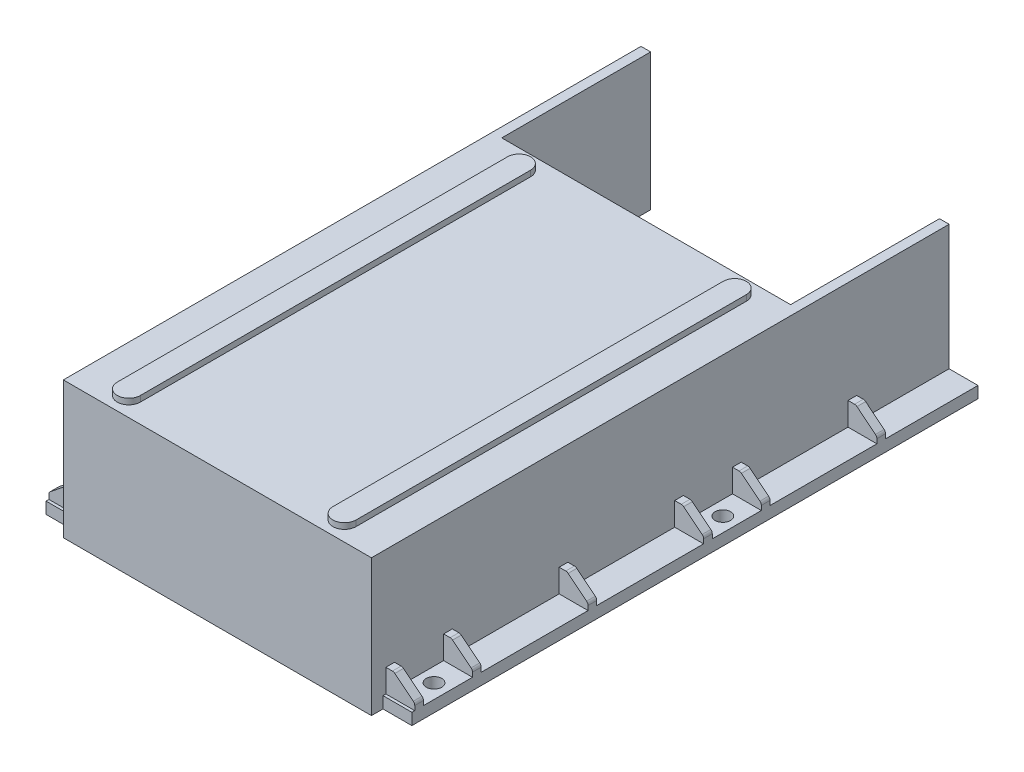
ISO-10303-21;
HEADER;
FILE_DESCRIPTION(('STEP AP214'),'2;1');
FILE_NAME('part.step','',(''),(''),'','','');
FILE_SCHEMA(('AUTOMOTIVE_DESIGN { 1 0 10303 214 1 1 1 1 }'));
ENDSEC;
DATA;
#1=APPLICATION_CONTEXT('core data for automotive mechanical design processes');
#2=APPLICATION_PROTOCOL_DEFINITION('international standard','automotive_design',2000,#1);
#3=PRODUCT_CONTEXT('',#1,'mechanical');
#4=PRODUCT('Part','Part','',(#3));
#5=PRODUCT_RELATED_PRODUCT_CATEGORY('part','',(#4));
#6=PRODUCT_DEFINITION_FORMATION('','',#4);
#7=PRODUCT_DEFINITION_CONTEXT('part definition',#1,'design');
#8=PRODUCT_DEFINITION('design','',#6,#7);
#9=PRODUCT_DEFINITION_SHAPE('','',#8);
#10=(LENGTH_UNIT() NAMED_UNIT(*) SI_UNIT(.MILLI.,.METRE.));
#11=(NAMED_UNIT(*) PLANE_ANGLE_UNIT() SI_UNIT($,.RADIAN.));
#12=(NAMED_UNIT(*) SI_UNIT($,.STERADIAN.) SOLID_ANGLE_UNIT());
#13=UNCERTAINTY_MEASURE_WITH_UNIT(LENGTH_MEASURE(1.E-05),#10,'distance_accuracy_value','');
#14=(GEOMETRIC_REPRESENTATION_CONTEXT(3) GLOBAL_UNCERTAINTY_ASSIGNED_CONTEXT((#13)) GLOBAL_UNIT_ASSIGNED_CONTEXT((#10,
#11,#12)) REPRESENTATION_CONTEXT('',''));
#15=CARTESIAN_POINT('',(0.,0.,0.));
#16=DIRECTION('',(0.,0.,1.));
#17=DIRECTION('',(1.,0.,0.));
#18=AXIS2_PLACEMENT_3D('',#15,#16,#17);
#19=CARTESIAN_POINT('',(-95.,5.99999999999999,300.));
#20=DIRECTION('',(0.,1.,0.));
#21=DIRECTION('',(-1.,0.,0.));
#22=AXIS2_PLACEMENT_3D('',#19,#20,#21);
#23=PLANE('',#22);
#24=DIRECTION('',(0.,0.,-1.));
#25=VECTOR('',#24,1.);
#26=CARTESIAN_POINT('',(-80.,5.99999999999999,300.));
#27=LINE('',#26,#25);
#28=CARTESIAN_POINT('',(-80.,5.99999999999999,294.));
#29=VERTEX_POINT('',#28);
#30=CARTESIAN_POINT('',(-80.,5.99999999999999,292.5));
#31=VERTEX_POINT('',#30);
#32=EDGE_CURVE('E1166',#29,#31,#27,.T.);
#33=ORIENTED_EDGE('',*,*,#32,.T.);
#34=DIRECTION('',(-1.,0.,0.));
#35=VECTOR('',#34,1.);
#36=CARTESIAN_POINT('',(-95.,5.99999999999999,292.5));
#37=LINE('',#36,#35);
#38=CARTESIAN_POINT('',(-95.,5.99999999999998,292.5));
#39=VERTEX_POINT('',#38);
#40=EDGE_CURVE('E56',#31,#39,#37,.T.);
#41=ORIENTED_EDGE('',*,*,#40,.T.);
#42=DIRECTION('',(0.,0.,-1.));
#43=VECTOR('',#42,1.);
#44=CARTESIAN_POINT('',(-95.,5.99999999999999,300.));
#45=LINE('',#44,#43);
#46=CARTESIAN_POINT('',(-95.,5.99999999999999,294.));
#47=VERTEX_POINT('',#46);
#48=EDGE_CURVE('E1161',#47,#39,#45,.T.);
#49=ORIENTED_EDGE('',*,*,#48,.F.);
#50=DIRECTION('',(1.,0.,0.));
#51=VECTOR('',#50,1.);
#52=CARTESIAN_POINT('',(-95.,5.99999999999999,294.));
#53=LINE('',#52,#51);
#54=EDGE_CURVE('E1130',#47,#29,#53,.T.);
#55=ORIENTED_EDGE('',*,*,#54,.T.);
#56=EDGE_LOOP('',(#33,#41,#49,#55));
#57=FACE_BOUND('',#56,.T.);
#58=ADVANCED_FACE('F31',(#57),#23,.T.);
#59=CARTESIAN_POINT('',(-87.5,5.99999999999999,275.));
#60=DIRECTION('',(0.,1.,0.));
#61=DIRECTION('',(0.,0.,1.));
#62=AXIS2_PLACEMENT_3D('',#59,#60,#61);
#63=CIRCLE('',#62,3.99999999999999);
#64=CARTESIAN_POINT('',(-87.5,5.99999999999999,279.));
#65=VERTEX_POINT('',#64);
#66=EDGE_CURVE('E1580',#65,#65,#63,.T.);
#67=ORIENTED_EDGE('',*,*,#66,.F.);
#68=EDGE_LOOP('',(#67));
#69=FACE_BOUND('',#68,.T.);
#70=DIRECTION('',(-1.,0.,0.));
#71=VECTOR('',#70,1.);
#72=CARTESIAN_POINT('',(-95.,5.99999999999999,288.));
#73=LINE('',#72,#71);
#74=CARTESIAN_POINT('',(-80.,5.99999999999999,288.));
#75=VERTEX_POINT('',#74);
#76=CARTESIAN_POINT('',(-95.,5.99999999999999,288.));
#77=VERTEX_POINT('',#76);
#78=EDGE_CURVE('E841',#75,#77,#73,.T.);
#79=ORIENTED_EDGE('',*,*,#78,.F.);
#80=CARTESIAN_POINT('',(-80.,5.99999999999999,262.5));
#81=VERTEX_POINT('',#80);
#82=EDGE_CURVE('E1170',#75,#81,#27,.T.);
#83=ORIENTED_EDGE('',*,*,#82,.T.);
#84=DIRECTION('',(-1.,0.,0.));
#85=VECTOR('',#84,1.);
#86=CARTESIAN_POINT('',(-95.,5.99999999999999,262.5));
#87=LINE('',#86,#85);
#88=CARTESIAN_POINT('',(-95.,5.99999999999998,262.5));
#89=VERTEX_POINT('',#88);
#90=EDGE_CURVE('E885',#81,#89,#87,.T.);
#91=ORIENTED_EDGE('',*,*,#90,.T.);
#92=EDGE_CURVE('E1165',#77,#89,#45,.T.);
#93=ORIENTED_EDGE('',*,*,#92,.F.);
#94=EDGE_LOOP('',(#79,#83,#91,#93));
#95=FACE_BOUND('',#94,.T.);
#96=ADVANCED_FACE('F1588',(#69,#95),#23,.T.);
#97=DIRECTION('',(-1.,0.,0.));
#98=VECTOR('',#97,1.);
#99=CARTESIAN_POINT('',(-95.,5.99999999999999,258.));
#100=LINE('',#99,#98);
#101=CARTESIAN_POINT('',(-80.,5.99999999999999,258.));
#102=VERTEX_POINT('',#101);
#103=CARTESIAN_POINT('',(-95.,5.99999999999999,258.));
#104=VERTEX_POINT('',#103);
#105=EDGE_CURVE('E890',#102,#104,#100,.T.);
#106=ORIENTED_EDGE('',*,*,#105,.F.);
#107=CARTESIAN_POINT('',(-80.,5.99999999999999,202.5));
#108=VERTEX_POINT('',#107);
#109=EDGE_CURVE('E1604',#102,#108,#27,.T.);
#110=ORIENTED_EDGE('',*,*,#109,.T.);
#111=DIRECTION('',(-1.,0.,0.));
#112=VECTOR('',#111,1.);
#113=CARTESIAN_POINT('',(-95.,5.99999999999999,202.5));
#114=LINE('',#113,#112);
#115=CARTESIAN_POINT('',(-95.,5.99999999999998,202.5));
#116=VERTEX_POINT('',#115);
#117=EDGE_CURVE('E934',#108,#116,#114,.T.);
#118=ORIENTED_EDGE('',*,*,#117,.T.);
#119=EDGE_CURVE('E1653',#104,#116,#45,.T.);
#120=ORIENTED_EDGE('',*,*,#119,.F.);
#121=EDGE_LOOP('',(#106,#110,#118,#120));
#122=FACE_BOUND('',#121,.T.);
#123=ADVANCED_FACE('F1591',(#122),#23,.T.);
#124=DIRECTION('',(-1.,0.,0.));
#125=VECTOR('',#124,1.);
#126=CARTESIAN_POINT('',(-95.,5.99999999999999,198.));
#127=LINE('',#126,#125);
#128=CARTESIAN_POINT('',(-80.,5.99999999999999,198.));
#129=VERTEX_POINT('',#128);
#130=CARTESIAN_POINT('',(-95.,5.99999999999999,198.));
#131=VERTEX_POINT('',#130);
#132=EDGE_CURVE('E939',#129,#131,#127,.T.);
#133=ORIENTED_EDGE('',*,*,#132,.F.);
#134=CARTESIAN_POINT('',(-80.,5.99999999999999,142.5));
#135=VERTEX_POINT('',#134);
#136=EDGE_CURVE('E1605',#129,#135,#27,.T.);
#137=ORIENTED_EDGE('',*,*,#136,.T.);
#138=DIRECTION('',(-1.,0.,0.));
#139=VECTOR('',#138,1.);
#140=CARTESIAN_POINT('',(-95.,5.99999999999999,142.5));
#141=LINE('',#140,#139);
#142=CARTESIAN_POINT('',(-95.,5.99999999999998,142.5));
#143=VERTEX_POINT('',#142);
#144=EDGE_CURVE('E983',#135,#143,#141,.T.);
#145=ORIENTED_EDGE('',*,*,#144,.T.);
#146=EDGE_CURVE('E1649',#131,#143,#45,.T.);
#147=ORIENTED_EDGE('',*,*,#146,.F.);
#148=EDGE_LOOP('',(#133,#137,#145,#147));
#149=FACE_BOUND('',#148,.T.);
#150=ADVANCED_FACE('F1695',(#149),#23,.T.);
#151=CARTESIAN_POINT('',(-87.5,5.99999999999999,125.));
#152=DIRECTION('',(0.,1.,0.));
#153=DIRECTION('',(0.,0.,1.));
#154=AXIS2_PLACEMENT_3D('',#151,#152,#153);
#155=CIRCLE('',#154,3.99999999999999);
#156=CARTESIAN_POINT('',(-87.5,5.99999999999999,129.));
#157=VERTEX_POINT('',#156);
#158=EDGE_CURVE('E1573',#157,#157,#155,.T.);
#159=ORIENTED_EDGE('',*,*,#158,.F.);
#160=EDGE_LOOP('',(#159));
#161=FACE_BOUND('',#160,.T.);
#162=DIRECTION('',(-1.,0.,0.));
#163=VECTOR('',#162,1.);
#164=CARTESIAN_POINT('',(-95.,5.99999999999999,138.));
#165=LINE('',#164,#163);
#166=CARTESIAN_POINT('',(-80.,5.99999999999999,138.));
#167=VERTEX_POINT('',#166);
#168=CARTESIAN_POINT('',(-95.,5.99999999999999,138.));
#169=VERTEX_POINT('',#168);
#170=EDGE_CURVE('E988',#167,#169,#165,.T.);
#171=ORIENTED_EDGE('',*,*,#170,.F.);
#172=CARTESIAN_POINT('',(-80.,5.99999999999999,112.5));
#173=VERTEX_POINT('',#172);
#174=EDGE_CURVE('E1610',#167,#173,#27,.T.);
#175=ORIENTED_EDGE('',*,*,#174,.T.);
#176=DIRECTION('',(-1.,0.,0.));
#177=VECTOR('',#176,1.);
#178=CARTESIAN_POINT('',(-95.,5.99999999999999,112.5));
#179=LINE('',#178,#177);
#180=CARTESIAN_POINT('',(-95.,5.99999999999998,112.5));
#181=VERTEX_POINT('',#180);
#182=EDGE_CURVE('E1032',#173,#181,#179,.T.);
#183=ORIENTED_EDGE('',*,*,#182,.T.);
#184=EDGE_CURVE('E1645',#169,#181,#45,.T.);
#185=ORIENTED_EDGE('',*,*,#184,.F.);
#186=EDGE_LOOP('',(#171,#175,#183,#185));
#187=FACE_BOUND('',#186,.T.);
#188=ADVANCED_FACE('F1719',(#161,#187),#23,.T.);
#189=DIRECTION('',(-1.,0.,0.));
#190=VECTOR('',#189,1.);
#191=CARTESIAN_POINT('',(-95.,5.99999999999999,108.));
#192=LINE('',#191,#190);
#193=CARTESIAN_POINT('',(-80.,5.99999999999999,108.));
#194=VERTEX_POINT('',#193);
#195=CARTESIAN_POINT('',(-95.,5.99999999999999,108.));
#196=VERTEX_POINT('',#195);
#197=EDGE_CURVE('E1037',#194,#196,#192,.T.);
#198=ORIENTED_EDGE('',*,*,#197,.F.);
#199=CARTESIAN_POINT('',(-80.,5.99999999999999,52.5));
#200=VERTEX_POINT('',#199);
#201=EDGE_CURVE('E1615',#194,#200,#27,.T.);
#202=ORIENTED_EDGE('',*,*,#201,.T.);
#203=DIRECTION('',(-1.,0.,0.));
#204=VECTOR('',#203,1.);
#205=CARTESIAN_POINT('',(-95.,5.99999999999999,52.5));
#206=LINE('',#205,#204);
#207=CARTESIAN_POINT('',(-95.,5.99999999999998,52.5));
#208=VERTEX_POINT('',#207);
#209=EDGE_CURVE('E1078',#200,#208,#206,.T.);
#210=ORIENTED_EDGE('',*,*,#209,.T.);
#211=EDGE_CURVE('E1644',#196,#208,#45,.T.);
#212=ORIENTED_EDGE('',*,*,#211,.F.);
#213=EDGE_LOOP('',(#198,#202,#210,#212));
#214=FACE_BOUND('',#213,.T.);
#215=ADVANCED_FACE('F1743',(#214),#23,.T.);
#216=CARTESIAN_POINT('',(0.,0.,77.3295668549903));
#217=DIRECTION('',(0.,0.,1.));
#218=DIRECTION('',(1.,0.,0.));
#219=AXIS2_PLACEMENT_3D('',#216,#217,#218);
#220=PLANE('',#219);
#221=DIRECTION('',(0.,-1.,0.));
#222=VECTOR('',#221,1.);
#223=CARTESIAN_POINT('',(-57.,28.,77.3295668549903));
#224=LINE('',#223,#222);
#225=CARTESIAN_POINT('',(-57.,28.,77.3295668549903));
#226=VERTEX_POINT('',#225);
#227=CARTESIAN_POINT('',(-57.,0.,77.3295668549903));
#228=VERTEX_POINT('',#227);
#229=EDGE_CURVE('E1100',#226,#228,#224,.T.);
#230=ORIENTED_EDGE('',*,*,#229,.F.);
#231=DIRECTION('',(1.,0.,0.));
#232=VECTOR('',#231,1.);
#233=CARTESIAN_POINT('',(-57.,28.,77.3295668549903));
#234=LINE('',#233,#232);
#235=CARTESIAN_POINT('',(-62.,28.,77.3295668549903));
#236=VERTEX_POINT('',#235);
#237=EDGE_CURVE('E1084',#236,#226,#234,.T.);
#238=ORIENTED_EDGE('',*,*,#237,.F.);
#239=DIRECTION('',(0.,-1.,0.));
#240=VECTOR('',#239,1.);
#241=CARTESIAN_POINT('',(-62.,28.,77.3295668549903));
#242=LINE('',#241,#240);
#243=CARTESIAN_POINT('',(-62.,0.,77.3295668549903));
#244=VERTEX_POINT('',#243);
#245=EDGE_CURVE('E1096',#236,#244,#242,.T.);
#246=ORIENTED_EDGE('',*,*,#245,.T.);
#247=DIRECTION('',(1.,0.,0.));
#248=VECTOR('',#247,1.);
#249=CARTESIAN_POINT('',(0.,0.,77.3295668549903));
#250=LINE('',#249,#248);
#251=CARTESIAN_POINT('',(-75.,0.,77.3295668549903));
#252=VERTEX_POINT('',#251);
#253=EDGE_CURVE('E1562',#252,#244,#250,.T.);
#254=ORIENTED_EDGE('',*,*,#253,.F.);
#255=DIRECTION('',(0.,1.,0.));
#256=VECTOR('',#255,1.);
#257=CARTESIAN_POINT('',(-75.,-5.00000000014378E-05,77.3295668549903));
#258=LINE('',#257,#256);
#259=CARTESIAN_POINT('',(-75.,71.,77.3295668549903));
#260=VERTEX_POINT('',#259);
#261=EDGE_CURVE('E1124',#252,#260,#258,.T.);
#262=ORIENTED_EDGE('',*,*,#261,.T.);
#263=DIRECTION('',(1.,0.,0.));
#264=VECTOR('',#263,1.);
#265=CARTESIAN_POINT('',(0.,71.,77.3295668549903));
#266=LINE('',#265,#264);
#267=CARTESIAN_POINT('',(75.,71.,77.3295668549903));
#268=VERTEX_POINT('',#267);
#269=EDGE_CURVE('E1551',#260,#268,#266,.T.);
#270=ORIENTED_EDGE('',*,*,#269,.T.);
#271=DIRECTION('',(0.,1.,0.));
#272=VECTOR('',#271,1.);
#273=CARTESIAN_POINT('',(75.,0.,77.3295668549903));
#274=LINE('',#273,#272);
#275=CARTESIAN_POINT('',(75.,0.,77.3295668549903));
#276=VERTEX_POINT('',#275);
#277=EDGE_CURVE('E3002',#276,#268,#274,.T.);
#278=ORIENTED_EDGE('',*,*,#277,.F.);
#279=CARTESIAN_POINT('',(62.,0.,77.3295668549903));
#280=VERTEX_POINT('',#279);
#281=EDGE_CURVE('E1553',#280,#276,#250,.T.);
#282=ORIENTED_EDGE('',*,*,#281,.F.);
#283=DIRECTION('',(0.,-1.,0.));
#284=VECTOR('',#283,1.);
#285=CARTESIAN_POINT('',(62.,28.,77.3295668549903));
#286=LINE('',#285,#284);
#287=CARTESIAN_POINT('',(62.,28.,77.3295668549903));
#288=VERTEX_POINT('',#287);
#289=EDGE_CURVE('E1524',#288,#280,#286,.T.);
#290=ORIENTED_EDGE('',*,*,#289,.F.);
#291=DIRECTION('',(-1.,0.,0.));
#292=VECTOR('',#291,1.);
#293=CARTESIAN_POINT('',(57.,28.,77.3295668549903));
#294=LINE('',#293,#292);
#295=CARTESIAN_POINT('',(57.,28.,77.3295668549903));
#296=VERTEX_POINT('',#295);
#297=EDGE_CURVE('E1508',#288,#296,#294,.T.);
#298=ORIENTED_EDGE('',*,*,#297,.T.);
#299=DIRECTION('',(0.,-1.,0.));
#300=VECTOR('',#299,1.);
#301=CARTESIAN_POINT('',(57.,28.,77.3295668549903));
#302=LINE('',#301,#300);
#303=CARTESIAN_POINT('',(57.,0.,77.3295668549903));
#304=VERTEX_POINT('',#303);
#305=EDGE_CURVE('E1521',#296,#304,#302,.T.);
#306=ORIENTED_EDGE('',*,*,#305,.T.);
#307=EDGE_CURVE('E1556',#228,#304,#250,.T.);
#308=ORIENTED_EDGE('',*,*,#307,.F.);
#309=EDGE_LOOP('',(#230,#238,#246,#254,#262,#270,#278,#282,#290,#298,#306,#308));
#310=FACE_BOUND('',#309,.T.);
#311=ADVANCED_FACE('F1793',(#310),#220,.F.);
#312=CARTESIAN_POINT('',(-75.,-5.00000000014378E-05,0.));
#313=DIRECTION('',(1.,0.,0.));
#314=DIRECTION('',(0.,0.,-1.));
#315=AXIS2_PLACEMENT_3D('',#312,#313,#314);
#316=PLANE('',#315);
#317=DIRECTION('',(0.,0.,-1.));
#318=VECTOR('',#317,1.);
#319=CARTESIAN_POINT('',(-75.0000000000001,0.,300.));
#320=LINE('',#319,#318);
#321=CARTESIAN_POINT('',(-75.,0.,57.3295668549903));
#322=VERTEX_POINT('',#321);
#323=CARTESIAN_POINT('',(-75.,0.,0.));
#324=VERTEX_POINT('',#323);
#325=EDGE_CURVE('E1127',#322,#324,#320,.T.);
#326=ORIENTED_EDGE('',*,*,#325,.T.);
#327=DIRECTION('',(0.,1.,0.));
#328=VECTOR('',#327,1.);
#329=CARTESIAN_POINT('',(-75.,5.99999999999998,0.));
#330=LINE('',#329,#328);
#331=CARTESIAN_POINT('',(-75.,71.,0.));
#332=VERTEX_POINT('',#331);
#333=EDGE_CURVE('E1568',#324,#332,#330,.T.);
#334=ORIENTED_EDGE('',*,*,#333,.T.);
#335=DIRECTION('',(0.,0.,-1.));
#336=VECTOR('',#335,1.);
#337=CARTESIAN_POINT('',(-75.,71.,0.));
#338=LINE('',#337,#336);
#339=EDGE_CURVE('E1119',#260,#332,#338,.T.);
#340=ORIENTED_EDGE('',*,*,#339,.F.);
#341=ORIENTED_EDGE('',*,*,#261,.F.);
#342=CARTESIAN_POINT('',(-75.,0.,62.3295668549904));
#343=VERTEX_POINT('',#342);
#344=EDGE_CURVE('E1128',#252,#343,#320,.T.);
#345=ORIENTED_EDGE('',*,*,#344,.T.);
#346=DIRECTION('',(0.,-1.,0.));
#347=VECTOR('',#346,1.);
#348=CARTESIAN_POINT('',(-75.,28.,62.3295668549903));
#349=LINE('',#348,#347);
#350=CARTESIAN_POINT('',(-75.,28.,62.3295668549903));
#351=VERTEX_POINT('',#350);
#352=EDGE_CURVE('E1106',#351,#343,#349,.T.);
#353=ORIENTED_EDGE('',*,*,#352,.F.);
#354=DIRECTION('',(0.,0.,1.));
#355=VECTOR('',#354,1.);
#356=CARTESIAN_POINT('',(-75.,28.,62.3295668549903));
#357=LINE('',#356,#355);
#358=CARTESIAN_POINT('',(-75.,28.,57.3295668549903));
#359=VERTEX_POINT('',#358);
#360=EDGE_CURVE('E1090',#359,#351,#357,.T.);
#361=ORIENTED_EDGE('',*,*,#360,.F.);
#362=DIRECTION('',(0.,-1.,0.));
#363=VECTOR('',#362,1.);
#364=CARTESIAN_POINT('',(-75.,28.,57.3295668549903));
#365=LINE('',#364,#363);
#366=EDGE_CURVE('E1103',#359,#322,#365,.T.);
#367=ORIENTED_EDGE('',*,*,#366,.T.);
#368=EDGE_LOOP('',(#326,#334,#340,#341,#345,#353,#361,#367));
#369=FACE_BOUND('',#368,.T.);
#370=ADVANCED_FACE('F1798',(#369),#316,.T.);
#371=CARTESIAN_POINT('',(0.,0.,300.));
#372=DIRECTION('',(0.,1.,0.));
#373=DIRECTION('',(0.,0.,1.));
#374=AXIS2_PLACEMENT_3D('',#371,#372,#373);
#375=PLANE('',#374);
#376=CARTESIAN_POINT('',(-87.5,0.,275.));
#377=DIRECTION('',(0.,1.,0.));
#378=DIRECTION('',(0.,0.,1.));
#379=AXIS2_PLACEMENT_3D('',#376,#377,#378);
#380=CIRCLE('',#379,3.99999999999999);
#381=CARTESIAN_POINT('',(-87.5,0.,279.));
#382=VERTEX_POINT('',#381);
#383=EDGE_CURVE('E35',#382,#382,#380,.T.);
#384=ORIENTED_EDGE('',*,*,#383,.T.);
#385=EDGE_LOOP('',(#384));
#386=FACE_BOUND('',#385,.T.);
#387=CARTESIAN_POINT('',(-87.5,0.,125.));
#388=DIRECTION('',(0.,1.,0.));
#389=DIRECTION('',(0.,0.,1.));
#390=AXIS2_PLACEMENT_3D('',#387,#388,#389);
#391=CIRCLE('',#390,3.99999999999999);
#392=CARTESIAN_POINT('',(-87.5,0.,129.));
#393=VERTEX_POINT('',#392);
#394=EDGE_CURVE('E791',#393,#393,#391,.T.);
#395=ORIENTED_EDGE('',*,*,#394,.T.);
#396=EDGE_LOOP('',(#395));
#397=FACE_BOUND('',#396,.T.);
#398=DIRECTION('',(-1.,0.,0.));
#399=VECTOR('',#398,1.);
#400=CARTESIAN_POINT('',(0.,0.,297.));
#401=LINE('',#400,#399);
#402=CARTESIAN_POINT('',(77.,0.,297.));
#403=VERTEX_POINT('',#402);
#404=CARTESIAN_POINT('',(-77.,0.,297.));
#405=VERTEX_POINT('',#404);
#406=EDGE_CURVE('E1540',#403,#405,#401,.T.);
#407=ORIENTED_EDGE('',*,*,#406,.F.);
#408=DIRECTION('',(0.,0.,1.));
#409=VECTOR('',#408,1.);
#410=CARTESIAN_POINT('',(77.,0.,297.));
#411=LINE('',#410,#409);
#412=CARTESIAN_POINT('',(77.,0.,80.3295668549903));
#413=VERTEX_POINT('',#412);
#414=EDGE_CURVE('E1546',#413,#403,#411,.T.);
#415=ORIENTED_EDGE('',*,*,#414,.F.);
#416=DIRECTION('',(1.,0.,0.));
#417=VECTOR('',#416,1.);
#418=CARTESIAN_POINT('',(0.,0.,80.3295668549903));
#419=LINE('',#418,#417);
#420=CARTESIAN_POINT('',(-77.,0.,80.3295668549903));
#421=VERTEX_POINT('',#420);
#422=EDGE_CURVE('E1527',#421,#413,#419,.T.);
#423=ORIENTED_EDGE('',*,*,#422,.F.);
#424=DIRECTION('',(0.,0.,1.));
#425=VECTOR('',#424,1.);
#426=CARTESIAN_POINT('',(-77.,0.,297.));
#427=LINE('',#426,#425);
#428=EDGE_CURVE('E1102',#421,#405,#427,.T.);
#429=ORIENTED_EDGE('',*,*,#428,.T.);
#430=EDGE_LOOP('',(#407,#415,#423,#429));
#431=FACE_BOUND('',#430,.T.);
#432=DIRECTION('',(1.,0.,0.));
#433=VECTOR('',#432,1.);
#434=CARTESIAN_POINT('',(0.,0.,0.));
#435=LINE('',#434,#433);
#436=CARTESIAN_POINT('',(75.,0.,0.));
#437=VERTEX_POINT('',#436);
#438=CARTESIAN_POINT('',(95.,0.,0.));
#439=VERTEX_POINT('',#438);
#440=EDGE_CURVE('E3013',#437,#439,#435,.T.);
#441=ORIENTED_EDGE('',*,*,#440,.T.);
#442=DIRECTION('',(0.,0.,-1.));
#443=VECTOR('',#442,1.);
#444=CARTESIAN_POINT('',(95.,0.,300.));
#445=LINE('',#444,#443);
#446=CARTESIAN_POINT('',(95.,0.,294.));
#447=VERTEX_POINT('',#446);
#448=EDGE_CURVE('E2891',#447,#439,#445,.T.);
#449=ORIENTED_EDGE('',*,*,#448,.F.);
#450=DIRECTION('',(-1.,0.,0.));
#451=VECTOR('',#450,1.);
#452=CARTESIAN_POINT('',(0.,0.,294.));
#453=LINE('',#452,#451);
#454=CARTESIAN_POINT('',(80.,0.,294.));
#455=VERTEX_POINT('',#454);
#456=EDGE_CURVE('E3010',#447,#455,#453,.T.);
#457=ORIENTED_EDGE('',*,*,#456,.T.);
#458=DIRECTION('',(0.,0.,1.));
#459=VECTOR('',#458,1.);
#460=CARTESIAN_POINT('',(80.,0.,300.));
#461=LINE('',#460,#459);
#462=CARTESIAN_POINT('',(80.,0.,300.));
#463=VERTEX_POINT('',#462);
#464=EDGE_CURVE('E3006',#455,#463,#461,.T.);
#465=ORIENTED_EDGE('',*,*,#464,.T.);
#466=DIRECTION('',(1.,0.,0.));
#467=VECTOR('',#466,1.);
#468=CARTESIAN_POINT('',(0.,0.,300.));
#469=LINE('',#468,#467);
#470=CARTESIAN_POINT('',(-80.,0.,300.));
#471=VERTEX_POINT('',#470);
#472=EDGE_CURVE('E3014',#471,#463,#469,.T.);
#473=ORIENTED_EDGE('',*,*,#472,.F.);
#474=DIRECTION('',(0.,0.,1.));
#475=VECTOR('',#474,1.);
#476=CARTESIAN_POINT('',(-80.,0.,300.));
#477=LINE('',#476,#475);
#478=CARTESIAN_POINT('',(-80.,0.,294.));
#479=VERTEX_POINT('',#478);
#480=EDGE_CURVE('E1137',#479,#471,#477,.T.);
#481=ORIENTED_EDGE('',*,*,#480,.F.);
#482=DIRECTION('',(1.,0.,0.));
#483=VECTOR('',#482,1.);
#484=CARTESIAN_POINT('',(0.,0.,294.));
#485=LINE('',#484,#483);
#486=CARTESIAN_POINT('',(-95.,0.,294.));
#487=VERTEX_POINT('',#486);
#488=EDGE_CURVE('E1135',#487,#479,#485,.T.);
#489=ORIENTED_EDGE('',*,*,#488,.F.);
#490=DIRECTION('',(0.,0.,-1.));
#491=VECTOR('',#490,1.);
#492=CARTESIAN_POINT('',(-95.,0.,300.));
#493=LINE('',#492,#491);
#494=CARTESIAN_POINT('',(-95.,0.,0.));
#495=VERTEX_POINT('',#494);
#496=EDGE_CURVE('E1144',#487,#495,#493,.T.);
#497=ORIENTED_EDGE('',*,*,#496,.T.);
#498=DIRECTION('',(-1.,0.,0.));
#499=VECTOR('',#498,1.);
#500=CARTESIAN_POINT('',(0.,0.,0.));
#501=LINE('',#500,#499);
#502=EDGE_CURVE('E1145',#324,#495,#501,.T.);
#503=ORIENTED_EDGE('',*,*,#502,.F.);
#504=ORIENTED_EDGE('',*,*,#325,.F.);
#505=DIRECTION('',(-0.66896473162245,0.,-0.743294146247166));
#506=VECTOR('',#505,1.);
#507=CARTESIAN_POINT('',(-57.,0.,77.3295668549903));
#508=LINE('',#507,#506);
#509=EDGE_CURVE('E1088',#228,#322,#508,.T.);
#510=ORIENTED_EDGE('',*,*,#509,.F.);
#511=ORIENTED_EDGE('',*,*,#307,.T.);
#512=DIRECTION('',(0.66896473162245,0.,-0.743294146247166));
#513=VECTOR('',#512,1.);
#514=CARTESIAN_POINT('',(57.,0.,77.3295668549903));
#515=LINE('',#514,#513);
#516=CARTESIAN_POINT('',(75.,0.,57.3295668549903));
#517=VERTEX_POINT('',#516);
#518=EDGE_CURVE('E1507',#304,#517,#515,.T.);
#519=ORIENTED_EDGE('',*,*,#518,.T.);
#520=DIRECTION('',(0.,0.,-1.));
#521=VECTOR('',#520,1.);
#522=CARTESIAN_POINT('',(75.,0.,0.));
#523=LINE('',#522,#521);
#524=EDGE_CURVE('E2876',#517,#437,#523,.T.);
#525=ORIENTED_EDGE('',*,*,#524,.T.);
#526=EDGE_LOOP('',(#441,#449,#457,#465,#473,#481,#489,#497,#503,#504,#510,#511,#519,#525));
#527=FACE_BOUND('',#526,.T.);
#528=ORIENTED_EDGE('',*,*,#344,.F.);
#529=ORIENTED_EDGE('',*,*,#253,.T.);
#530=DIRECTION('',(0.654930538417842,0.,0.755689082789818));
#531=VECTOR('',#530,1.);
#532=CARTESIAN_POINT('',(-62.,0.,77.3295668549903));
#533=LINE('',#532,#531);
#534=EDGE_CURVE('E1083',#343,#244,#533,.T.);
#535=ORIENTED_EDGE('',*,*,#534,.F.);
#536=EDGE_LOOP('',(#528,#529,#535));
#537=FACE_BOUND('',#536,.T.);
#538=CARTESIAN_POINT('',(75.,0.,62.3295668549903));
#539=VERTEX_POINT('',#538);
#540=EDGE_CURVE('E1558',#276,#539,#523,.T.);
#541=ORIENTED_EDGE('',*,*,#540,.T.);
#542=DIRECTION('',(-0.654930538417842,0.,0.755689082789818));
#543=VECTOR('',#542,1.);
#544=CARTESIAN_POINT('',(62.,0.,77.3295668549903));
#545=LINE('',#544,#543);
#546=EDGE_CURVE('E1512',#539,#280,#545,.T.);
#547=ORIENTED_EDGE('',*,*,#546,.T.);
#548=ORIENTED_EDGE('',*,*,#281,.T.);
#549=EDGE_LOOP('',(#541,#547,#548));
#550=FACE_BOUND('',#549,.T.);
#551=CARTESIAN_POINT('',(87.5,0.,125.));
#552=DIRECTION('',(0.,1.,0.));
#553=DIRECTION('',(0.,0.,1.));
#554=AXIS2_PLACEMENT_3D('',#551,#552,#553);
#555=CIRCLE('',#554,3.99999999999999);
#556=CARTESIAN_POINT('',(87.5,0.,129.));
#557=VERTEX_POINT('',#556);
#558=EDGE_CURVE('E1179',#557,#557,#555,.T.);
#559=ORIENTED_EDGE('',*,*,#558,.T.);
#560=EDGE_LOOP('',(#559));
#561=FACE_BOUND('',#560,.T.);
#562=CARTESIAN_POINT('',(87.5,0.,275.));
#563=DIRECTION('',(0.,1.,0.));
#564=DIRECTION('',(0.,0.,1.));
#565=AXIS2_PLACEMENT_3D('',#562,#563,#564);
#566=CIRCLE('',#565,3.99999999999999);
#567=CARTESIAN_POINT('',(87.5,0.,279.));
#568=VERTEX_POINT('',#567);
#569=EDGE_CURVE('E1175',#568,#568,#566,.T.);
#570=ORIENTED_EDGE('',*,*,#569,.T.);
#571=EDGE_LOOP('',(#570));
#572=FACE_BOUND('',#571,.T.);
#573=ADVANCED_FACE('F33',(#386,#397,#431,#527,#537,#550,#561,#572),#375,.F.);
#574=CARTESIAN_POINT('',(80.,71.,300.));
#575=DIRECTION('',(0.,-1.,0.));
#576=DIRECTION('',(0.,0.,-1.));
#577=AXIS2_PLACEMENT_3D('',#574,#575,#576);
#578=PLANE('',#577);
#579=DIRECTION('',(0.,0.,-1.));
#580=VECTOR('',#579,1.);
#581=CARTESIAN_POINT('',(-62.,71.,87.3295668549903));
#582=LINE('',#581,#580);
#583=CARTESIAN_POINT('',(-62.,71.,290.));
#584=VERTEX_POINT('',#583);
#585=CARTESIAN_POINT('',(-62.,71.,87.3295668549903));
#586=VERTEX_POINT('',#585);
#587=EDGE_CURVE('E790',#584,#586,#582,.T.);
#588=ORIENTED_EDGE('',*,*,#587,.T.);
#589=CARTESIAN_POINT('',(-56.,71.,87.3295668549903));
#590=DIRECTION('',(0.,-1.,0.));
#591=DIRECTION('',(0.,0.,-1.));
#592=AXIS2_PLACEMENT_3D('',#589,#590,#591);
#593=CIRCLE('',#592,6.);
#594=CARTESIAN_POINT('',(-50.,71.,87.3295668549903));
#595=VERTEX_POINT('',#594);
#596=EDGE_CURVE('E763',#586,#595,#593,.T.);
#597=ORIENTED_EDGE('',*,*,#596,.T.);
#598=DIRECTION('',(0.,0.,1.));
#599=VECTOR('',#598,1.);
#600=CARTESIAN_POINT('',(-50.,71.,87.3295668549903));
#601=LINE('',#600,#599);
#602=CARTESIAN_POINT('',(-50.,71.,290.));
#603=VERTEX_POINT('',#602);
#604=EDGE_CURVE('E779',#595,#603,#601,.T.);
#605=ORIENTED_EDGE('',*,*,#604,.T.);
#606=CARTESIAN_POINT('',(-56.,71.,290.));
#607=DIRECTION('',(0.,-1.,0.));
#608=DIRECTION('',(0.,0.,1.));
#609=AXIS2_PLACEMENT_3D('',#606,#607,#608);
#610=CIRCLE('',#609,6.);
#611=EDGE_CURVE('E48',#603,#584,#610,.T.);
#612=ORIENTED_EDGE('',*,*,#611,.T.);
#613=EDGE_LOOP('',(#588,#597,#605,#612));
#614=FACE_BOUND('',#613,.T.);
#615=CARTESIAN_POINT('',(56.,71.,87.3295668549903));
#616=DIRECTION('',(0.,1.,0.));
#617=DIRECTION('',(0.,0.,-1.));
#618=AXIS2_PLACEMENT_3D('',#615,#616,#617);
#619=CIRCLE('',#618,6.);
#620=CARTESIAN_POINT('',(62.,71.,87.3295668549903));
#621=VERTEX_POINT('',#620);
#622=CARTESIAN_POINT('',(50.,71.,87.3295668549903));
#623=VERTEX_POINT('',#622);
#624=EDGE_CURVE('E1191',#621,#623,#619,.T.);
#625=ORIENTED_EDGE('',*,*,#624,.F.);
#626=DIRECTION('',(0.,0.,-1.));
#627=VECTOR('',#626,1.);
#628=CARTESIAN_POINT('',(62.,71.,87.3295668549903));
#629=LINE('',#628,#627);
#630=CARTESIAN_POINT('',(62.,71.,290.));
#631=VERTEX_POINT('',#630);
#632=EDGE_CURVE('E1184',#631,#621,#629,.T.);
#633=ORIENTED_EDGE('',*,*,#632,.F.);
#634=CARTESIAN_POINT('',(56.,71.,290.));
#635=DIRECTION('',(0.,1.,0.));
#636=DIRECTION('',(0.,0.,1.));
#637=AXIS2_PLACEMENT_3D('',#634,#635,#636);
#638=CIRCLE('',#637,6.);
#639=CARTESIAN_POINT('',(50.,71.,290.));
#640=VERTEX_POINT('',#639);
#641=EDGE_CURVE('E1197',#640,#631,#638,.T.);
#642=ORIENTED_EDGE('',*,*,#641,.F.);
#643=DIRECTION('',(0.,0.,1.));
#644=VECTOR('',#643,1.);
#645=CARTESIAN_POINT('',(50.,71.,87.3295668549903));
#646=LINE('',#645,#644);
#647=EDGE_CURVE('E1194',#623,#640,#646,.T.);
#648=ORIENTED_EDGE('',*,*,#647,.F.);
#649=EDGE_LOOP('',(#625,#633,#642,#648));
#650=FACE_BOUND('',#649,.T.);
#651=ORIENTED_EDGE('',*,*,#269,.F.);
#652=ORIENTED_EDGE('',*,*,#339,.T.);
#653=DIRECTION('',(1.,0.,0.));
#654=VECTOR('',#653,1.);
#655=CARTESIAN_POINT('',(-80.,71.,0.));
#656=LINE('',#655,#654);
#657=CARTESIAN_POINT('',(-80.,71.,0.));
#658=VERTEX_POINT('',#657);
#659=EDGE_CURVE('E1140',#658,#332,#656,.T.);
#660=ORIENTED_EDGE('',*,*,#659,.F.);
#661=DIRECTION('',(0.,0.,-1.));
#662=VECTOR('',#661,1.);
#663=CARTESIAN_POINT('',(-80.,71.,300.));
#664=LINE('',#663,#662);
#665=CARTESIAN_POINT('',(-80.,71.,300.));
#666=VERTEX_POINT('',#665);
#667=EDGE_CURVE('E1169',#666,#658,#664,.T.);
#668=ORIENTED_EDGE('',*,*,#667,.F.);
#669=DIRECTION('',(-1.,0.,0.));
#670=VECTOR('',#669,1.);
#671=CARTESIAN_POINT('',(80.,71.,300.));
#672=LINE('',#671,#670);
#673=CARTESIAN_POINT('',(80.,71.,300.));
#674=VERTEX_POINT('',#673);
#675=EDGE_CURVE('E3019',#674,#666,#672,.T.);
#676=ORIENTED_EDGE('',*,*,#675,.F.);
#677=DIRECTION('',(0.,0.,-1.));
#678=VECTOR('',#677,1.);
#679=CARTESIAN_POINT('',(80.,71.,300.));
#680=LINE('',#679,#678);
#681=CARTESIAN_POINT('',(80.,71.,0.));
#682=VERTEX_POINT('',#681);
#683=EDGE_CURVE('E3021',#674,#682,#680,.T.);
#684=ORIENTED_EDGE('',*,*,#683,.T.);
#685=DIRECTION('',(-1.,0.,0.));
#686=VECTOR('',#685,1.);
#687=CARTESIAN_POINT('',(80.,71.,0.));
#688=LINE('',#687,#686);
#689=CARTESIAN_POINT('',(75.,71.,0.));
#690=VERTEX_POINT('',#689);
#691=EDGE_CURVE('E3017',#682,#690,#688,.T.);
#692=ORIENTED_EDGE('',*,*,#691,.T.);
#693=DIRECTION('',(0.,0.,-1.));
#694=VECTOR('',#693,1.);
#695=CARTESIAN_POINT('',(75.,71.,0.));
#696=LINE('',#695,#694);
#697=EDGE_CURVE('E1557',#268,#690,#696,.T.);
#698=ORIENTED_EDGE('',*,*,#697,.F.);
#699=EDGE_LOOP('',(#651,#652,#660,#668,#676,#684,#692,#698));
#700=FACE_BOUND('',#699,.T.);
#701=ADVANCED_FACE('F2857',(#614,#650,#700),#578,.F.);
#702=CARTESIAN_POINT('',(0.,5.99999999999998,0.));
#703=DIRECTION('',(0.,0.,1.));
#704=DIRECTION('',(-1.,0.,0.));
#705=AXIS2_PLACEMENT_3D('',#702,#703,#704);
#706=PLANE('',#705);
#707=ORIENTED_EDGE('',*,*,#333,.F.);
#708=ORIENTED_EDGE('',*,*,#502,.T.);
#709=DIRECTION('',(0.,1.,0.));
#710=VECTOR('',#709,1.);
#711=CARTESIAN_POINT('',(-95.,0.,0.));
#712=LINE('',#711,#710);
#713=CARTESIAN_POINT('',(-95.,5.99999999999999,0.));
#714=VERTEX_POINT('',#713);
#715=EDGE_CURVE('E1154',#495,#714,#712,.T.);
#716=ORIENTED_EDGE('',*,*,#715,.T.);
#717=DIRECTION('',(1.,0.,0.));
#718=VECTOR('',#717,1.);
#719=CARTESIAN_POINT('',(-95.,5.99999999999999,0.));
#720=LINE('',#719,#718);
#721=CARTESIAN_POINT('',(-80.,5.99999999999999,0.));
#722=VERTEX_POINT('',#721);
#723=EDGE_CURVE('E1151',#714,#722,#720,.T.);
#724=ORIENTED_EDGE('',*,*,#723,.T.);
#725=DIRECTION('',(0.,1.,0.));
#726=VECTOR('',#725,1.);
#727=CARTESIAN_POINT('',(-80.,5.99999999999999,0.));
#728=LINE('',#727,#726);
#729=EDGE_CURVE('E1148',#722,#658,#728,.T.);
#730=ORIENTED_EDGE('',*,*,#729,.T.);
#731=ORIENTED_EDGE('',*,*,#659,.T.);
#732=EDGE_LOOP('',(#707,#708,#716,#724,#730,#731));
#733=FACE_BOUND('',#732,.T.);
#734=ADVANCED_FACE('F1636',(#733),#706,.F.);
#735=CARTESIAN_POINT('',(0.,5.99999999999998,300.));
#736=DIRECTION('',(0.,0.,1.));
#737=DIRECTION('',(1.,0.,0.));
#738=AXIS2_PLACEMENT_3D('',#735,#736,#737);
#739=PLANE('',#738);
#740=DIRECTION('',(0.,1.,0.));
#741=VECTOR('',#740,1.);
#742=CARTESIAN_POINT('',(-80.,5.99999999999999,300.));
#743=LINE('',#742,#741);
#744=EDGE_CURVE('E1141',#471,#666,#743,.T.);
#745=ORIENTED_EDGE('',*,*,#744,.F.);
#746=ORIENTED_EDGE('',*,*,#472,.T.);
#747=DIRECTION('',(0.,1.,0.));
#748=VECTOR('',#747,1.);
#749=CARTESIAN_POINT('',(80.,5.99999999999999,300.));
#750=LINE('',#749,#748);
#751=EDGE_CURVE('E3016',#463,#674,#750,.T.);
#752=ORIENTED_EDGE('',*,*,#751,.T.);
#753=ORIENTED_EDGE('',*,*,#675,.T.);
#754=EDGE_LOOP('',(#745,#746,#752,#753));
#755=FACE_BOUND('',#754,.T.);
#756=ADVANCED_FACE('F1784',(#755),#739,.T.);
#757=DIRECTION('',(-1.,0.,0.));
#758=VECTOR('',#757,1.);
#759=CARTESIAN_POINT('',(-95.,5.99999999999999,48.));
#760=LINE('',#759,#758);
#761=CARTESIAN_POINT('',(-80.,5.99999999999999,48.));
#762=VERTEX_POINT('',#761);
#763=CARTESIAN_POINT('',(-95.,5.99999999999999,48.));
#764=VERTEX_POINT('',#763);
#765=EDGE_CURVE('E1081',#762,#764,#760,.T.);
#766=ORIENTED_EDGE('',*,*,#765,.F.);
#767=EDGE_CURVE('E1164',#762,#722,#27,.T.);
#768=ORIENTED_EDGE('',*,*,#767,.T.);
#769=ORIENTED_EDGE('',*,*,#723,.F.);
#770=EDGE_CURVE('E1160',#764,#714,#45,.T.);
#771=ORIENTED_EDGE('',*,*,#770,.F.);
#772=EDGE_LOOP('',(#766,#768,#769,#771));
#773=FACE_BOUND('',#772,.T.);
#774=ADVANCED_FACE('F1629',(#773),#23,.T.);
#775=CARTESIAN_POINT('',(-95.,0.,300.));
#776=DIRECTION('',(-1.,0.,0.));
#777=DIRECTION('',(0.,0.,1.));
#778=AXIS2_PLACEMENT_3D('',#775,#776,#777);
#779=PLANE('',#778);
#780=ORIENTED_EDGE('',*,*,#715,.F.);
#781=ORIENTED_EDGE('',*,*,#496,.F.);
#782=DIRECTION('',(0.,1.,0.));
#783=VECTOR('',#782,1.);
#784=CARTESIAN_POINT('',(-95.,0.,294.));
#785=LINE('',#784,#783);
#786=EDGE_CURVE('E2883',#487,#47,#785,.T.);
#787=ORIENTED_EDGE('',*,*,#786,.T.);
#788=ORIENTED_EDGE('',*,*,#48,.T.);
#789=DIRECTION('',(0.,1.,0.));
#790=VECTOR('',#789,1.);
#791=CARTESIAN_POINT('',(-95.,37.,292.5));
#792=LINE('',#791,#790);
#793=CARTESIAN_POINT('',(-95.,8.29998311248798,292.5));
#794=VERTEX_POINT('',#793);
#795=EDGE_CURVE('E804',#39,#794,#792,.T.);
#796=ORIENTED_EDGE('',*,*,#795,.T.);
#797=DIRECTION('',(0.,0.,-1.));
#798=VECTOR('',#797,1.);
#799=CARTESIAN_POINT('',(-95.,8.29998311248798,288.));
#800=LINE('',#799,#798);
#801=CARTESIAN_POINT('',(-95.,8.29998311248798,288.));
#802=VERTEX_POINT('',#801);
#803=EDGE_CURVE('E833',#794,#802,#800,.T.);
#804=ORIENTED_EDGE('',*,*,#803,.T.);
#805=DIRECTION('',(0.,1.,0.));
#806=VECTOR('',#805,1.);
#807=CARTESIAN_POINT('',(-95.,5.99999999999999,288.));
#808=LINE('',#807,#806);
#809=EDGE_CURVE('E813',#77,#802,#808,.T.);
#810=ORIENTED_EDGE('',*,*,#809,.F.);
#811=ORIENTED_EDGE('',*,*,#92,.T.);
#812=DIRECTION('',(0.,1.,0.));
#813=VECTOR('',#812,1.);
#814=CARTESIAN_POINT('',(-95.,37.,262.5));
#815=LINE('',#814,#813);
#816=CARTESIAN_POINT('',(-95.,8.29998311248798,262.5));
#817=VERTEX_POINT('',#816);
#818=EDGE_CURVE('E850',#89,#817,#815,.T.);
#819=ORIENTED_EDGE('',*,*,#818,.T.);
#820=DIRECTION('',(0.,0.,-1.));
#821=VECTOR('',#820,1.);
#822=CARTESIAN_POINT('',(-95.,8.29998311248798,258.));
#823=LINE('',#822,#821);
#824=CARTESIAN_POINT('',(-95.,8.29998311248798,258.));
#825=VERTEX_POINT('',#824);
#826=EDGE_CURVE('E879',#817,#825,#823,.T.);
#827=ORIENTED_EDGE('',*,*,#826,.T.);
#828=DIRECTION('',(0.,1.,0.));
#829=VECTOR('',#828,1.);
#830=CARTESIAN_POINT('',(-95.,5.99999999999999,258.));
#831=LINE('',#830,#829);
#832=EDGE_CURVE('E859',#104,#825,#831,.T.);
#833=ORIENTED_EDGE('',*,*,#832,.F.);
#834=ORIENTED_EDGE('',*,*,#119,.T.);
#835=DIRECTION('',(0.,1.,0.));
#836=VECTOR('',#835,1.);
#837=CARTESIAN_POINT('',(-95.,37.,202.5));
#838=LINE('',#837,#836);
#839=CARTESIAN_POINT('',(-95.,8.29998311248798,202.5));
#840=VERTEX_POINT('',#839);
#841=EDGE_CURVE('E899',#116,#840,#838,.T.);
#842=ORIENTED_EDGE('',*,*,#841,.T.);
#843=DIRECTION('',(0.,0.,-1.));
#844=VECTOR('',#843,1.);
#845=CARTESIAN_POINT('',(-95.,8.29998311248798,198.));
#846=LINE('',#845,#844);
#847=CARTESIAN_POINT('',(-95.,8.29998311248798,198.));
#848=VERTEX_POINT('',#847);
#849=EDGE_CURVE('E928',#840,#848,#846,.T.);
#850=ORIENTED_EDGE('',*,*,#849,.T.);
#851=DIRECTION('',(0.,1.,0.));
#852=VECTOR('',#851,1.);
#853=CARTESIAN_POINT('',(-95.,5.99999999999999,198.));
#854=LINE('',#853,#852);
#855=EDGE_CURVE('E908',#131,#848,#854,.T.);
#856=ORIENTED_EDGE('',*,*,#855,.F.);
#857=ORIENTED_EDGE('',*,*,#146,.T.);
#858=DIRECTION('',(0.,1.,0.));
#859=VECTOR('',#858,1.);
#860=CARTESIAN_POINT('',(-95.,37.,142.5));
#861=LINE('',#860,#859);
#862=CARTESIAN_POINT('',(-95.,8.29998311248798,142.5));
#863=VERTEX_POINT('',#862);
#864=EDGE_CURVE('E948',#143,#863,#861,.T.);
#865=ORIENTED_EDGE('',*,*,#864,.T.);
#866=DIRECTION('',(0.,0.,-1.));
#867=VECTOR('',#866,1.);
#868=CARTESIAN_POINT('',(-95.,8.29998311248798,138.));
#869=LINE('',#868,#867);
#870=CARTESIAN_POINT('',(-95.,8.29998311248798,138.));
#871=VERTEX_POINT('',#870);
#872=EDGE_CURVE('E977',#863,#871,#869,.T.);
#873=ORIENTED_EDGE('',*,*,#872,.T.);
#874=DIRECTION('',(0.,1.,0.));
#875=VECTOR('',#874,1.);
#876=CARTESIAN_POINT('',(-95.,5.99999999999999,138.));
#877=LINE('',#876,#875);
#878=EDGE_CURVE('E957',#169,#871,#877,.T.);
#879=ORIENTED_EDGE('',*,*,#878,.F.);
#880=ORIENTED_EDGE('',*,*,#184,.T.);
#881=DIRECTION('',(0.,1.,0.));
#882=VECTOR('',#881,1.);
#883=CARTESIAN_POINT('',(-95.,37.,112.5));
#884=LINE('',#883,#882);
#885=CARTESIAN_POINT('',(-95.,8.29998311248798,112.5));
#886=VERTEX_POINT('',#885);
#887=EDGE_CURVE('E997',#181,#886,#884,.T.);
#888=ORIENTED_EDGE('',*,*,#887,.T.);
#889=DIRECTION('',(0.,0.,-1.));
#890=VECTOR('',#889,1.);
#891=CARTESIAN_POINT('',(-95.,8.29998311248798,108.));
#892=LINE('',#891,#890);
#893=CARTESIAN_POINT('',(-95.,8.29998311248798,108.));
#894=VERTEX_POINT('',#893);
#895=EDGE_CURVE('E1026',#886,#894,#892,.T.);
#896=ORIENTED_EDGE('',*,*,#895,.T.);
#897=DIRECTION('',(0.,1.,0.));
#898=VECTOR('',#897,1.);
#899=CARTESIAN_POINT('',(-95.,5.99999999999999,108.));
#900=LINE('',#899,#898);
#901=EDGE_CURVE('E1006',#196,#894,#900,.T.);
#902=ORIENTED_EDGE('',*,*,#901,.F.);
#903=ORIENTED_EDGE('',*,*,#211,.T.);
#904=DIRECTION('',(0.,1.,0.));
#905=VECTOR('',#904,1.);
#906=CARTESIAN_POINT('',(-95.,37.,52.5));
#907=LINE('',#906,#905);
#908=CARTESIAN_POINT('',(-95.,8.29998311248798,52.5));
#909=VERTEX_POINT('',#908);
#910=EDGE_CURVE('E1046',#208,#909,#907,.T.);
#911=ORIENTED_EDGE('',*,*,#910,.T.);
#912=DIRECTION('',(0.,0.,-1.));
#913=VECTOR('',#912,1.);
#914=CARTESIAN_POINT('',(-95.,8.29998311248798,48.));
#915=LINE('',#914,#913);
#916=CARTESIAN_POINT('',(-95.,8.29998311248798,48.));
#917=VERTEX_POINT('',#916);
#918=EDGE_CURVE('E1075',#909,#917,#915,.T.);
#919=ORIENTED_EDGE('',*,*,#918,.T.);
#920=DIRECTION('',(0.,1.,0.));
#921=VECTOR('',#920,1.);
#922=CARTESIAN_POINT('',(-95.,5.99999999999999,48.));
#923=LINE('',#922,#921);
#924=EDGE_CURVE('E1055',#764,#917,#923,.T.);
#925=ORIENTED_EDGE('',*,*,#924,.F.);
#926=ORIENTED_EDGE('',*,*,#770,.T.);
#927=EDGE_LOOP('',(#780,#781,#787,#788,#796,#804,#810,#811,#819,#827,#833,#834,#842,#850,#856,
#857,#865,#873,#879,#880,#888,#896,#902,#903,#911,#919,#925,#926));
#928=FACE_BOUND('',#927,.T.);
#929=ADVANCED_FACE('F1641',(#928),#779,.T.);
#930=CARTESIAN_POINT('',(95.,5.99999999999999,300.));
#931=DIRECTION('',(0.,-1.,0.));
#932=DIRECTION('',(1.,0.,0.));
#933=AXIS2_PLACEMENT_3D('',#930,#931,#932);
#934=PLANE('',#933);
#935=DIRECTION('',(1.,0.,0.));
#936=VECTOR('',#935,1.);
#937=CARTESIAN_POINT('',(95.,5.99999999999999,292.5));
#938=LINE('',#937,#936);
#939=CARTESIAN_POINT('',(80.,5.99999999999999,292.5));
#940=VERTEX_POINT('',#939);
#941=CARTESIAN_POINT('',(95.,5.99999999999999,292.5));
#942=VERTEX_POINT('',#941);
#943=EDGE_CURVE('E1253',#940,#942,#938,.T.);
#944=ORIENTED_EDGE('',*,*,#943,.F.);
#945=DIRECTION('',(0.,0.,-1.));
#946=VECTOR('',#945,1.);
#947=CARTESIAN_POINT('',(80.,5.99999999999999,300.));
#948=LINE('',#947,#946);
#949=CARTESIAN_POINT('',(80.,5.99999999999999,294.));
#950=VERTEX_POINT('',#949);
#951=EDGE_CURVE('E2992',#950,#940,#948,.T.);
#952=ORIENTED_EDGE('',*,*,#951,.F.);
#953=DIRECTION('',(-1.,0.,0.));
#954=VECTOR('',#953,1.);
#955=CARTESIAN_POINT('',(95.,5.99999999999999,294.));
#956=LINE('',#955,#954);
#957=CARTESIAN_POINT('',(95.,5.99999999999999,294.));
#958=VERTEX_POINT('',#957);
#959=EDGE_CURVE('E2994',#958,#950,#956,.T.);
#960=ORIENTED_EDGE('',*,*,#959,.F.);
#961=DIRECTION('',(0.,0.,-1.));
#962=VECTOR('',#961,1.);
#963=CARTESIAN_POINT('',(95.,5.99999999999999,300.));
#964=LINE('',#963,#962);
#965=EDGE_CURVE('E2892',#958,#942,#964,.T.);
#966=ORIENTED_EDGE('',*,*,#965,.T.);
#967=EDGE_LOOP('',(#944,#952,#960,#966));
#968=FACE_BOUND('',#967,.T.);
#969=ADVANCED_FACE('F1789',(#968),#934,.F.);
#970=CARTESIAN_POINT('',(87.5,5.99999999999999,275.));
#971=DIRECTION('',(0.,1.,0.));
#972=DIRECTION('',(0.,0.,1.));
#973=AXIS2_PLACEMENT_3D('',#970,#971,#972);
#974=CIRCLE('',#973,3.99999999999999);
#975=CARTESIAN_POINT('',(87.5,5.99999999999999,279.));
#976=VERTEX_POINT('',#975);
#977=EDGE_CURVE('E1172',#976,#976,#974,.T.);
#978=ORIENTED_EDGE('',*,*,#977,.F.);
#979=EDGE_LOOP('',(#978));
#980=FACE_BOUND('',#979,.T.);
#981=CARTESIAN_POINT('',(80.,5.99999999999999,288.));
#982=VERTEX_POINT('',#981);
#983=CARTESIAN_POINT('',(80.,5.99999999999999,262.5));
#984=VERTEX_POINT('',#983);
#985=EDGE_CURVE('E3033',#982,#984,#948,.T.);
#986=ORIENTED_EDGE('',*,*,#985,.F.);
#987=DIRECTION('',(1.,0.,0.));
#988=VECTOR('',#987,1.);
#989=CARTESIAN_POINT('',(95.,5.99999999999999,288.));
#990=LINE('',#989,#988);
#991=CARTESIAN_POINT('',(95.,5.99999999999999,288.));
#992=VERTEX_POINT('',#991);
#993=EDGE_CURVE('E1258',#982,#992,#990,.T.);
#994=ORIENTED_EDGE('',*,*,#993,.T.);
#995=CARTESIAN_POINT('',(95.,5.99999999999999,262.5));
#996=VERTEX_POINT('',#995);
#997=EDGE_CURVE('E2898',#992,#996,#964,.T.);
#998=ORIENTED_EDGE('',*,*,#997,.T.);
#999=DIRECTION('',(1.,0.,0.));
#1000=VECTOR('',#999,1.);
#1001=CARTESIAN_POINT('',(95.,5.99999999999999,262.5));
#1002=LINE('',#1001,#1000);
#1003=EDGE_CURVE('E1302',#984,#996,#1002,.T.);
#1004=ORIENTED_EDGE('',*,*,#1003,.F.);
#1005=EDGE_LOOP('',(#986,#994,#998,#1004));
#1006=FACE_BOUND('',#1005,.T.);
#1007=ADVANCED_FACE('F1868',(#980,#1006),#934,.F.);
#1008=CARTESIAN_POINT('',(80.,5.99999999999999,258.));
#1009=VERTEX_POINT('',#1008);
#1010=CARTESIAN_POINT('',(80.,5.99999999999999,202.5));
#1011=VERTEX_POINT('',#1010);
#1012=EDGE_CURVE('E3035',#1009,#1011,#948,.T.);
#1013=ORIENTED_EDGE('',*,*,#1012,.F.);
#1014=DIRECTION('',(1.,0.,0.));
#1015=VECTOR('',#1014,1.);
#1016=CARTESIAN_POINT('',(95.,5.99999999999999,258.));
#1017=LINE('',#1016,#1015);
#1018=CARTESIAN_POINT('',(95.,5.99999999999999,258.));
#1019=VERTEX_POINT('',#1018);
#1020=EDGE_CURVE('E1307',#1009,#1019,#1017,.T.);
#1021=ORIENTED_EDGE('',*,*,#1020,.T.);
#1022=CARTESIAN_POINT('',(95.,5.99999999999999,202.5));
#1023=VERTEX_POINT('',#1022);
#1024=EDGE_CURVE('E2979',#1019,#1023,#964,.T.);
#1025=ORIENTED_EDGE('',*,*,#1024,.T.);
#1026=DIRECTION('',(1.,0.,0.));
#1027=VECTOR('',#1026,1.);
#1028=CARTESIAN_POINT('',(95.,5.99999999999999,202.5));
#1029=LINE('',#1028,#1027);
#1030=EDGE_CURVE('E1351',#1011,#1023,#1029,.T.);
#1031=ORIENTED_EDGE('',*,*,#1030,.F.);
#1032=EDGE_LOOP('',(#1013,#1021,#1025,#1031));
#1033=FACE_BOUND('',#1032,.T.);
#1034=ADVANCED_FACE('F1873',(#1033),#934,.F.);
#1035=CARTESIAN_POINT('',(80.,5.99999999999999,198.));
#1036=VERTEX_POINT('',#1035);
#1037=CARTESIAN_POINT('',(80.,5.99999999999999,142.5));
#1038=VERTEX_POINT('',#1037);
#1039=EDGE_CURVE('E3041',#1036,#1038,#948,.T.);
#1040=ORIENTED_EDGE('',*,*,#1039,.F.);
#1041=DIRECTION('',(1.,0.,0.));
#1042=VECTOR('',#1041,1.);
#1043=CARTESIAN_POINT('',(95.,5.99999999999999,198.));
#1044=LINE('',#1043,#1042);
#1045=CARTESIAN_POINT('',(95.,5.99999999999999,198.));
#1046=VERTEX_POINT('',#1045);
#1047=EDGE_CURVE('E1356',#1036,#1046,#1044,.T.);
#1048=ORIENTED_EDGE('',*,*,#1047,.T.);
#1049=CARTESIAN_POINT('',(95.,5.99999999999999,142.5));
#1050=VERTEX_POINT('',#1049);
#1051=EDGE_CURVE('E3062',#1046,#1050,#964,.T.);
#1052=ORIENTED_EDGE('',*,*,#1051,.T.);
#1053=DIRECTION('',(1.,0.,0.));
#1054=VECTOR('',#1053,1.);
#1055=CARTESIAN_POINT('',(95.,5.99999999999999,142.5));
#1056=LINE('',#1055,#1054);
#1057=EDGE_CURVE('E1400',#1038,#1050,#1056,.T.);
#1058=ORIENTED_EDGE('',*,*,#1057,.F.);
#1059=EDGE_LOOP('',(#1040,#1048,#1052,#1058));
#1060=FACE_BOUND('',#1059,.T.);
#1061=ADVANCED_FACE('F1858',(#1060),#934,.F.);
#1062=CARTESIAN_POINT('',(87.5,5.99999999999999,125.));
#1063=DIRECTION('',(0.,1.,0.));
#1064=DIRECTION('',(0.,0.,1.));
#1065=AXIS2_PLACEMENT_3D('',#1062,#1063,#1064);
#1066=CIRCLE('',#1065,3.99999999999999);
#1067=CARTESIAN_POINT('',(87.5,5.99999999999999,129.));
#1068=VERTEX_POINT('',#1067);
#1069=EDGE_CURVE('E1176',#1068,#1068,#1066,.T.);
#1070=ORIENTED_EDGE('',*,*,#1069,.F.);
#1071=EDGE_LOOP('',(#1070));
#1072=FACE_BOUND('',#1071,.T.);
#1073=CARTESIAN_POINT('',(80.,5.99999999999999,138.));
#1074=VERTEX_POINT('',#1073);
#1075=CARTESIAN_POINT('',(80.,5.99999999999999,112.5));
#1076=VERTEX_POINT('',#1075);
#1077=EDGE_CURVE('E3038',#1074,#1076,#948,.T.);
#1078=ORIENTED_EDGE('',*,*,#1077,.F.);
#1079=DIRECTION('',(1.,0.,0.));
#1080=VECTOR('',#1079,1.);
#1081=CARTESIAN_POINT('',(95.,5.99999999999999,138.));
#1082=LINE('',#1081,#1080);
#1083=CARTESIAN_POINT('',(95.,5.99999999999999,138.));
#1084=VERTEX_POINT('',#1083);
#1085=EDGE_CURVE('E1405',#1074,#1084,#1082,.T.);
#1086=ORIENTED_EDGE('',*,*,#1085,.T.);
#1087=CARTESIAN_POINT('',(95.,5.99999999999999,112.5));
#1088=VERTEX_POINT('',#1087);
#1089=EDGE_CURVE('E3066',#1084,#1088,#964,.T.);
#1090=ORIENTED_EDGE('',*,*,#1089,.T.);
#1091=DIRECTION('',(1.,0.,0.));
#1092=VECTOR('',#1091,1.);
#1093=CARTESIAN_POINT('',(95.,5.99999999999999,112.5));
#1094=LINE('',#1093,#1092);
#1095=EDGE_CURVE('E1449',#1076,#1088,#1094,.T.);
#1096=ORIENTED_EDGE('',*,*,#1095,.F.);
#1097=EDGE_LOOP('',(#1078,#1086,#1090,#1096));
#1098=FACE_BOUND('',#1097,.T.);
#1099=ADVANCED_FACE('F1852',(#1072,#1098),#934,.F.);
#1100=CARTESIAN_POINT('',(80.,5.99999999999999,108.));
#1101=VERTEX_POINT('',#1100);
#1102=CARTESIAN_POINT('',(80.,5.99999999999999,52.5));
#1103=VERTEX_POINT('',#1102);
#1104=EDGE_CURVE('E3036',#1101,#1103,#948,.T.);
#1105=ORIENTED_EDGE('',*,*,#1104,.F.);
#1106=DIRECTION('',(1.,0.,0.));
#1107=VECTOR('',#1106,1.);
#1108=CARTESIAN_POINT('',(95.,5.99999999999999,108.));
#1109=LINE('',#1108,#1107);
#1110=CARTESIAN_POINT('',(95.,5.99999999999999,108.));
#1111=VERTEX_POINT('',#1110);
#1112=EDGE_CURVE('E1454',#1101,#1111,#1109,.T.);
#1113=ORIENTED_EDGE('',*,*,#1112,.T.);
#1114=CARTESIAN_POINT('',(95.,5.99999999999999,52.5));
#1115=VERTEX_POINT('',#1114);
#1116=EDGE_CURVE('E3034',#1111,#1115,#964,.T.);
#1117=ORIENTED_EDGE('',*,*,#1116,.T.);
#1118=DIRECTION('',(1.,0.,0.));
#1119=VECTOR('',#1118,1.);
#1120=CARTESIAN_POINT('',(95.,5.99999999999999,52.5));
#1121=LINE('',#1120,#1119);
#1122=EDGE_CURVE('E1498',#1103,#1115,#1121,.T.);
#1123=ORIENTED_EDGE('',*,*,#1122,.F.);
#1124=EDGE_LOOP('',(#1105,#1113,#1117,#1123));
#1125=FACE_BOUND('',#1124,.T.);
#1126=ADVANCED_FACE('F1857',(#1125),#934,.F.);
#1127=CARTESIAN_POINT('',(95.,0.,300.));
#1128=DIRECTION('',(-1.,0.,0.));
#1129=DIRECTION('',(0.,0.,1.));
#1130=AXIS2_PLACEMENT_3D('',#1127,#1128,#1129);
#1131=PLANE('',#1130);
#1132=ORIENTED_EDGE('',*,*,#997,.F.);
#1133=DIRECTION('',(0.,1.,0.));
#1134=VECTOR('',#1133,1.);
#1135=CARTESIAN_POINT('',(95.,5.99999999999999,288.));
#1136=LINE('',#1135,#1134);
#1137=CARTESIAN_POINT('',(95.,8.29998311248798,288.));
#1138=VERTEX_POINT('',#1137);
#1139=EDGE_CURVE('E1227',#992,#1138,#1136,.T.);
#1140=ORIENTED_EDGE('',*,*,#1139,.T.);
#1141=DIRECTION('',(0.,0.,-1.));
#1142=VECTOR('',#1141,1.);
#1143=CARTESIAN_POINT('',(95.,8.29998311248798,288.));
#1144=LINE('',#1143,#1142);
#1145=CARTESIAN_POINT('',(95.,8.29998311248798,292.5));
#1146=VERTEX_POINT('',#1145);
#1147=EDGE_CURVE('E1229',#1146,#1138,#1144,.T.);
#1148=ORIENTED_EDGE('',*,*,#1147,.F.);
#1149=DIRECTION('',(0.,1.,0.));
#1150=VECTOR('',#1149,1.);
#1151=CARTESIAN_POINT('',(95.,35.5,292.5));
#1152=LINE('',#1151,#1150);
#1153=EDGE_CURVE('E1218',#942,#1146,#1152,.T.);
#1154=ORIENTED_EDGE('',*,*,#1153,.F.);
#1155=ORIENTED_EDGE('',*,*,#965,.F.);
#1156=DIRECTION('',(0.,1.,0.));
#1157=VECTOR('',#1156,1.);
#1158=CARTESIAN_POINT('',(95.,-288.,294.));
#1159=LINE('',#1158,#1157);
#1160=EDGE_CURVE('E2996',#447,#958,#1159,.T.);
#1161=ORIENTED_EDGE('',*,*,#1160,.F.);
#1162=ORIENTED_EDGE('',*,*,#448,.T.);
#1163=DIRECTION('',(0.,1.,0.));
#1164=VECTOR('',#1163,1.);
#1165=CARTESIAN_POINT('',(95.,0.,0.));
#1166=LINE('',#1165,#1164);
#1167=CARTESIAN_POINT('',(95.,5.99999999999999,0.));
#1168=VERTEX_POINT('',#1167);
#1169=EDGE_CURVE('E3023',#439,#1168,#1166,.T.);
#1170=ORIENTED_EDGE('',*,*,#1169,.T.);
#1171=CARTESIAN_POINT('',(95.,5.99999999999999,48.));
#1172=VERTEX_POINT('',#1171);
#1173=EDGE_CURVE('E2900',#1172,#1168,#964,.T.);
#1174=ORIENTED_EDGE('',*,*,#1173,.F.);
#1175=DIRECTION('',(0.,1.,0.));
#1176=VECTOR('',#1175,1.);
#1177=CARTESIAN_POINT('',(95.,5.99999999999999,48.));
#1178=LINE('',#1177,#1176);
#1179=CARTESIAN_POINT('',(95.,8.29998311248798,48.));
#1180=VERTEX_POINT('',#1179);
#1181=EDGE_CURVE('E1472',#1172,#1180,#1178,.T.);
#1182=ORIENTED_EDGE('',*,*,#1181,.T.);
#1183=DIRECTION('',(0.,0.,-1.));
#1184=VECTOR('',#1183,1.);
#1185=CARTESIAN_POINT('',(95.,8.29998311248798,48.));
#1186=LINE('',#1185,#1184);
#1187=CARTESIAN_POINT('',(95.,8.29998311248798,52.5));
#1188=VERTEX_POINT('',#1187);
#1189=EDGE_CURVE('E1474',#1188,#1180,#1186,.T.);
#1190=ORIENTED_EDGE('',*,*,#1189,.F.);
#1191=DIRECTION('',(0.,1.,0.));
#1192=VECTOR('',#1191,1.);
#1193=CARTESIAN_POINT('',(95.,35.5,52.5));
#1194=LINE('',#1193,#1192);
#1195=EDGE_CURVE('E1463',#1115,#1188,#1194,.T.);
#1196=ORIENTED_EDGE('',*,*,#1195,.F.);
#1197=ORIENTED_EDGE('',*,*,#1116,.F.);
#1198=DIRECTION('',(0.,1.,0.));
#1199=VECTOR('',#1198,1.);
#1200=CARTESIAN_POINT('',(95.,5.99999999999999,108.));
#1201=LINE('',#1200,#1199);
#1202=CARTESIAN_POINT('',(95.,8.29998311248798,108.));
#1203=VERTEX_POINT('',#1202);
#1204=EDGE_CURVE('E1423',#1111,#1203,#1201,.T.);
#1205=ORIENTED_EDGE('',*,*,#1204,.T.);
#1206=DIRECTION('',(0.,0.,-1.));
#1207=VECTOR('',#1206,1.);
#1208=CARTESIAN_POINT('',(95.,8.29998311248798,108.));
#1209=LINE('',#1208,#1207);
#1210=CARTESIAN_POINT('',(95.,8.29998311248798,112.5));
#1211=VERTEX_POINT('',#1210);
#1212=EDGE_CURVE('E1425',#1211,#1203,#1209,.T.);
#1213=ORIENTED_EDGE('',*,*,#1212,.F.);
#1214=DIRECTION('',(0.,1.,0.));
#1215=VECTOR('',#1214,1.);
#1216=CARTESIAN_POINT('',(95.,35.5,112.5));
#1217=LINE('',#1216,#1215);
#1218=EDGE_CURVE('E1414',#1088,#1211,#1217,.T.);
#1219=ORIENTED_EDGE('',*,*,#1218,.F.);
#1220=ORIENTED_EDGE('',*,*,#1089,.F.);
#1221=DIRECTION('',(0.,1.,0.));
#1222=VECTOR('',#1221,1.);
#1223=CARTESIAN_POINT('',(95.,5.99999999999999,138.));
#1224=LINE('',#1223,#1222);
#1225=CARTESIAN_POINT('',(95.,8.29998311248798,138.));
#1226=VERTEX_POINT('',#1225);
#1227=EDGE_CURVE('E1374',#1084,#1226,#1224,.T.);
#1228=ORIENTED_EDGE('',*,*,#1227,.T.);
#1229=DIRECTION('',(0.,0.,-1.));
#1230=VECTOR('',#1229,1.);
#1231=CARTESIAN_POINT('',(95.,8.29998311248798,138.));
#1232=LINE('',#1231,#1230);
#1233=CARTESIAN_POINT('',(95.,8.29998311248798,142.5));
#1234=VERTEX_POINT('',#1233);
#1235=EDGE_CURVE('E1376',#1234,#1226,#1232,.T.);
#1236=ORIENTED_EDGE('',*,*,#1235,.F.);
#1237=DIRECTION('',(0.,1.,0.));
#1238=VECTOR('',#1237,1.);
#1239=CARTESIAN_POINT('',(95.,35.5,142.5));
#1240=LINE('',#1239,#1238);
#1241=EDGE_CURVE('E1365',#1050,#1234,#1240,.T.);
#1242=ORIENTED_EDGE('',*,*,#1241,.F.);
#1243=ORIENTED_EDGE('',*,*,#1051,.F.);
#1244=DIRECTION('',(0.,1.,0.));
#1245=VECTOR('',#1244,1.);
#1246=CARTESIAN_POINT('',(95.,5.99999999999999,198.));
#1247=LINE('',#1246,#1245);
#1248=CARTESIAN_POINT('',(95.,8.29998311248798,198.));
#1249=VERTEX_POINT('',#1248);
#1250=EDGE_CURVE('E1325',#1046,#1249,#1247,.T.);
#1251=ORIENTED_EDGE('',*,*,#1250,.T.);
#1252=DIRECTION('',(0.,0.,-1.));
#1253=VECTOR('',#1252,1.);
#1254=CARTESIAN_POINT('',(95.,8.29998311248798,198.));
#1255=LINE('',#1254,#1253);
#1256=CARTESIAN_POINT('',(95.,8.29998311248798,202.5));
#1257=VERTEX_POINT('',#1256);
#1258=EDGE_CURVE('E1327',#1257,#1249,#1255,.T.);
#1259=ORIENTED_EDGE('',*,*,#1258,.F.);
#1260=DIRECTION('',(0.,1.,0.));
#1261=VECTOR('',#1260,1.);
#1262=CARTESIAN_POINT('',(95.,35.5,202.5));
#1263=LINE('',#1262,#1261);
#1264=EDGE_CURVE('E1316',#1023,#1257,#1263,.T.);
#1265=ORIENTED_EDGE('',*,*,#1264,.F.);
#1266=ORIENTED_EDGE('',*,*,#1024,.F.);
#1267=DIRECTION('',(0.,1.,0.));
#1268=VECTOR('',#1267,1.);
#1269=CARTESIAN_POINT('',(95.,5.99999999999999,258.));
#1270=LINE('',#1269,#1268);
#1271=CARTESIAN_POINT('',(95.,8.29998311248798,258.));
#1272=VERTEX_POINT('',#1271);
#1273=EDGE_CURVE('E1276',#1019,#1272,#1270,.T.);
#1274=ORIENTED_EDGE('',*,*,#1273,.T.);
#1275=DIRECTION('',(0.,0.,-1.));
#1276=VECTOR('',#1275,1.);
#1277=CARTESIAN_POINT('',(95.,8.29998311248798,258.));
#1278=LINE('',#1277,#1276);
#1279=CARTESIAN_POINT('',(95.,8.29998311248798,262.5));
#1280=VERTEX_POINT('',#1279);
#1281=EDGE_CURVE('E1278',#1280,#1272,#1278,.T.);
#1282=ORIENTED_EDGE('',*,*,#1281,.F.);
#1283=DIRECTION('',(0.,1.,0.));
#1284=VECTOR('',#1283,1.);
#1285=CARTESIAN_POINT('',(95.,35.5,262.5));
#1286=LINE('',#1285,#1284);
#1287=EDGE_CURVE('E1267',#996,#1280,#1286,.T.);
#1288=ORIENTED_EDGE('',*,*,#1287,.F.);
#1289=EDGE_LOOP('',(#1132,#1140,#1148,#1154,#1155,#1161,#1162,#1170,#1174,#1182,#1190,#1196,
#1197,#1205,#1213,#1219,#1220,#1228,#1236,#1242,#1243,#1251,#1259,#1265,#1266,#1274,#1282,#1288));
#1290=FACE_BOUND('',#1289,.T.);
#1291=ADVANCED_FACE('F2274',(#1290),#1131,.F.);
#1292=CARTESIAN_POINT('',(80.,5.99999999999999,48.));
#1293=VERTEX_POINT('',#1292);
#1294=CARTESIAN_POINT('',(80.,5.99999999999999,0.));
#1295=VERTEX_POINT('',#1294);
#1296=EDGE_CURVE('E3032',#1293,#1295,#948,.T.);
#1297=ORIENTED_EDGE('',*,*,#1296,.F.);
#1298=DIRECTION('',(1.,0.,0.));
#1299=VECTOR('',#1298,1.);
#1300=CARTESIAN_POINT('',(95.,5.99999999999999,48.));
#1301=LINE('',#1300,#1299);
#1302=EDGE_CURVE('E1503',#1293,#1172,#1301,.T.);
#1303=ORIENTED_EDGE('',*,*,#1302,.T.);
#1304=ORIENTED_EDGE('',*,*,#1173,.T.);
#1305=DIRECTION('',(-1.,0.,0.));
#1306=VECTOR('',#1305,1.);
#1307=CARTESIAN_POINT('',(95.,5.99999999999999,0.));
#1308=LINE('',#1307,#1306);
#1309=EDGE_CURVE('E3025',#1168,#1295,#1308,.T.);
#1310=ORIENTED_EDGE('',*,*,#1309,.T.);
#1311=EDGE_LOOP('',(#1297,#1303,#1304,#1310));
#1312=FACE_BOUND('',#1311,.T.);
#1313=ADVANCED_FACE('F1998',(#1312),#934,.F.);
#1314=CARTESIAN_POINT('',(80.,5.99999999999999,300.));
#1315=DIRECTION('',(-1.,0.,0.));
#1316=DIRECTION('',(0.,-1.,0.));
#1317=AXIS2_PLACEMENT_3D('',#1314,#1315,#1316);
#1318=PLANE('',#1317);
#1319=DIRECTION('',(0.,0.,1.));
#1320=VECTOR('',#1319,1.);
#1321=CARTESIAN_POINT('',(80.,18.,300.));
#1322=LINE('',#1321,#1320);
#1323=CARTESIAN_POINT('',(80.,18.,292.5));
#1324=VERTEX_POINT('',#1323);
#1325=CARTESIAN_POINT('',(80.,18.,288.));
#1326=VERTEX_POINT('',#1325);
#1327=EDGE_CURVE('E1260',#1324,#1326,#1322,.F.);
#1328=ORIENTED_EDGE('',*,*,#1327,.T.);
#1329=DIRECTION('',(0.,-1.,0.));
#1330=VECTOR('',#1329,1.);
#1331=CARTESIAN_POINT('',(80.,5.99999999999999,288.));
#1332=LINE('',#1331,#1330);
#1333=EDGE_CURVE('E1256',#1326,#982,#1332,.T.);
#1334=ORIENTED_EDGE('',*,*,#1333,.T.);
#1335=ORIENTED_EDGE('',*,*,#985,.T.);
#1336=DIRECTION('',(0.,-1.,0.));
#1337=VECTOR('',#1336,1.);
#1338=CARTESIAN_POINT('',(80.,5.99999999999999,262.5));
#1339=LINE('',#1338,#1337);
#1340=CARTESIAN_POINT('',(80.,18.,262.5));
#1341=VERTEX_POINT('',#1340);
#1342=EDGE_CURVE('E1299',#1341,#984,#1339,.T.);
#1343=ORIENTED_EDGE('',*,*,#1342,.F.);
#1344=DIRECTION('',(0.,0.,1.));
#1345=VECTOR('',#1344,1.);
#1346=CARTESIAN_POINT('',(80.,18.,300.));
#1347=LINE('',#1346,#1345);
#1348=CARTESIAN_POINT('',(80.,18.,258.));
#1349=VERTEX_POINT('',#1348);
#1350=EDGE_CURVE('E1309',#1341,#1349,#1347,.F.);
#1351=ORIENTED_EDGE('',*,*,#1350,.T.);
#1352=DIRECTION('',(0.,-1.,0.));
#1353=VECTOR('',#1352,1.);
#1354=CARTESIAN_POINT('',(80.,5.99999999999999,258.));
#1355=LINE('',#1354,#1353);
#1356=EDGE_CURVE('E1305',#1349,#1009,#1355,.T.);
#1357=ORIENTED_EDGE('',*,*,#1356,.T.);
#1358=ORIENTED_EDGE('',*,*,#1012,.T.);
#1359=DIRECTION('',(0.,-1.,0.));
#1360=VECTOR('',#1359,1.);
#1361=CARTESIAN_POINT('',(80.,5.99999999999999,202.5));
#1362=LINE('',#1361,#1360);
#1363=CARTESIAN_POINT('',(80.,18.,202.5));
#1364=VERTEX_POINT('',#1363);
#1365=EDGE_CURVE('E1348',#1364,#1011,#1362,.T.);
#1366=ORIENTED_EDGE('',*,*,#1365,.F.);
#1367=DIRECTION('',(0.,0.,1.));
#1368=VECTOR('',#1367,1.);
#1369=CARTESIAN_POINT('',(80.,18.,300.));
#1370=LINE('',#1369,#1368);
#1371=CARTESIAN_POINT('',(80.,18.,198.));
#1372=VERTEX_POINT('',#1371);
#1373=EDGE_CURVE('E1358',#1364,#1372,#1370,.F.);
#1374=ORIENTED_EDGE('',*,*,#1373,.T.);
#1375=DIRECTION('',(0.,-1.,0.));
#1376=VECTOR('',#1375,1.);
#1377=CARTESIAN_POINT('',(80.,5.99999999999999,198.));
#1378=LINE('',#1377,#1376);
#1379=EDGE_CURVE('E1354',#1372,#1036,#1378,.T.);
#1380=ORIENTED_EDGE('',*,*,#1379,.T.);
#1381=ORIENTED_EDGE('',*,*,#1039,.T.);
#1382=DIRECTION('',(0.,-1.,0.));
#1383=VECTOR('',#1382,1.);
#1384=CARTESIAN_POINT('',(80.,5.99999999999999,142.5));
#1385=LINE('',#1384,#1383);
#1386=CARTESIAN_POINT('',(80.,18.,142.5));
#1387=VERTEX_POINT('',#1386);
#1388=EDGE_CURVE('E1397',#1387,#1038,#1385,.T.);
#1389=ORIENTED_EDGE('',*,*,#1388,.F.);
#1390=DIRECTION('',(0.,0.,1.));
#1391=VECTOR('',#1390,1.);
#1392=CARTESIAN_POINT('',(80.,18.,300.));
#1393=LINE('',#1392,#1391);
#1394=CARTESIAN_POINT('',(80.,18.,138.));
#1395=VERTEX_POINT('',#1394);
#1396=EDGE_CURVE('E1407',#1387,#1395,#1393,.F.);
#1397=ORIENTED_EDGE('',*,*,#1396,.T.);
#1398=DIRECTION('',(0.,-1.,0.));
#1399=VECTOR('',#1398,1.);
#1400=CARTESIAN_POINT('',(80.,5.99999999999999,138.));
#1401=LINE('',#1400,#1399);
#1402=EDGE_CURVE('E1403',#1395,#1074,#1401,.T.);
#1403=ORIENTED_EDGE('',*,*,#1402,.T.);
#1404=ORIENTED_EDGE('',*,*,#1077,.T.);
#1405=DIRECTION('',(0.,-1.,0.));
#1406=VECTOR('',#1405,1.);
#1407=CARTESIAN_POINT('',(80.,5.99999999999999,112.5));
#1408=LINE('',#1407,#1406);
#1409=CARTESIAN_POINT('',(80.,18.,112.5));
#1410=VERTEX_POINT('',#1409);
#1411=EDGE_CURVE('E1446',#1410,#1076,#1408,.T.);
#1412=ORIENTED_EDGE('',*,*,#1411,.F.);
#1413=DIRECTION('',(0.,0.,1.));
#1414=VECTOR('',#1413,1.);
#1415=CARTESIAN_POINT('',(80.,18.,300.));
#1416=LINE('',#1415,#1414);
#1417=CARTESIAN_POINT('',(80.,18.,108.));
#1418=VERTEX_POINT('',#1417);
#1419=EDGE_CURVE('E1456',#1410,#1418,#1416,.F.);
#1420=ORIENTED_EDGE('',*,*,#1419,.T.);
#1421=DIRECTION('',(0.,-1.,0.));
#1422=VECTOR('',#1421,1.);
#1423=CARTESIAN_POINT('',(80.,5.99999999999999,108.));
#1424=LINE('',#1423,#1422);
#1425=EDGE_CURVE('E1452',#1418,#1101,#1424,.T.);
#1426=ORIENTED_EDGE('',*,*,#1425,.T.);
#1427=ORIENTED_EDGE('',*,*,#1104,.T.);
#1428=DIRECTION('',(0.,-1.,0.));
#1429=VECTOR('',#1428,1.);
#1430=CARTESIAN_POINT('',(80.,5.99999999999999,52.5));
#1431=LINE('',#1430,#1429);
#1432=CARTESIAN_POINT('',(80.,18.,52.5));
#1433=VERTEX_POINT('',#1432);
#1434=EDGE_CURVE('E1495',#1433,#1103,#1431,.T.);
#1435=ORIENTED_EDGE('',*,*,#1434,.F.);
#1436=DIRECTION('',(0.,0.,1.));
#1437=VECTOR('',#1436,1.);
#1438=CARTESIAN_POINT('',(80.,18.,300.));
#1439=LINE('',#1438,#1437);
#1440=CARTESIAN_POINT('',(80.,18.,48.));
#1441=VERTEX_POINT('',#1440);
#1442=EDGE_CURVE('E1505',#1433,#1441,#1439,.F.);
#1443=ORIENTED_EDGE('',*,*,#1442,.T.);
#1444=DIRECTION('',(0.,-1.,0.));
#1445=VECTOR('',#1444,1.);
#1446=CARTESIAN_POINT('',(80.,5.99999999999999,48.));
#1447=LINE('',#1446,#1445);
#1448=EDGE_CURVE('E1501',#1441,#1293,#1447,.T.);
#1449=ORIENTED_EDGE('',*,*,#1448,.T.);
#1450=ORIENTED_EDGE('',*,*,#1296,.T.);
#1451=DIRECTION('',(0.,1.,0.));
#1452=VECTOR('',#1451,1.);
#1453=CARTESIAN_POINT('',(80.,5.99999999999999,0.));
#1454=LINE('',#1453,#1452);
#1455=EDGE_CURVE('E3028',#1295,#682,#1454,.T.);
#1456=ORIENTED_EDGE('',*,*,#1455,.T.);
#1457=ORIENTED_EDGE('',*,*,#683,.F.);
#1458=ORIENTED_EDGE('',*,*,#751,.F.);
#1459=ORIENTED_EDGE('',*,*,#464,.F.);
#1460=DIRECTION('',(0.,1.,0.));
#1461=VECTOR('',#1460,1.);
#1462=CARTESIAN_POINT('',(80.,-288.,294.));
#1463=LINE('',#1462,#1461);
#1464=EDGE_CURVE('E2999',#455,#950,#1463,.T.);
#1465=ORIENTED_EDGE('',*,*,#1464,.T.);
#1466=ORIENTED_EDGE('',*,*,#951,.T.);
#1467=DIRECTION('',(0.,-1.,0.));
#1468=VECTOR('',#1467,1.);
#1469=CARTESIAN_POINT('',(80.,5.99999999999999,292.5));
#1470=LINE('',#1469,#1468);
#1471=EDGE_CURVE('E1250',#1324,#940,#1470,.T.);
#1472=ORIENTED_EDGE('',*,*,#1471,.F.);
#1473=EDGE_LOOP('',(#1328,#1334,#1335,#1343,#1351,#1357,#1358,#1366,#1374,#1380,#1381,#1389,
#1397,#1403,#1404,#1412,#1420,#1426,#1427,#1435,#1443,#1449,#1450,#1456,#1457,#1458,#1459,#1465,
#1466,#1472));
#1474=FACE_BOUND('',#1473,.T.);
#1475=ADVANCED_FACE('F1992',(#1474),#1318,.F.);
#1476=CARTESIAN_POINT('',(0.,5.99999999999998,0.));
#1477=DIRECTION('',(0.,0.,1.));
#1478=DIRECTION('',(1.,0.,0.));
#1479=AXIS2_PLACEMENT_3D('',#1476,#1477,#1478);
#1480=PLANE('',#1479);
#1481=ORIENTED_EDGE('',*,*,#440,.F.);
#1482=DIRECTION('',(0.,1.,0.));
#1483=VECTOR('',#1482,1.);
#1484=CARTESIAN_POINT('',(75.,0.,0.));
#1485=LINE('',#1484,#1483);
#1486=EDGE_CURVE('E2997',#437,#690,#1485,.T.);
#1487=ORIENTED_EDGE('',*,*,#1486,.T.);
#1488=ORIENTED_EDGE('',*,*,#691,.F.);
#1489=ORIENTED_EDGE('',*,*,#1455,.F.);
#1490=ORIENTED_EDGE('',*,*,#1309,.F.);
#1491=ORIENTED_EDGE('',*,*,#1169,.F.);
#1492=EDGE_LOOP('',(#1481,#1487,#1488,#1489,#1490,#1491));
#1493=FACE_BOUND('',#1492,.T.);
#1494=ADVANCED_FACE('F1997',(#1493),#1480,.F.);
#1495=CARTESIAN_POINT('',(95.,-288.,294.));
#1496=DIRECTION('',(0.,0.,-1.));
#1497=DIRECTION('',(-1.,0.,0.));
#1498=AXIS2_PLACEMENT_3D('',#1495,#1496,#1497);
#1499=PLANE('',#1498);
#1500=ORIENTED_EDGE('',*,*,#1160,.T.);
#1501=ORIENTED_EDGE('',*,*,#959,.T.);
#1502=ORIENTED_EDGE('',*,*,#1464,.F.);
#1503=ORIENTED_EDGE('',*,*,#456,.F.);
#1504=EDGE_LOOP('',(#1500,#1501,#1502,#1503));
#1505=FACE_BOUND('',#1504,.T.);
#1506=ADVANCED_FACE('F2381',(#1505),#1499,.F.);
#1507=CARTESIAN_POINT('',(75.,0.,0.));
#1508=DIRECTION('',(1.,0.,0.));
#1509=DIRECTION('',(0.,0.,-1.));
#1510=AXIS2_PLACEMENT_3D('',#1507,#1508,#1509);
#1511=PLANE('',#1510);
#1512=ORIENTED_EDGE('',*,*,#1486,.F.);
#1513=ORIENTED_EDGE('',*,*,#524,.F.);
#1514=DIRECTION('',(0.,-1.,0.));
#1515=VECTOR('',#1514,1.);
#1516=CARTESIAN_POINT('',(75.,28.,57.3295668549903));
#1517=LINE('',#1516,#1515);
#1518=CARTESIAN_POINT('',(75.,28.,57.3295668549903));
#1519=VERTEX_POINT('',#1518);
#1520=EDGE_CURVE('E1531',#1519,#517,#1517,.T.);
#1521=ORIENTED_EDGE('',*,*,#1520,.F.);
#1522=DIRECTION('',(0.,0.,1.));
#1523=VECTOR('',#1522,1.);
#1524=CARTESIAN_POINT('',(75.,28.,62.3295668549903));
#1525=LINE('',#1524,#1523);
#1526=CARTESIAN_POINT('',(75.,28.,62.3295668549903));
#1527=VERTEX_POINT('',#1526);
#1528=EDGE_CURVE('E1515',#1519,#1527,#1525,.T.);
#1529=ORIENTED_EDGE('',*,*,#1528,.T.);
#1530=DIRECTION('',(0.,-1.,0.));
#1531=VECTOR('',#1530,1.);
#1532=CARTESIAN_POINT('',(75.,28.,62.3295668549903));
#1533=LINE('',#1532,#1531);
#1534=EDGE_CURVE('E1528',#1527,#539,#1533,.T.);
#1535=ORIENTED_EDGE('',*,*,#1534,.T.);
#1536=ORIENTED_EDGE('',*,*,#540,.F.);
#1537=ORIENTED_EDGE('',*,*,#277,.T.);
#1538=ORIENTED_EDGE('',*,*,#697,.T.);
#1539=EDGE_LOOP('',(#1512,#1513,#1521,#1529,#1535,#1536,#1537,#1538));
#1540=FACE_BOUND('',#1539,.T.);
#1541=ADVANCED_FACE('F2389',(#1540),#1511,.F.);
#1542=CARTESIAN_POINT('',(0.,68.,297.));
#1543=DIRECTION('',(0.,0.,1.));
#1544=DIRECTION('',(1.,0.,0.));
#1545=AXIS2_PLACEMENT_3D('',#1542,#1543,#1544);
#1546=PLANE('',#1545);
#1547=ORIENTED_EDGE('',*,*,#406,.T.);
#1548=DIRECTION('',(0.,-1.,0.));
#1549=VECTOR('',#1548,1.);
#1550=CARTESIAN_POINT('',(-77.,68.,297.));
#1551=LINE('',#1550,#1549);
#1552=CARTESIAN_POINT('',(-77.,68.,297.));
#1553=VERTEX_POINT('',#1552);
#1554=EDGE_CURVE('E1114',#1553,#405,#1551,.T.);
#1555=ORIENTED_EDGE('',*,*,#1554,.F.);
#1556=DIRECTION('',(-1.,0.,0.));
#1557=VECTOR('',#1556,1.);
#1558=CARTESIAN_POINT('',(0.,68.,297.));
#1559=LINE('',#1558,#1557);
#1560=CARTESIAN_POINT('',(77.,68.,297.));
#1561=VERTEX_POINT('',#1560);
#1562=EDGE_CURVE('E1543',#1561,#1553,#1559,.T.);
#1563=ORIENTED_EDGE('',*,*,#1562,.F.);
#1564=DIRECTION('',(0.,-1.,0.));
#1565=VECTOR('',#1564,1.);
#1566=CARTESIAN_POINT('',(77.,68.,297.));
#1567=LINE('',#1566,#1565);
#1568=EDGE_CURVE('E1548',#1561,#403,#1567,.T.);
#1569=ORIENTED_EDGE('',*,*,#1568,.T.);
#1570=EDGE_LOOP('',(#1547,#1555,#1563,#1569));
#1571=FACE_BOUND('',#1570,.T.);
#1572=ADVANCED_FACE('F2400',(#1571),#1546,.F.);
#1573=CARTESIAN_POINT('',(77.,68.,297.));
#1574=DIRECTION('',(1.,0.,0.));
#1575=DIRECTION('',(0.,0.,-1.));
#1576=AXIS2_PLACEMENT_3D('',#1573,#1574,#1575);
#1577=PLANE('',#1576);
#1578=ORIENTED_EDGE('',*,*,#414,.T.);
#1579=ORIENTED_EDGE('',*,*,#1568,.F.);
#1580=DIRECTION('',(0.,0.,1.));
#1581=VECTOR('',#1580,1.);
#1582=CARTESIAN_POINT('',(77.,68.,297.));
#1583=LINE('',#1582,#1581);
#1584=CARTESIAN_POINT('',(77.,68.,80.3295668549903));
#1585=VERTEX_POINT('',#1584);
#1586=EDGE_CURVE('E1539',#1585,#1561,#1583,.T.);
#1587=ORIENTED_EDGE('',*,*,#1586,.F.);
#1588=DIRECTION('',(0.,-1.,0.));
#1589=VECTOR('',#1588,1.);
#1590=CARTESIAN_POINT('',(77.,68.,80.3295668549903));
#1591=LINE('',#1590,#1589);
#1592=EDGE_CURVE('E1545',#1585,#413,#1591,.T.);
#1593=ORIENTED_EDGE('',*,*,#1592,.T.);
#1594=EDGE_LOOP('',(#1578,#1579,#1587,#1593));
#1595=FACE_BOUND('',#1594,.T.);
#1596=ADVANCED_FACE('F2408',(#1595),#1577,.F.);
#1597=CARTESIAN_POINT('',(0.,68.,80.3295668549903));
#1598=DIRECTION('',(0.,0.,-1.));
#1599=DIRECTION('',(-1.,0.,0.));
#1600=AXIS2_PLACEMENT_3D('',#1597,#1598,#1599);
#1601=PLANE('',#1600);
#1602=ORIENTED_EDGE('',*,*,#422,.T.);
#1603=ORIENTED_EDGE('',*,*,#1592,.F.);
#1604=DIRECTION('',(1.,0.,0.));
#1605=VECTOR('',#1604,1.);
#1606=CARTESIAN_POINT('',(0.,68.,80.3295668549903));
#1607=LINE('',#1606,#1605);
#1608=CARTESIAN_POINT('',(-77.,68.,80.3295668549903));
#1609=VERTEX_POINT('',#1608);
#1610=EDGE_CURVE('E1536',#1609,#1585,#1607,.T.);
#1611=ORIENTED_EDGE('',*,*,#1610,.F.);
#1612=DIRECTION('',(0.,-1.,0.));
#1613=VECTOR('',#1612,1.);
#1614=CARTESIAN_POINT('',(-77.,68.,80.3295668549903));
#1615=LINE('',#1614,#1613);
#1616=EDGE_CURVE('E1116',#1609,#421,#1615,.T.);
#1617=ORIENTED_EDGE('',*,*,#1616,.T.);
#1618=EDGE_LOOP('',(#1602,#1603,#1611,#1617));
#1619=FACE_BOUND('',#1618,.T.);
#1620=ADVANCED_FACE('F2416',(#1619),#1601,.F.);
#1621=CARTESIAN_POINT('',(0.,68.,80.3295668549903));
#1622=DIRECTION('',(0.,-1.,0.));
#1623=DIRECTION('',(0.,0.,-1.));
#1624=AXIS2_PLACEMENT_3D('',#1621,#1622,#1623);
#1625=PLANE('',#1624);
#1626=ORIENTED_EDGE('',*,*,#1562,.T.);
#1627=DIRECTION('',(0.,0.,1.));
#1628=VECTOR('',#1627,1.);
#1629=CARTESIAN_POINT('',(-77.,68.,297.));
#1630=LINE('',#1629,#1628);
#1631=EDGE_CURVE('E1111',#1609,#1553,#1630,.T.);
#1632=ORIENTED_EDGE('',*,*,#1631,.F.);
#1633=ORIENTED_EDGE('',*,*,#1610,.T.);
#1634=ORIENTED_EDGE('',*,*,#1586,.T.);
#1635=EDGE_LOOP('',(#1626,#1632,#1633,#1634));
#1636=FACE_BOUND('',#1635,.T.);
#1637=ADVANCED_FACE('F2371',(#1636),#1625,.T.);
#1638=CARTESIAN_POINT('',(62.,28.,77.3295668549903));
#1639=DIRECTION('',(0.755689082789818,0.,0.654930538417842));
#1640=DIRECTION('',(0.654930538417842,0.,-0.755689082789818));
#1641=AXIS2_PLACEMENT_3D('',#1638,#1639,#1640);
#1642=PLANE('',#1641);
#1643=ORIENTED_EDGE('',*,*,#546,.F.);
#1644=ORIENTED_EDGE('',*,*,#1534,.F.);
#1645=DIRECTION('',(-0.654930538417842,0.,0.755689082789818));
#1646=VECTOR('',#1645,1.);
#1647=CARTESIAN_POINT('',(62.,28.,77.3295668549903));
#1648=LINE('',#1647,#1646);
#1649=EDGE_CURVE('E1518',#1527,#288,#1648,.T.);
#1650=ORIENTED_EDGE('',*,*,#1649,.T.);
#1651=ORIENTED_EDGE('',*,*,#289,.T.);
#1652=EDGE_LOOP('',(#1643,#1644,#1650,#1651));
#1653=FACE_BOUND('',#1652,.T.);
#1654=ADVANCED_FACE('F2361',(#1653),#1642,.T.);
#1655=CARTESIAN_POINT('',(57.,28.,77.3295668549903));
#1656=DIRECTION('',(-0.743294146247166,0.,-0.66896473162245));
#1657=DIRECTION('',(-0.66896473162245,0.,0.743294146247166));
#1658=AXIS2_PLACEMENT_3D('',#1655,#1656,#1657);
#1659=PLANE('',#1658);
#1660=ORIENTED_EDGE('',*,*,#518,.F.);
#1661=ORIENTED_EDGE('',*,*,#305,.F.);
#1662=DIRECTION('',(0.66896473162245,0.,-0.743294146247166));
#1663=VECTOR('',#1662,1.);
#1664=CARTESIAN_POINT('',(57.,28.,77.3295668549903));
#1665=LINE('',#1664,#1663);
#1666=EDGE_CURVE('E1511',#296,#1519,#1665,.T.);
#1667=ORIENTED_EDGE('',*,*,#1666,.T.);
#1668=ORIENTED_EDGE('',*,*,#1520,.T.);
#1669=EDGE_LOOP('',(#1660,#1661,#1667,#1668));
#1670=FACE_BOUND('',#1669,.T.);
#1671=ADVANCED_FACE('F2351',(#1670),#1659,.T.);
#1672=CARTESIAN_POINT('',(75.,28.,77.3295668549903));
#1673=DIRECTION('',(0.,1.,0.));
#1674=DIRECTION('',(0.,0.,1.));
#1675=AXIS2_PLACEMENT_3D('',#1672,#1673,#1674);
#1676=PLANE('',#1675);
#1677=ORIENTED_EDGE('',*,*,#297,.F.);
#1678=ORIENTED_EDGE('',*,*,#1649,.F.);
#1679=ORIENTED_EDGE('',*,*,#1528,.F.);
#1680=ORIENTED_EDGE('',*,*,#1666,.F.);
#1681=EDGE_LOOP('',(#1677,#1678,#1679,#1680));
#1682=FACE_BOUND('',#1681,.T.);
#1683=ADVANCED_FACE('F2334',(#1682),#1676,.T.);
#1684=CARTESIAN_POINT('',(83.4116886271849,18.,48.));
#1685=DIRECTION('',(0.,-1.,0.));
#1686=DIRECTION('',(-1.,0.,0.));
#1687=AXIS2_PLACEMENT_3D('',#1684,#1685,#1686);
#1688=PLANE('',#1687);
#1689=ORIENTED_EDGE('',*,*,#1442,.F.);
#1690=DIRECTION('',(-1.,0.,0.));
#1691=VECTOR('',#1690,1.);
#1692=CARTESIAN_POINT('',(47.5,18.,52.5));
#1693=LINE('',#1692,#1691);
#1694=CARTESIAN_POINT('',(83.4116886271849,18.,52.5));
#1695=VERTEX_POINT('',#1694);
#1696=EDGE_CURVE('E1458',#1695,#1433,#1693,.T.);
#1697=ORIENTED_EDGE('',*,*,#1696,.F.);
#1698=DIRECTION('',(0.,0.,-1.));
#1699=VECTOR('',#1698,1.);
#1700=CARTESIAN_POINT('',(83.4116886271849,18.,48.));
#1701=LINE('',#1700,#1699);
#1702=CARTESIAN_POINT('',(83.4116886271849,18.,48.));
#1703=VERTEX_POINT('',#1702);
#1704=EDGE_CURVE('E1493',#1695,#1703,#1701,.T.);
#1705=ORIENTED_EDGE('',*,*,#1704,.T.);
#1706=DIRECTION('',(-1.,0.,0.));
#1707=VECTOR('',#1706,1.);
#1708=CARTESIAN_POINT('',(83.4116886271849,18.,48.));
#1709=LINE('',#1708,#1707);
#1710=EDGE_CURVE('E1459',#1703,#1441,#1709,.T.);
#1711=ORIENTED_EDGE('',*,*,#1710,.T.);
#1712=EDGE_LOOP('',(#1689,#1697,#1705,#1711));
#1713=FACE_BOUND('',#1712,.T.);
#1714=ADVANCED_FACE('F2324',(#1713),#1688,.F.);
#1715=CARTESIAN_POINT('',(47.5,35.5,48.));
#1716=DIRECTION('',(0.,0.,-1.));
#1717=DIRECTION('',(-1.,0.,0.));
#1718=AXIS2_PLACEMENT_3D('',#1715,#1716,#1717);
#1719=PLANE('',#1718);
#1720=ORIENTED_EDGE('',*,*,#1302,.F.);
#1721=ORIENTED_EDGE('',*,*,#1448,.F.);
#1722=ORIENTED_EDGE('',*,*,#1710,.F.);
#1723=CARTESIAN_POINT('',(83.4116886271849,16.,48.));
#1724=DIRECTION('',(0.,0.,1.));
#1725=DIRECTION('',(-1.,0.,0.));
#1726=AXIS2_PLACEMENT_3D('',#1723,#1724,#1725);
#1727=CIRCLE('',#1726,2.);
#1728=CARTESIAN_POINT('',(84.6639889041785,17.5594050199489,48.));
#1729=VERTEX_POINT('',#1728);
#1730=EDGE_CURVE('E1462',#1729,#1703,#1727,.T.);
#1731=ORIENTED_EDGE('',*,*,#1730,.F.);
#1732=DIRECTION('',(-0.779702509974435,0.626150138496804,0.));
#1733=VECTOR('',#1732,1.);
#1734=CARTESIAN_POINT('',(94.2523002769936,9.85938813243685,48.));
#1735=LINE('',#1734,#1733);
#1736=CARTESIAN_POINT('',(94.2523002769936,9.85938813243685,48.));
#1737=VERTEX_POINT('',#1736);
#1738=EDGE_CURVE('E1466',#1737,#1729,#1735,.T.);
#1739=ORIENTED_EDGE('',*,*,#1738,.F.);
#1740=CARTESIAN_POINT('',(93.,8.29998311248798,48.));
#1741=DIRECTION('',(0.,0.,1.));
#1742=DIRECTION('',(-1.,0.,0.));
#1743=AXIS2_PLACEMENT_3D('',#1740,#1741,#1742);
#1744=CIRCLE('',#1743,2.);
#1745=EDGE_CURVE('E1469',#1180,#1737,#1744,.T.);
#1746=ORIENTED_EDGE('',*,*,#1745,.F.);
#1747=ORIENTED_EDGE('',*,*,#1181,.F.);
#1748=EDGE_LOOP('',(#1720,#1721,#1722,#1731,#1739,#1746,#1747));
#1749=FACE_BOUND('',#1748,.T.);
#1750=ADVANCED_FACE('F2314',(#1749),#1719,.T.);
#1751=CARTESIAN_POINT('',(47.5,35.5,52.5));
#1752=DIRECTION('',(0.,0.,-1.));
#1753=DIRECTION('',(-1.,0.,0.));
#1754=AXIS2_PLACEMENT_3D('',#1751,#1752,#1753);
#1755=PLANE('',#1754);
#1756=ORIENTED_EDGE('',*,*,#1434,.T.);
#1757=ORIENTED_EDGE('',*,*,#1122,.T.);
#1758=ORIENTED_EDGE('',*,*,#1195,.T.);
#1759=CARTESIAN_POINT('',(93.,8.29998311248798,52.5));
#1760=DIRECTION('',(0.,0.,1.));
#1761=DIRECTION('',(1.,0.,0.));
#1762=AXIS2_PLACEMENT_3D('',#1759,#1760,#1761);
#1763=CIRCLE('',#1762,2.);
#1764=CARTESIAN_POINT('',(94.2523002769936,9.85938813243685,52.5));
#1765=VERTEX_POINT('',#1764);
#1766=EDGE_CURVE('E1476',#1188,#1765,#1763,.T.);
#1767=ORIENTED_EDGE('',*,*,#1766,.T.);
#1768=DIRECTION('',(-0.779702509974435,0.626150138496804,0.));
#1769=VECTOR('',#1768,1.);
#1770=CARTESIAN_POINT('',(94.2523002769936,9.85938813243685,52.5));
#1771=LINE('',#1770,#1769);
#1772=CARTESIAN_POINT('',(84.6639889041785,17.5594050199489,52.5));
#1773=VERTEX_POINT('',#1772);
#1774=EDGE_CURVE('E1479',#1765,#1773,#1771,.T.);
#1775=ORIENTED_EDGE('',*,*,#1774,.T.);
#1776=CARTESIAN_POINT('',(83.4116886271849,16.,52.5));
#1777=DIRECTION('',(0.,0.,1.));
#1778=DIRECTION('',(1.,0.,0.));
#1779=AXIS2_PLACEMENT_3D('',#1776,#1777,#1778);
#1780=CIRCLE('',#1779,2.);
#1781=EDGE_CURVE('E1482',#1773,#1695,#1780,.T.);
#1782=ORIENTED_EDGE('',*,*,#1781,.T.);
#1783=ORIENTED_EDGE('',*,*,#1696,.T.);
#1784=EDGE_LOOP('',(#1756,#1757,#1758,#1767,#1775,#1782,#1783));
#1785=FACE_BOUND('',#1784,.T.);
#1786=ADVANCED_FACE('F2304',(#1785),#1755,.F.);
#1787=CARTESIAN_POINT('',(83.4116886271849,16.,48.));
#1788=DIRECTION('',(0.,0.,1.));
#1789=DIRECTION('',(1.,0.,0.));
#1790=AXIS2_PLACEMENT_3D('',#1787,#1788,#1789);
#1791=CYLINDRICAL_SURFACE('',#1790,2.);
#1792=ORIENTED_EDGE('',*,*,#1704,.F.);
#1793=ORIENTED_EDGE('',*,*,#1781,.F.);
#1794=DIRECTION('',(0.,0.,-1.));
#1795=VECTOR('',#1794,1.);
#1796=CARTESIAN_POINT('',(84.6639889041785,17.5594050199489,48.));
#1797=LINE('',#1796,#1795);
#1798=EDGE_CURVE('E1491',#1773,#1729,#1797,.T.);
#1799=ORIENTED_EDGE('',*,*,#1798,.T.);
#1800=ORIENTED_EDGE('',*,*,#1730,.T.);
#1801=EDGE_LOOP('',(#1792,#1793,#1799,#1800));
#1802=FACE_BOUND('',#1801,.T.);
#1803=ADVANCED_FACE('F2294',(#1802),#1791,.T.);
#1804=CARTESIAN_POINT('',(94.2523002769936,9.85938813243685,48.));
#1805=DIRECTION('',(-0.626150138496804,-0.779702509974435,0.));
#1806=DIRECTION('',(-0.779702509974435,0.626150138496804,0.));
#1807=AXIS2_PLACEMENT_3D('',#1804,#1805,#1806);
#1808=PLANE('',#1807);
#1809=ORIENTED_EDGE('',*,*,#1798,.F.);
#1810=ORIENTED_EDGE('',*,*,#1774,.F.);
#1811=DIRECTION('',(0.,0.,-1.));
#1812=VECTOR('',#1811,1.);
#1813=CARTESIAN_POINT('',(94.2523002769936,9.85938813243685,48.));
#1814=LINE('',#1813,#1812);
#1815=EDGE_CURVE('E1489',#1765,#1737,#1814,.T.);
#1816=ORIENTED_EDGE('',*,*,#1815,.T.);
#1817=ORIENTED_EDGE('',*,*,#1738,.T.);
#1818=EDGE_LOOP('',(#1809,#1810,#1816,#1817));
#1819=FACE_BOUND('',#1818,.T.);
#1820=ADVANCED_FACE('F2284',(#1819),#1808,.F.);
#1821=CARTESIAN_POINT('',(93.,8.29998311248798,48.));
#1822=DIRECTION('',(0.,0.,1.));
#1823=DIRECTION('',(1.,0.,0.));
#1824=AXIS2_PLACEMENT_3D('',#1821,#1822,#1823);
#1825=CYLINDRICAL_SURFACE('',#1824,2.);
#1826=ORIENTED_EDGE('',*,*,#1815,.F.);
#1827=ORIENTED_EDGE('',*,*,#1766,.F.);
#1828=ORIENTED_EDGE('',*,*,#1189,.T.);
#1829=ORIENTED_EDGE('',*,*,#1745,.T.);
#1830=EDGE_LOOP('',(#1826,#1827,#1828,#1829));
#1831=FACE_BOUND('',#1830,.T.);
#1832=ADVANCED_FACE('F2264',(#1831),#1825,.T.);
#1833=CARTESIAN_POINT('',(83.4116886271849,18.,108.));
#1834=DIRECTION('',(0.,-1.,0.));
#1835=DIRECTION('',(-1.,0.,0.));
#1836=AXIS2_PLACEMENT_3D('',#1833,#1834,#1835);
#1837=PLANE('',#1836);
#1838=ORIENTED_EDGE('',*,*,#1419,.F.);
#1839=DIRECTION('',(-1.,0.,0.));
#1840=VECTOR('',#1839,1.);
#1841=CARTESIAN_POINT('',(47.5,18.,112.5));
#1842=LINE('',#1841,#1840);
#1843=CARTESIAN_POINT('',(83.4116886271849,18.,112.5));
#1844=VERTEX_POINT('',#1843);
#1845=EDGE_CURVE('E1409',#1844,#1410,#1842,.T.);
#1846=ORIENTED_EDGE('',*,*,#1845,.F.);
#1847=DIRECTION('',(0.,0.,-1.));
#1848=VECTOR('',#1847,1.);
#1849=CARTESIAN_POINT('',(83.4116886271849,18.,108.));
#1850=LINE('',#1849,#1848);
#1851=CARTESIAN_POINT('',(83.4116886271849,18.,108.));
#1852=VERTEX_POINT('',#1851);
#1853=EDGE_CURVE('E1444',#1844,#1852,#1850,.T.);
#1854=ORIENTED_EDGE('',*,*,#1853,.T.);
#1855=DIRECTION('',(-1.,0.,0.));
#1856=VECTOR('',#1855,1.);
#1857=CARTESIAN_POINT('',(83.4116886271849,18.,108.));
#1858=LINE('',#1857,#1856);
#1859=EDGE_CURVE('E1410',#1852,#1418,#1858,.T.);
#1860=ORIENTED_EDGE('',*,*,#1859,.T.);
#1861=EDGE_LOOP('',(#1838,#1846,#1854,#1860));
#1862=FACE_BOUND('',#1861,.T.);
#1863=ADVANCED_FACE('F2254',(#1862),#1837,.F.);
#1864=CARTESIAN_POINT('',(47.5,35.5,108.));
#1865=DIRECTION('',(0.,0.,-1.));
#1866=DIRECTION('',(-1.,0.,0.));
#1867=AXIS2_PLACEMENT_3D('',#1864,#1865,#1866);
#1868=PLANE('',#1867);
#1869=ORIENTED_EDGE('',*,*,#1112,.F.);
#1870=ORIENTED_EDGE('',*,*,#1425,.F.);
#1871=ORIENTED_EDGE('',*,*,#1859,.F.);
#1872=CARTESIAN_POINT('',(83.4116886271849,16.,108.));
#1873=DIRECTION('',(0.,0.,1.));
#1874=DIRECTION('',(-1.,0.,0.));
#1875=AXIS2_PLACEMENT_3D('',#1872,#1873,#1874);
#1876=CIRCLE('',#1875,2.);
#1877=CARTESIAN_POINT('',(84.6639889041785,17.5594050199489,108.));
#1878=VERTEX_POINT('',#1877);
#1879=EDGE_CURVE('E1413',#1878,#1852,#1876,.T.);
#1880=ORIENTED_EDGE('',*,*,#1879,.F.);
#1881=DIRECTION('',(-0.779702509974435,0.626150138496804,0.));
#1882=VECTOR('',#1881,1.);
#1883=CARTESIAN_POINT('',(94.2523002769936,9.85938813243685,108.));
#1884=LINE('',#1883,#1882);
#1885=CARTESIAN_POINT('',(94.2523002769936,9.85938813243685,108.));
#1886=VERTEX_POINT('',#1885);
#1887=EDGE_CURVE('E1417',#1886,#1878,#1884,.T.);
#1888=ORIENTED_EDGE('',*,*,#1887,.F.);
#1889=CARTESIAN_POINT('',(93.,8.29998311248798,108.));
#1890=DIRECTION('',(0.,0.,1.));
#1891=DIRECTION('',(-1.,0.,0.));
#1892=AXIS2_PLACEMENT_3D('',#1889,#1890,#1891);
#1893=CIRCLE('',#1892,2.);
#1894=EDGE_CURVE('E1420',#1203,#1886,#1893,.T.);
#1895=ORIENTED_EDGE('',*,*,#1894,.F.);
#1896=ORIENTED_EDGE('',*,*,#1204,.F.);
#1897=EDGE_LOOP('',(#1869,#1870,#1871,#1880,#1888,#1895,#1896));
#1898=FACE_BOUND('',#1897,.T.);
#1899=ADVANCED_FACE('F2244',(#1898),#1868,.T.);
#1900=CARTESIAN_POINT('',(47.5,35.5,112.5));
#1901=DIRECTION('',(0.,0.,-1.));
#1902=DIRECTION('',(-1.,0.,0.));
#1903=AXIS2_PLACEMENT_3D('',#1900,#1901,#1902);
#1904=PLANE('',#1903);
#1905=ORIENTED_EDGE('',*,*,#1411,.T.);
#1906=ORIENTED_EDGE('',*,*,#1095,.T.);
#1907=ORIENTED_EDGE('',*,*,#1218,.T.);
#1908=CARTESIAN_POINT('',(93.,8.29998311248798,112.5));
#1909=DIRECTION('',(0.,0.,1.));
#1910=DIRECTION('',(1.,0.,0.));
#1911=AXIS2_PLACEMENT_3D('',#1908,#1909,#1910);
#1912=CIRCLE('',#1911,2.);
#1913=CARTESIAN_POINT('',(94.2523002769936,9.85938813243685,112.5));
#1914=VERTEX_POINT('',#1913);
#1915=EDGE_CURVE('E1427',#1211,#1914,#1912,.T.);
#1916=ORIENTED_EDGE('',*,*,#1915,.T.);
#1917=DIRECTION('',(-0.779702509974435,0.626150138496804,0.));
#1918=VECTOR('',#1917,1.);
#1919=CARTESIAN_POINT('',(94.2523002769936,9.85938813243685,112.5));
#1920=LINE('',#1919,#1918);
#1921=CARTESIAN_POINT('',(84.6639889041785,17.5594050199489,112.5));
#1922=VERTEX_POINT('',#1921);
#1923=EDGE_CURVE('E1430',#1914,#1922,#1920,.T.);
#1924=ORIENTED_EDGE('',*,*,#1923,.T.);
#1925=CARTESIAN_POINT('',(83.4116886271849,16.,112.5));
#1926=DIRECTION('',(0.,0.,1.));
#1927=DIRECTION('',(1.,0.,0.));
#1928=AXIS2_PLACEMENT_3D('',#1925,#1926,#1927);
#1929=CIRCLE('',#1928,2.);
#1930=EDGE_CURVE('E1433',#1922,#1844,#1929,.T.);
#1931=ORIENTED_EDGE('',*,*,#1930,.T.);
#1932=ORIENTED_EDGE('',*,*,#1845,.T.);
#1933=EDGE_LOOP('',(#1905,#1906,#1907,#1916,#1924,#1931,#1932));
#1934=FACE_BOUND('',#1933,.T.);
#1935=ADVANCED_FACE('F2234',(#1934),#1904,.F.);
#1936=CARTESIAN_POINT('',(83.4116886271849,16.,108.));
#1937=DIRECTION('',(0.,0.,1.));
#1938=DIRECTION('',(1.,0.,0.));
#1939=AXIS2_PLACEMENT_3D('',#1936,#1937,#1938);
#1940=CYLINDRICAL_SURFACE('',#1939,2.);
#1941=ORIENTED_EDGE('',*,*,#1853,.F.);
#1942=ORIENTED_EDGE('',*,*,#1930,.F.);
#1943=DIRECTION('',(0.,0.,-1.));
#1944=VECTOR('',#1943,1.);
#1945=CARTESIAN_POINT('',(84.6639889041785,17.5594050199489,108.));
#1946=LINE('',#1945,#1944);
#1947=EDGE_CURVE('E1442',#1922,#1878,#1946,.T.);
#1948=ORIENTED_EDGE('',*,*,#1947,.T.);
#1949=ORIENTED_EDGE('',*,*,#1879,.T.);
#1950=EDGE_LOOP('',(#1941,#1942,#1948,#1949));
#1951=FACE_BOUND('',#1950,.T.);
#1952=ADVANCED_FACE('F2224',(#1951),#1940,.T.);
#1953=CARTESIAN_POINT('',(94.2523002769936,9.85938813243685,108.));
#1954=DIRECTION('',(-0.626150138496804,-0.779702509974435,0.));
#1955=DIRECTION('',(-0.779702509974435,0.626150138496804,0.));
#1956=AXIS2_PLACEMENT_3D('',#1953,#1954,#1955);
#1957=PLANE('',#1956);
#1958=ORIENTED_EDGE('',*,*,#1947,.F.);
#1959=ORIENTED_EDGE('',*,*,#1923,.F.);
#1960=DIRECTION('',(0.,0.,-1.));
#1961=VECTOR('',#1960,1.);
#1962=CARTESIAN_POINT('',(94.2523002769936,9.85938813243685,108.));
#1963=LINE('',#1962,#1961);
#1964=EDGE_CURVE('E1440',#1914,#1886,#1963,.T.);
#1965=ORIENTED_EDGE('',*,*,#1964,.T.);
#1966=ORIENTED_EDGE('',*,*,#1887,.T.);
#1967=EDGE_LOOP('',(#1958,#1959,#1965,#1966));
#1968=FACE_BOUND('',#1967,.T.);
#1969=ADVANCED_FACE('F2214',(#1968),#1957,.F.);
#1970=CARTESIAN_POINT('',(93.,8.29998311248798,108.));
#1971=DIRECTION('',(0.,0.,1.));
#1972=DIRECTION('',(1.,0.,0.));
#1973=AXIS2_PLACEMENT_3D('',#1970,#1971,#1972);
#1974=CYLINDRICAL_SURFACE('',#1973,2.);
#1975=ORIENTED_EDGE('',*,*,#1964,.F.);
#1976=ORIENTED_EDGE('',*,*,#1915,.F.);
#1977=ORIENTED_EDGE('',*,*,#1212,.T.);
#1978=ORIENTED_EDGE('',*,*,#1894,.T.);
#1979=EDGE_LOOP('',(#1975,#1976,#1977,#1978));
#1980=FACE_BOUND('',#1979,.T.);
#1981=ADVANCED_FACE('F2205',(#1980),#1974,.T.);
#1982=CARTESIAN_POINT('',(83.4116886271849,18.,138.));
#1983=DIRECTION('',(0.,-1.,0.));
#1984=DIRECTION('',(-1.,0.,0.));
#1985=AXIS2_PLACEMENT_3D('',#1982,#1983,#1984);
#1986=PLANE('',#1985);
#1987=ORIENTED_EDGE('',*,*,#1396,.F.);
#1988=DIRECTION('',(-1.,0.,0.));
#1989=VECTOR('',#1988,1.);
#1990=CARTESIAN_POINT('',(47.5,18.,142.5));
#1991=LINE('',#1990,#1989);
#1992=CARTESIAN_POINT('',(83.4116886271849,18.,142.5));
#1993=VERTEX_POINT('',#1992);
#1994=EDGE_CURVE('E1360',#1993,#1387,#1991,.T.);
#1995=ORIENTED_EDGE('',*,*,#1994,.F.);
#1996=DIRECTION('',(0.,0.,-1.));
#1997=VECTOR('',#1996,1.);
#1998=CARTESIAN_POINT('',(83.4116886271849,18.,138.));
#1999=LINE('',#1998,#1997);
#2000=CARTESIAN_POINT('',(83.4116886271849,18.,138.));
#2001=VERTEX_POINT('',#2000);
#2002=EDGE_CURVE('E1395',#1993,#2001,#1999,.T.);
#2003=ORIENTED_EDGE('',*,*,#2002,.T.);
#2004=DIRECTION('',(-1.,0.,0.));
#2005=VECTOR('',#2004,1.);
#2006=CARTESIAN_POINT('',(83.4116886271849,18.,138.));
#2007=LINE('',#2006,#2005);
#2008=EDGE_CURVE('E1361',#2001,#1395,#2007,.T.);
#2009=ORIENTED_EDGE('',*,*,#2008,.T.);
#2010=EDGE_LOOP('',(#1987,#1995,#2003,#2009));
#2011=FACE_BOUND('',#2010,.T.);
#2012=ADVANCED_FACE('F2195',(#2011),#1986,.F.);
#2013=CARTESIAN_POINT('',(47.5,35.5,138.));
#2014=DIRECTION('',(0.,0.,-1.));
#2015=DIRECTION('',(-1.,0.,0.));
#2016=AXIS2_PLACEMENT_3D('',#2013,#2014,#2015);
#2017=PLANE('',#2016);
#2018=ORIENTED_EDGE('',*,*,#1085,.F.);
#2019=ORIENTED_EDGE('',*,*,#1402,.F.);
#2020=ORIENTED_EDGE('',*,*,#2008,.F.);
#2021=CARTESIAN_POINT('',(83.4116886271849,16.,138.));
#2022=DIRECTION('',(0.,0.,1.));
#2023=DIRECTION('',(-1.,0.,0.));
#2024=AXIS2_PLACEMENT_3D('',#2021,#2022,#2023);
#2025=CIRCLE('',#2024,2.);
#2026=CARTESIAN_POINT('',(84.6639889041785,17.5594050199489,138.));
#2027=VERTEX_POINT('',#2026);
#2028=EDGE_CURVE('E1364',#2027,#2001,#2025,.T.);
#2029=ORIENTED_EDGE('',*,*,#2028,.F.);
#2030=DIRECTION('',(-0.779702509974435,0.626150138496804,0.));
#2031=VECTOR('',#2030,1.);
#2032=CARTESIAN_POINT('',(94.2523002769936,9.85938813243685,138.));
#2033=LINE('',#2032,#2031);
#2034=CARTESIAN_POINT('',(94.2523002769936,9.85938813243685,138.));
#2035=VERTEX_POINT('',#2034);
#2036=EDGE_CURVE('E1368',#2035,#2027,#2033,.T.);
#2037=ORIENTED_EDGE('',*,*,#2036,.F.);
#2038=CARTESIAN_POINT('',(93.,8.29998311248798,138.));
#2039=DIRECTION('',(0.,0.,1.));
#2040=DIRECTION('',(-1.,0.,0.));
#2041=AXIS2_PLACEMENT_3D('',#2038,#2039,#2040);
#2042=CIRCLE('',#2041,2.);
#2043=EDGE_CURVE('E1371',#1226,#2035,#2042,.T.);
#2044=ORIENTED_EDGE('',*,*,#2043,.F.);
#2045=ORIENTED_EDGE('',*,*,#1227,.F.);
#2046=EDGE_LOOP('',(#2018,#2019,#2020,#2029,#2037,#2044,#2045));
#2047=FACE_BOUND('',#2046,.T.);
#2048=ADVANCED_FACE('F2185',(#2047),#2017,.T.);
#2049=CARTESIAN_POINT('',(47.5,35.5,142.5));
#2050=DIRECTION('',(0.,0.,-1.));
#2051=DIRECTION('',(-1.,0.,0.));
#2052=AXIS2_PLACEMENT_3D('',#2049,#2050,#2051);
#2053=PLANE('',#2052);
#2054=ORIENTED_EDGE('',*,*,#1388,.T.);
#2055=ORIENTED_EDGE('',*,*,#1057,.T.);
#2056=ORIENTED_EDGE('',*,*,#1241,.T.);
#2057=CARTESIAN_POINT('',(93.,8.29998311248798,142.5));
#2058=DIRECTION('',(0.,0.,1.));
#2059=DIRECTION('',(1.,0.,0.));
#2060=AXIS2_PLACEMENT_3D('',#2057,#2058,#2059);
#2061=CIRCLE('',#2060,2.);
#2062=CARTESIAN_POINT('',(94.2523002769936,9.85938813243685,142.5));
#2063=VERTEX_POINT('',#2062);
#2064=EDGE_CURVE('E1378',#1234,#2063,#2061,.T.);
#2065=ORIENTED_EDGE('',*,*,#2064,.T.);
#2066=DIRECTION('',(-0.779702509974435,0.626150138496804,0.));
#2067=VECTOR('',#2066,1.);
#2068=CARTESIAN_POINT('',(94.2523002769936,9.85938813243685,142.5));
#2069=LINE('',#2068,#2067);
#2070=CARTESIAN_POINT('',(84.6639889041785,17.5594050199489,142.5));
#2071=VERTEX_POINT('',#2070);
#2072=EDGE_CURVE('E1381',#2063,#2071,#2069,.T.);
#2073=ORIENTED_EDGE('',*,*,#2072,.T.);
#2074=CARTESIAN_POINT('',(83.4116886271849,16.,142.5));
#2075=DIRECTION('',(0.,0.,1.));
#2076=DIRECTION('',(1.,0.,0.));
#2077=AXIS2_PLACEMENT_3D('',#2074,#2075,#2076);
#2078=CIRCLE('',#2077,2.);
#2079=EDGE_CURVE('E1384',#2071,#1993,#2078,.T.);
#2080=ORIENTED_EDGE('',*,*,#2079,.T.);
#2081=ORIENTED_EDGE('',*,*,#1994,.T.);
#2082=EDGE_LOOP('',(#2054,#2055,#2056,#2065,#2073,#2080,#2081));
#2083=FACE_BOUND('',#2082,.T.);
#2084=ADVANCED_FACE('F2175',(#2083),#2053,.F.);
#2085=CARTESIAN_POINT('',(83.4116886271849,16.,138.));
#2086=DIRECTION('',(0.,0.,1.));
#2087=DIRECTION('',(1.,0.,0.));
#2088=AXIS2_PLACEMENT_3D('',#2085,#2086,#2087);
#2089=CYLINDRICAL_SURFACE('',#2088,2.);
#2090=ORIENTED_EDGE('',*,*,#2002,.F.);
#2091=ORIENTED_EDGE('',*,*,#2079,.F.);
#2092=DIRECTION('',(0.,0.,-1.));
#2093=VECTOR('',#2092,1.);
#2094=CARTESIAN_POINT('',(84.6639889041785,17.5594050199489,138.));
#2095=LINE('',#2094,#2093);
#2096=EDGE_CURVE('E1393',#2071,#2027,#2095,.T.);
#2097=ORIENTED_EDGE('',*,*,#2096,.T.);
#2098=ORIENTED_EDGE('',*,*,#2028,.T.);
#2099=EDGE_LOOP('',(#2090,#2091,#2097,#2098));
#2100=FACE_BOUND('',#2099,.T.);
#2101=ADVANCED_FACE('F2165',(#2100),#2089,.T.);
#2102=CARTESIAN_POINT('',(94.2523002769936,9.85938813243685,138.));
#2103=DIRECTION('',(-0.626150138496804,-0.779702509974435,0.));
#2104=DIRECTION('',(-0.779702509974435,0.626150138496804,0.));
#2105=AXIS2_PLACEMENT_3D('',#2102,#2103,#2104);
#2106=PLANE('',#2105);
#2107=ORIENTED_EDGE('',*,*,#2096,.F.);
#2108=ORIENTED_EDGE('',*,*,#2072,.F.);
#2109=DIRECTION('',(0.,0.,-1.));
#2110=VECTOR('',#2109,1.);
#2111=CARTESIAN_POINT('',(94.2523002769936,9.85938813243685,138.));
#2112=LINE('',#2111,#2110);
#2113=EDGE_CURVE('E1391',#2063,#2035,#2112,.T.);
#2114=ORIENTED_EDGE('',*,*,#2113,.T.);
#2115=ORIENTED_EDGE('',*,*,#2036,.T.);
#2116=EDGE_LOOP('',(#2107,#2108,#2114,#2115));
#2117=FACE_BOUND('',#2116,.T.);
#2118=ADVANCED_FACE('F2155',(#2117),#2106,.F.);
#2119=CARTESIAN_POINT('',(93.,8.29998311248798,138.));
#2120=DIRECTION('',(0.,0.,1.));
#2121=DIRECTION('',(1.,0.,0.));
#2122=AXIS2_PLACEMENT_3D('',#2119,#2120,#2121);
#2123=CYLINDRICAL_SURFACE('',#2122,2.);
#2124=ORIENTED_EDGE('',*,*,#2113,.F.);
#2125=ORIENTED_EDGE('',*,*,#2064,.F.);
#2126=ORIENTED_EDGE('',*,*,#1235,.T.);
#2127=ORIENTED_EDGE('',*,*,#2043,.T.);
#2128=EDGE_LOOP('',(#2124,#2125,#2126,#2127));
#2129=FACE_BOUND('',#2128,.T.);
#2130=ADVANCED_FACE('F2137',(#2129),#2123,.T.);
#2131=CARTESIAN_POINT('',(83.4116886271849,18.,198.));
#2132=DIRECTION('',(0.,-1.,0.));
#2133=DIRECTION('',(-1.,0.,0.));
#2134=AXIS2_PLACEMENT_3D('',#2131,#2132,#2133);
#2135=PLANE('',#2134);
#2136=ORIENTED_EDGE('',*,*,#1373,.F.);
#2137=DIRECTION('',(-1.,0.,0.));
#2138=VECTOR('',#2137,1.);
#2139=CARTESIAN_POINT('',(47.5,18.,202.5));
#2140=LINE('',#2139,#2138);
#2141=CARTESIAN_POINT('',(83.4116886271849,18.,202.5));
#2142=VERTEX_POINT('',#2141);
#2143=EDGE_CURVE('E1311',#2142,#1364,#2140,.T.);
#2144=ORIENTED_EDGE('',*,*,#2143,.F.);
#2145=DIRECTION('',(0.,0.,-1.));
#2146=VECTOR('',#2145,1.);
#2147=CARTESIAN_POINT('',(83.4116886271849,18.,198.));
#2148=LINE('',#2147,#2146);
#2149=CARTESIAN_POINT('',(83.4116886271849,18.,198.));
#2150=VERTEX_POINT('',#2149);
#2151=EDGE_CURVE('E1346',#2142,#2150,#2148,.T.);
#2152=ORIENTED_EDGE('',*,*,#2151,.T.);
#2153=DIRECTION('',(-1.,0.,0.));
#2154=VECTOR('',#2153,1.);
#2155=CARTESIAN_POINT('',(83.4116886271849,18.,198.));
#2156=LINE('',#2155,#2154);
#2157=EDGE_CURVE('E1312',#2150,#1372,#2156,.T.);
#2158=ORIENTED_EDGE('',*,*,#2157,.T.);
#2159=EDGE_LOOP('',(#2136,#2144,#2152,#2158));
#2160=FACE_BOUND('',#2159,.T.);
#2161=ADVANCED_FACE('F2127',(#2160),#2135,.F.);
#2162=CARTESIAN_POINT('',(47.5,35.5,198.));
#2163=DIRECTION('',(0.,0.,-1.));
#2164=DIRECTION('',(-1.,0.,0.));
#2165=AXIS2_PLACEMENT_3D('',#2162,#2163,#2164);
#2166=PLANE('',#2165);
#2167=ORIENTED_EDGE('',*,*,#1047,.F.);
#2168=ORIENTED_EDGE('',*,*,#1379,.F.);
#2169=ORIENTED_EDGE('',*,*,#2157,.F.);
#2170=CARTESIAN_POINT('',(83.4116886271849,16.,198.));
#2171=DIRECTION('',(0.,0.,1.));
#2172=DIRECTION('',(-1.,0.,0.));
#2173=AXIS2_PLACEMENT_3D('',#2170,#2171,#2172);
#2174=CIRCLE('',#2173,2.);
#2175=CARTESIAN_POINT('',(84.6639889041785,17.5594050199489,198.));
#2176=VERTEX_POINT('',#2175);
#2177=EDGE_CURVE('E1315',#2176,#2150,#2174,.T.);
#2178=ORIENTED_EDGE('',*,*,#2177,.F.);
#2179=DIRECTION('',(-0.779702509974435,0.626150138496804,0.));
#2180=VECTOR('',#2179,1.);
#2181=CARTESIAN_POINT('',(94.2523002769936,9.85938813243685,198.));
#2182=LINE('',#2181,#2180);
#2183=CARTESIAN_POINT('',(94.2523002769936,9.85938813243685,198.));
#2184=VERTEX_POINT('',#2183);
#2185=EDGE_CURVE('E1319',#2184,#2176,#2182,.T.);
#2186=ORIENTED_EDGE('',*,*,#2185,.F.);
#2187=CARTESIAN_POINT('',(93.,8.29998311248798,198.));
#2188=DIRECTION('',(0.,0.,1.));
#2189=DIRECTION('',(-1.,0.,0.));
#2190=AXIS2_PLACEMENT_3D('',#2187,#2188,#2189);
#2191=CIRCLE('',#2190,2.);
#2192=EDGE_CURVE('E1322',#1249,#2184,#2191,.T.);
#2193=ORIENTED_EDGE('',*,*,#2192,.F.);
#2194=ORIENTED_EDGE('',*,*,#1250,.F.);
#2195=EDGE_LOOP('',(#2167,#2168,#2169,#2178,#2186,#2193,#2194));
#2196=FACE_BOUND('',#2195,.T.);
#2197=ADVANCED_FACE('F2117',(#2196),#2166,.T.);
#2198=CARTESIAN_POINT('',(47.5,35.5,202.5));
#2199=DIRECTION('',(0.,0.,-1.));
#2200=DIRECTION('',(-1.,0.,0.));
#2201=AXIS2_PLACEMENT_3D('',#2198,#2199,#2200);
#2202=PLANE('',#2201);
#2203=ORIENTED_EDGE('',*,*,#1365,.T.);
#2204=ORIENTED_EDGE('',*,*,#1030,.T.);
#2205=ORIENTED_EDGE('',*,*,#1264,.T.);
#2206=CARTESIAN_POINT('',(93.,8.29998311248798,202.5));
#2207=DIRECTION('',(0.,0.,1.));
#2208=DIRECTION('',(1.,0.,0.));
#2209=AXIS2_PLACEMENT_3D('',#2206,#2207,#2208);
#2210=CIRCLE('',#2209,2.);
#2211=CARTESIAN_POINT('',(94.2523002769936,9.85938813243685,202.5));
#2212=VERTEX_POINT('',#2211);
#2213=EDGE_CURVE('E1329',#1257,#2212,#2210,.T.);
#2214=ORIENTED_EDGE('',*,*,#2213,.T.);
#2215=DIRECTION('',(-0.779702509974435,0.626150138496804,0.));
#2216=VECTOR('',#2215,1.);
#2217=CARTESIAN_POINT('',(94.2523002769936,9.85938813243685,202.5));
#2218=LINE('',#2217,#2216);
#2219=CARTESIAN_POINT('',(84.6639889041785,17.5594050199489,202.5));
#2220=VERTEX_POINT('',#2219);
#2221=EDGE_CURVE('E1332',#2212,#2220,#2218,.T.);
#2222=ORIENTED_EDGE('',*,*,#2221,.T.);
#2223=CARTESIAN_POINT('',(83.4116886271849,16.,202.5));
#2224=DIRECTION('',(0.,0.,1.));
#2225=DIRECTION('',(1.,0.,0.));
#2226=AXIS2_PLACEMENT_3D('',#2223,#2224,#2225);
#2227=CIRCLE('',#2226,2.);
#2228=EDGE_CURVE('E1335',#2220,#2142,#2227,.T.);
#2229=ORIENTED_EDGE('',*,*,#2228,.T.);
#2230=ORIENTED_EDGE('',*,*,#2143,.T.);
#2231=EDGE_LOOP('',(#2203,#2204,#2205,#2214,#2222,#2229,#2230));
#2232=FACE_BOUND('',#2231,.T.);
#2233=ADVANCED_FACE('F2107',(#2232),#2202,.F.);
#2234=CARTESIAN_POINT('',(83.4116886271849,16.,198.));
#2235=DIRECTION('',(0.,0.,1.));
#2236=DIRECTION('',(1.,0.,0.));
#2237=AXIS2_PLACEMENT_3D('',#2234,#2235,#2236);
#2238=CYLINDRICAL_SURFACE('',#2237,2.);
#2239=ORIENTED_EDGE('',*,*,#2151,.F.);
#2240=ORIENTED_EDGE('',*,*,#2228,.F.);
#2241=DIRECTION('',(0.,0.,-1.));
#2242=VECTOR('',#2241,1.);
#2243=CARTESIAN_POINT('',(84.6639889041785,17.5594050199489,198.));
#2244=LINE('',#2243,#2242);
#2245=EDGE_CURVE('E1344',#2220,#2176,#2244,.T.);
#2246=ORIENTED_EDGE('',*,*,#2245,.T.);
#2247=ORIENTED_EDGE('',*,*,#2177,.T.);
#2248=EDGE_LOOP('',(#2239,#2240,#2246,#2247));
#2249=FACE_BOUND('',#2248,.T.);
#2250=ADVANCED_FACE('F2097',(#2249),#2238,.T.);
#2251=CARTESIAN_POINT('',(94.2523002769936,9.85938813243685,198.));
#2252=DIRECTION('',(-0.626150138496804,-0.779702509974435,0.));
#2253=DIRECTION('',(-0.779702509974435,0.626150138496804,0.));
#2254=AXIS2_PLACEMENT_3D('',#2251,#2252,#2253);
#2255=PLANE('',#2254);
#2256=ORIENTED_EDGE('',*,*,#2245,.F.);
#2257=ORIENTED_EDGE('',*,*,#2221,.F.);
#2258=DIRECTION('',(0.,0.,-1.));
#2259=VECTOR('',#2258,1.);
#2260=CARTESIAN_POINT('',(94.2523002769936,9.85938813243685,198.));
#2261=LINE('',#2260,#2259);
#2262=EDGE_CURVE('E1342',#2212,#2184,#2261,.T.);
#2263=ORIENTED_EDGE('',*,*,#2262,.T.);
#2264=ORIENTED_EDGE('',*,*,#2185,.T.);
#2265=EDGE_LOOP('',(#2256,#2257,#2263,#2264));
#2266=FACE_BOUND('',#2265,.T.);
#2267=ADVANCED_FACE('F2087',(#2266),#2255,.F.);
#2268=CARTESIAN_POINT('',(93.,8.29998311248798,198.));
#2269=DIRECTION('',(0.,0.,1.));
#2270=DIRECTION('',(1.,0.,0.));
#2271=AXIS2_PLACEMENT_3D('',#2268,#2269,#2270);
#2272=CYLINDRICAL_SURFACE('',#2271,2.);
#2273=ORIENTED_EDGE('',*,*,#2262,.F.);
#2274=ORIENTED_EDGE('',*,*,#2213,.F.);
#2275=ORIENTED_EDGE('',*,*,#1258,.T.);
#2276=ORIENTED_EDGE('',*,*,#2192,.T.);
#2277=EDGE_LOOP('',(#2273,#2274,#2275,#2276));
#2278=FACE_BOUND('',#2277,.T.);
#2279=ADVANCED_FACE('F2069',(#2278),#2272,.T.);
#2280=CARTESIAN_POINT('',(83.4116886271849,18.,258.));
#2281=DIRECTION('',(0.,-1.,0.));
#2282=DIRECTION('',(-1.,0.,0.));
#2283=AXIS2_PLACEMENT_3D('',#2280,#2281,#2282);
#2284=PLANE('',#2283);
#2285=ORIENTED_EDGE('',*,*,#1350,.F.);
#2286=DIRECTION('',(-1.,0.,0.));
#2287=VECTOR('',#2286,1.);
#2288=CARTESIAN_POINT('',(47.5,18.,262.5));
#2289=LINE('',#2288,#2287);
#2290=CARTESIAN_POINT('',(83.4116886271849,18.,262.5));
#2291=VERTEX_POINT('',#2290);
#2292=EDGE_CURVE('E1262',#2291,#1341,#2289,.T.);
#2293=ORIENTED_EDGE('',*,*,#2292,.F.);
#2294=DIRECTION('',(0.,0.,-1.));
#2295=VECTOR('',#2294,1.);
#2296=CARTESIAN_POINT('',(83.4116886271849,18.,258.));
#2297=LINE('',#2296,#2295);
#2298=CARTESIAN_POINT('',(83.4116886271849,18.,258.));
#2299=VERTEX_POINT('',#2298);
#2300=EDGE_CURVE('E1297',#2291,#2299,#2297,.T.);
#2301=ORIENTED_EDGE('',*,*,#2300,.T.);
#2302=DIRECTION('',(-1.,0.,0.));
#2303=VECTOR('',#2302,1.);
#2304=CARTESIAN_POINT('',(83.4116886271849,18.,258.));
#2305=LINE('',#2304,#2303);
#2306=EDGE_CURVE('E1263',#2299,#1349,#2305,.T.);
#2307=ORIENTED_EDGE('',*,*,#2306,.T.);
#2308=EDGE_LOOP('',(#2285,#2293,#2301,#2307));
#2309=FACE_BOUND('',#2308,.T.);
#2310=ADVANCED_FACE('F2059',(#2309),#2284,.F.);
#2311=CARTESIAN_POINT('',(47.5,35.5,258.));
#2312=DIRECTION('',(0.,0.,-1.));
#2313=DIRECTION('',(-1.,0.,0.));
#2314=AXIS2_PLACEMENT_3D('',#2311,#2312,#2313);
#2315=PLANE('',#2314);
#2316=ORIENTED_EDGE('',*,*,#1020,.F.);
#2317=ORIENTED_EDGE('',*,*,#1356,.F.);
#2318=ORIENTED_EDGE('',*,*,#2306,.F.);
#2319=CARTESIAN_POINT('',(83.4116886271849,16.,258.));
#2320=DIRECTION('',(0.,0.,1.));
#2321=DIRECTION('',(-1.,0.,0.));
#2322=AXIS2_PLACEMENT_3D('',#2319,#2320,#2321);
#2323=CIRCLE('',#2322,2.);
#2324=CARTESIAN_POINT('',(84.6639889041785,17.5594050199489,258.));
#2325=VERTEX_POINT('',#2324);
#2326=EDGE_CURVE('E1266',#2325,#2299,#2323,.T.);
#2327=ORIENTED_EDGE('',*,*,#2326,.F.);
#2328=DIRECTION('',(-0.779702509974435,0.626150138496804,0.));
#2329=VECTOR('',#2328,1.);
#2330=CARTESIAN_POINT('',(94.2523002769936,9.85938813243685,258.));
#2331=LINE('',#2330,#2329);
#2332=CARTESIAN_POINT('',(94.2523002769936,9.85938813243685,258.));
#2333=VERTEX_POINT('',#2332);
#2334=EDGE_CURVE('E1270',#2333,#2325,#2331,.T.);
#2335=ORIENTED_EDGE('',*,*,#2334,.F.);
#2336=CARTESIAN_POINT('',(93.,8.29998311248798,258.));
#2337=DIRECTION('',(0.,0.,1.));
#2338=DIRECTION('',(-1.,0.,0.));
#2339=AXIS2_PLACEMENT_3D('',#2336,#2337,#2338);
#2340=CIRCLE('',#2339,2.);
#2341=EDGE_CURVE('E1273',#1272,#2333,#2340,.T.);
#2342=ORIENTED_EDGE('',*,*,#2341,.F.);
#2343=ORIENTED_EDGE('',*,*,#1273,.F.);
#2344=EDGE_LOOP('',(#2316,#2317,#2318,#2327,#2335,#2342,#2343));
#2345=FACE_BOUND('',#2344,.T.);
#2346=ADVANCED_FACE('F2049',(#2345),#2315,.T.);
#2347=CARTESIAN_POINT('',(47.5,35.5,262.5));
#2348=DIRECTION('',(0.,0.,-1.));
#2349=DIRECTION('',(-1.,0.,0.));
#2350=AXIS2_PLACEMENT_3D('',#2347,#2348,#2349);
#2351=PLANE('',#2350);
#2352=ORIENTED_EDGE('',*,*,#1342,.T.);
#2353=ORIENTED_EDGE('',*,*,#1003,.T.);
#2354=ORIENTED_EDGE('',*,*,#1287,.T.);
#2355=CARTESIAN_POINT('',(93.,8.29998311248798,262.5));
#2356=DIRECTION('',(0.,0.,1.));
#2357=DIRECTION('',(1.,0.,0.));
#2358=AXIS2_PLACEMENT_3D('',#2355,#2356,#2357);
#2359=CIRCLE('',#2358,2.);
#2360=CARTESIAN_POINT('',(94.2523002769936,9.85938813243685,262.5));
#2361=VERTEX_POINT('',#2360);
#2362=EDGE_CURVE('E1280',#1280,#2361,#2359,.T.);
#2363=ORIENTED_EDGE('',*,*,#2362,.T.);
#2364=DIRECTION('',(-0.779702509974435,0.626150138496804,0.));
#2365=VECTOR('',#2364,1.);
#2366=CARTESIAN_POINT('',(94.2523002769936,9.85938813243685,262.5));
#2367=LINE('',#2366,#2365);
#2368=CARTESIAN_POINT('',(84.6639889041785,17.5594050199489,262.5));
#2369=VERTEX_POINT('',#2368);
#2370=EDGE_CURVE('E1283',#2361,#2369,#2367,.T.);
#2371=ORIENTED_EDGE('',*,*,#2370,.T.);
#2372=CARTESIAN_POINT('',(83.4116886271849,16.,262.5));
#2373=DIRECTION('',(0.,0.,1.));
#2374=DIRECTION('',(1.,0.,0.));
#2375=AXIS2_PLACEMENT_3D('',#2372,#2373,#2374);
#2376=CIRCLE('',#2375,2.);
#2377=EDGE_CURVE('E1286',#2369,#2291,#2376,.T.);
#2378=ORIENTED_EDGE('',*,*,#2377,.T.);
#2379=ORIENTED_EDGE('',*,*,#2292,.T.);
#2380=EDGE_LOOP('',(#2352,#2353,#2354,#2363,#2371,#2378,#2379));
#2381=FACE_BOUND('',#2380,.T.);
#2382=ADVANCED_FACE('F2039',(#2381),#2351,.F.);
#2383=CARTESIAN_POINT('',(83.4116886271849,16.,258.));
#2384=DIRECTION('',(0.,0.,1.));
#2385=DIRECTION('',(1.,0.,0.));
#2386=AXIS2_PLACEMENT_3D('',#2383,#2384,#2385);
#2387=CYLINDRICAL_SURFACE('',#2386,2.);
#2388=ORIENTED_EDGE('',*,*,#2300,.F.);
#2389=ORIENTED_EDGE('',*,*,#2377,.F.);
#2390=DIRECTION('',(0.,0.,-1.));
#2391=VECTOR('',#2390,1.);
#2392=CARTESIAN_POINT('',(84.6639889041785,17.5594050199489,258.));
#2393=LINE('',#2392,#2391);
#2394=EDGE_CURVE('E1295',#2369,#2325,#2393,.T.);
#2395=ORIENTED_EDGE('',*,*,#2394,.T.);
#2396=ORIENTED_EDGE('',*,*,#2326,.T.);
#2397=EDGE_LOOP('',(#2388,#2389,#2395,#2396));
#2398=FACE_BOUND('',#2397,.T.);
#2399=ADVANCED_FACE('F2029',(#2398),#2387,.T.);
#2400=CARTESIAN_POINT('',(94.2523002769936,9.85938813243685,258.));
#2401=DIRECTION('',(-0.626150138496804,-0.779702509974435,0.));
#2402=DIRECTION('',(-0.779702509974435,0.626150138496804,0.));
#2403=AXIS2_PLACEMENT_3D('',#2400,#2401,#2402);
#2404=PLANE('',#2403);
#2405=ORIENTED_EDGE('',*,*,#2394,.F.);
#2406=ORIENTED_EDGE('',*,*,#2370,.F.);
#2407=DIRECTION('',(0.,0.,-1.));
#2408=VECTOR('',#2407,1.);
#2409=CARTESIAN_POINT('',(94.2523002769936,9.85938813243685,258.));
#2410=LINE('',#2409,#2408);
#2411=EDGE_CURVE('E1293',#2361,#2333,#2410,.T.);
#2412=ORIENTED_EDGE('',*,*,#2411,.T.);
#2413=ORIENTED_EDGE('',*,*,#2334,.T.);
#2414=EDGE_LOOP('',(#2405,#2406,#2412,#2413));
#2415=FACE_BOUND('',#2414,.T.);
#2416=ADVANCED_FACE('F2019',(#2415),#2404,.F.);
#2417=CARTESIAN_POINT('',(93.,8.29998311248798,258.));
#2418=DIRECTION('',(0.,0.,1.));
#2419=DIRECTION('',(1.,0.,0.));
#2420=AXIS2_PLACEMENT_3D('',#2417,#2418,#2419);
#2421=CYLINDRICAL_SURFACE('',#2420,2.);
#2422=ORIENTED_EDGE('',*,*,#2411,.F.);
#2423=ORIENTED_EDGE('',*,*,#2362,.F.);
#2424=ORIENTED_EDGE('',*,*,#1281,.T.);
#2425=ORIENTED_EDGE('',*,*,#2341,.T.);
#2426=EDGE_LOOP('',(#2422,#2423,#2424,#2425));
#2427=FACE_BOUND('',#2426,.T.);
#2428=ADVANCED_FACE('F1984',(#2427),#2421,.T.);
#2429=CARTESIAN_POINT('',(83.4116886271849,18.,288.));
#2430=DIRECTION('',(0.,-1.,0.));
#2431=DIRECTION('',(-1.,0.,0.));
#2432=AXIS2_PLACEMENT_3D('',#2429,#2430,#2431);
#2433=PLANE('',#2432);
#2434=ORIENTED_EDGE('',*,*,#1327,.F.);
#2435=DIRECTION('',(-1.,0.,0.));
#2436=VECTOR('',#2435,1.);
#2437=CARTESIAN_POINT('',(47.5,18.,292.5));
#2438=LINE('',#2437,#2436);
#2439=CARTESIAN_POINT('',(83.4116886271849,18.,292.5));
#2440=VERTEX_POINT('',#2439);
#2441=EDGE_CURVE('E1213',#2440,#1324,#2438,.T.);
#2442=ORIENTED_EDGE('',*,*,#2441,.F.);
#2443=DIRECTION('',(0.,0.,-1.));
#2444=VECTOR('',#2443,1.);
#2445=CARTESIAN_POINT('',(83.4116886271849,18.,288.));
#2446=LINE('',#2445,#2444);
#2447=CARTESIAN_POINT('',(83.4116886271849,18.,288.));
#2448=VERTEX_POINT('',#2447);
#2449=EDGE_CURVE('E1248',#2440,#2448,#2446,.T.);
#2450=ORIENTED_EDGE('',*,*,#2449,.T.);
#2451=DIRECTION('',(-1.,0.,0.));
#2452=VECTOR('',#2451,1.);
#2453=CARTESIAN_POINT('',(83.4116886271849,18.,288.));
#2454=LINE('',#2453,#2452);
#2455=EDGE_CURVE('E1214',#2448,#1326,#2454,.T.);
#2456=ORIENTED_EDGE('',*,*,#2455,.T.);
#2457=EDGE_LOOP('',(#2434,#2442,#2450,#2456));
#2458=FACE_BOUND('',#2457,.T.);
#2459=ADVANCED_FACE('F1974',(#2458),#2433,.F.);
#2460=CARTESIAN_POINT('',(47.5,35.5,288.));
#2461=DIRECTION('',(0.,0.,-1.));
#2462=DIRECTION('',(-1.,0.,0.));
#2463=AXIS2_PLACEMENT_3D('',#2460,#2461,#2462);
#2464=PLANE('',#2463);
#2465=ORIENTED_EDGE('',*,*,#993,.F.);
#2466=ORIENTED_EDGE('',*,*,#1333,.F.);
#2467=ORIENTED_EDGE('',*,*,#2455,.F.);
#2468=CARTESIAN_POINT('',(83.4116886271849,16.,288.));
#2469=DIRECTION('',(0.,0.,1.));
#2470=DIRECTION('',(-1.,0.,0.));
#2471=AXIS2_PLACEMENT_3D('',#2468,#2469,#2470);
#2472=CIRCLE('',#2471,2.);
#2473=CARTESIAN_POINT('',(84.6639889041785,17.5594050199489,288.));
#2474=VERTEX_POINT('',#2473);
#2475=EDGE_CURVE('E1217',#2474,#2448,#2472,.T.);
#2476=ORIENTED_EDGE('',*,*,#2475,.F.);
#2477=DIRECTION('',(-0.779702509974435,0.626150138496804,0.));
#2478=VECTOR('',#2477,1.);
#2479=CARTESIAN_POINT('',(94.2523002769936,9.85938813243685,288.));
#2480=LINE('',#2479,#2478);
#2481=CARTESIAN_POINT('',(94.2523002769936,9.85938813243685,288.));
#2482=VERTEX_POINT('',#2481);
#2483=EDGE_CURVE('E1221',#2482,#2474,#2480,.T.);
#2484=ORIENTED_EDGE('',*,*,#2483,.F.);
#2485=CARTESIAN_POINT('',(93.,8.29998311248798,288.));
#2486=DIRECTION('',(0.,0.,1.));
#2487=DIRECTION('',(-1.,0.,0.));
#2488=AXIS2_PLACEMENT_3D('',#2485,#2486,#2487);
#2489=CIRCLE('',#2488,2.);
#2490=EDGE_CURVE('E1224',#1138,#2482,#2489,.T.);
#2491=ORIENTED_EDGE('',*,*,#2490,.F.);
#2492=ORIENTED_EDGE('',*,*,#1139,.F.);
#2493=EDGE_LOOP('',(#2465,#2466,#2467,#2476,#2484,#2491,#2492));
#2494=FACE_BOUND('',#2493,.T.);
#2495=ADVANCED_FACE('F1964',(#2494),#2464,.T.);
#2496=CARTESIAN_POINT('',(47.5,35.5,292.5));
#2497=DIRECTION('',(0.,0.,-1.));
#2498=DIRECTION('',(-1.,0.,0.));
#2499=AXIS2_PLACEMENT_3D('',#2496,#2497,#2498);
#2500=PLANE('',#2499);
#2501=ORIENTED_EDGE('',*,*,#1471,.T.);
#2502=ORIENTED_EDGE('',*,*,#943,.T.);
#2503=ORIENTED_EDGE('',*,*,#1153,.T.);
#2504=CARTESIAN_POINT('',(93.,8.29998311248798,292.5));
#2505=DIRECTION('',(0.,0.,1.));
#2506=DIRECTION('',(1.,0.,0.));
#2507=AXIS2_PLACEMENT_3D('',#2504,#2505,#2506);
#2508=CIRCLE('',#2507,2.);
#2509=CARTESIAN_POINT('',(94.2523002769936,9.85938813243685,292.5));
#2510=VERTEX_POINT('',#2509);
#2511=EDGE_CURVE('E1231',#1146,#2510,#2508,.T.);
#2512=ORIENTED_EDGE('',*,*,#2511,.T.);
#2513=DIRECTION('',(-0.779702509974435,0.626150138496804,0.));
#2514=VECTOR('',#2513,1.);
#2515=CARTESIAN_POINT('',(94.2523002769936,9.85938813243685,292.5));
#2516=LINE('',#2515,#2514);
#2517=CARTESIAN_POINT('',(84.6639889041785,17.5594050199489,292.5));
#2518=VERTEX_POINT('',#2517);
#2519=EDGE_CURVE('E1234',#2510,#2518,#2516,.T.);
#2520=ORIENTED_EDGE('',*,*,#2519,.T.);
#2521=CARTESIAN_POINT('',(83.4116886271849,16.,292.5));
#2522=DIRECTION('',(0.,0.,1.));
#2523=DIRECTION('',(1.,0.,0.));
#2524=AXIS2_PLACEMENT_3D('',#2521,#2522,#2523);
#2525=CIRCLE('',#2524,2.);
#2526=EDGE_CURVE('E1237',#2518,#2440,#2525,.T.);
#2527=ORIENTED_EDGE('',*,*,#2526,.T.);
#2528=ORIENTED_EDGE('',*,*,#2441,.T.);
#2529=EDGE_LOOP('',(#2501,#2502,#2503,#2512,#2520,#2527,#2528));
#2530=FACE_BOUND('',#2529,.T.);
#2531=ADVANCED_FACE('F1954',(#2530),#2500,.F.);
#2532=CARTESIAN_POINT('',(83.4116886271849,16.,288.));
#2533=DIRECTION('',(0.,0.,1.));
#2534=DIRECTION('',(1.,0.,0.));
#2535=AXIS2_PLACEMENT_3D('',#2532,#2533,#2534);
#2536=CYLINDRICAL_SURFACE('',#2535,2.);
#2537=ORIENTED_EDGE('',*,*,#2449,.F.);
#2538=ORIENTED_EDGE('',*,*,#2526,.F.);
#2539=DIRECTION('',(0.,0.,-1.));
#2540=VECTOR('',#2539,1.);
#2541=CARTESIAN_POINT('',(84.6639889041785,17.5594050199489,288.));
#2542=LINE('',#2541,#2540);
#2543=EDGE_CURVE('E1246',#2518,#2474,#2542,.T.);
#2544=ORIENTED_EDGE('',*,*,#2543,.T.);
#2545=ORIENTED_EDGE('',*,*,#2475,.T.);
#2546=EDGE_LOOP('',(#2537,#2538,#2544,#2545));
#2547=FACE_BOUND('',#2546,.T.);
#2548=ADVANCED_FACE('F1944',(#2547),#2536,.T.);
#2549=CARTESIAN_POINT('',(94.2523002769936,9.85938813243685,288.));
#2550=DIRECTION('',(-0.626150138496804,-0.779702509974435,0.));
#2551=DIRECTION('',(-0.779702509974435,0.626150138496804,0.));
#2552=AXIS2_PLACEMENT_3D('',#2549,#2550,#2551);
#2553=PLANE('',#2552);
#2554=ORIENTED_EDGE('',*,*,#2543,.F.);
#2555=ORIENTED_EDGE('',*,*,#2519,.F.);
#2556=DIRECTION('',(0.,0.,-1.));
#2557=VECTOR('',#2556,1.);
#2558=CARTESIAN_POINT('',(94.2523002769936,9.85938813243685,288.));
#2559=LINE('',#2558,#2557);
#2560=EDGE_CURVE('E1244',#2510,#2482,#2559,.T.);
#2561=ORIENTED_EDGE('',*,*,#2560,.T.);
#2562=ORIENTED_EDGE('',*,*,#2483,.T.);
#2563=EDGE_LOOP('',(#2554,#2555,#2561,#2562));
#2564=FACE_BOUND('',#2563,.T.);
#2565=ADVANCED_FACE('F1934',(#2564),#2553,.F.);
#2566=CARTESIAN_POINT('',(93.,8.29998311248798,288.));
#2567=DIRECTION('',(0.,0.,1.));
#2568=DIRECTION('',(1.,0.,0.));
#2569=AXIS2_PLACEMENT_3D('',#2566,#2567,#2568);
#2570=CYLINDRICAL_SURFACE('',#2569,2.);
#2571=ORIENTED_EDGE('',*,*,#2560,.F.);
#2572=ORIENTED_EDGE('',*,*,#2511,.F.);
#2573=ORIENTED_EDGE('',*,*,#1147,.T.);
#2574=ORIENTED_EDGE('',*,*,#2490,.T.);
#2575=EDGE_LOOP('',(#2571,#2572,#2573,#2574));
#2576=FACE_BOUND('',#2575,.T.);
#2577=ADVANCED_FACE('F1924',(#2576),#2570,.T.);
#2578=CARTESIAN_POINT('',(56.,74.,87.3295668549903));
#2579=DIRECTION('',(0.,-1.,0.));
#2580=DIRECTION('',(0.,0.,-1.));
#2581=AXIS2_PLACEMENT_3D('',#2578,#2579,#2580);
#2582=CYLINDRICAL_SURFACE('',#2581,6.);
#2583=ORIENTED_EDGE('',*,*,#624,.T.);
#2584=DIRECTION('',(0.,-1.,0.));
#2585=VECTOR('',#2584,1.);
#2586=CARTESIAN_POINT('',(50.,74.,87.3295668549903));
#2587=LINE('',#2586,#2585);
#2588=CARTESIAN_POINT('',(50.,74.,87.3295668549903));
#2589=VERTEX_POINT('',#2588);
#2590=EDGE_CURVE('E1210',#2589,#623,#2587,.T.);
#2591=ORIENTED_EDGE('',*,*,#2590,.F.);
#2592=CARTESIAN_POINT('',(56.,74.,87.3295668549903));
#2593=DIRECTION('',(0.,1.,0.));
#2594=DIRECTION('',(0.,0.,-1.));
#2595=AXIS2_PLACEMENT_3D('',#2592,#2593,#2594);
#2596=CIRCLE('',#2595,6.);
#2597=CARTESIAN_POINT('',(62.,74.,87.3295668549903));
#2598=VERTEX_POINT('',#2597);
#2599=EDGE_CURVE('E1180',#2598,#2589,#2596,.T.);
#2600=ORIENTED_EDGE('',*,*,#2599,.F.);
#2601=DIRECTION('',(0.,-1.,0.));
#2602=VECTOR('',#2601,1.);
#2603=CARTESIAN_POINT('',(62.,74.,87.3295668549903));
#2604=LINE('',#2603,#2602);
#2605=EDGE_CURVE('E1190',#2598,#621,#2604,.T.);
#2606=ORIENTED_EDGE('',*,*,#2605,.T.);
#2607=EDGE_LOOP('',(#2583,#2591,#2600,#2606));
#2608=FACE_BOUND('',#2607,.T.);
#2609=ADVANCED_FACE('F1914',(#2608),#2582,.T.);
#2610=CARTESIAN_POINT('',(50.,74.,87.3295668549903));
#2611=DIRECTION('',(1.,0.,0.));
#2612=DIRECTION('',(0.,0.,-1.));
#2613=AXIS2_PLACEMENT_3D('',#2610,#2611,#2612);
#2614=PLANE('',#2613);
#2615=ORIENTED_EDGE('',*,*,#647,.T.);
#2616=DIRECTION('',(0.,-1.,0.));
#2617=VECTOR('',#2616,1.);
#2618=CARTESIAN_POINT('',(50.,74.,290.));
#2619=LINE('',#2618,#2617);
#2620=CARTESIAN_POINT('',(50.,74.,290.));
#2621=VERTEX_POINT('',#2620);
#2622=EDGE_CURVE('E1207',#2621,#640,#2619,.T.);
#2623=ORIENTED_EDGE('',*,*,#2622,.F.);
#2624=DIRECTION('',(0.,0.,1.));
#2625=VECTOR('',#2624,1.);
#2626=CARTESIAN_POINT('',(50.,74.,87.3295668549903));
#2627=LINE('',#2626,#2625);
#2628=EDGE_CURVE('E1183',#2589,#2621,#2627,.T.);
#2629=ORIENTED_EDGE('',*,*,#2628,.F.);
#2630=ORIENTED_EDGE('',*,*,#2590,.T.);
#2631=EDGE_LOOP('',(#2615,#2623,#2629,#2630));
#2632=FACE_BOUND('',#2631,.T.);
#2633=ADVANCED_FACE('F1904',(#2632),#2614,.F.);
#2634=CARTESIAN_POINT('',(56.,74.,290.));
#2635=DIRECTION('',(0.,-1.,0.));
#2636=DIRECTION('',(0.,0.,-1.));
#2637=AXIS2_PLACEMENT_3D('',#2634,#2635,#2636);
#2638=CYLINDRICAL_SURFACE('',#2637,6.);
#2639=ORIENTED_EDGE('',*,*,#641,.T.);
#2640=DIRECTION('',(0.,-1.,0.));
#2641=VECTOR('',#2640,1.);
#2642=CARTESIAN_POINT('',(62.,74.,290.));
#2643=LINE('',#2642,#2641);
#2644=CARTESIAN_POINT('',(62.,74.,290.));
#2645=VERTEX_POINT('',#2644);
#2646=EDGE_CURVE('E1204',#2645,#631,#2643,.T.);
#2647=ORIENTED_EDGE('',*,*,#2646,.F.);
#2648=CARTESIAN_POINT('',(56.,74.,290.));
#2649=DIRECTION('',(0.,1.,0.));
#2650=DIRECTION('',(0.,0.,1.));
#2651=AXIS2_PLACEMENT_3D('',#2648,#2649,#2650);
#2652=CIRCLE('',#2651,6.);
#2653=EDGE_CURVE('E1186',#2621,#2645,#2652,.T.);
#2654=ORIENTED_EDGE('',*,*,#2653,.F.);
#2655=ORIENTED_EDGE('',*,*,#2622,.T.);
#2656=EDGE_LOOP('',(#2639,#2647,#2654,#2655));
#2657=FACE_BOUND('',#2656,.T.);
#2658=ADVANCED_FACE('F1894',(#2657),#2638,.T.);
#2659=CARTESIAN_POINT('',(62.,74.,87.3295668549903));
#2660=DIRECTION('',(-1.,0.,0.));
#2661=DIRECTION('',(0.,0.,1.));
#2662=AXIS2_PLACEMENT_3D('',#2659,#2660,#2661);
#2663=PLANE('',#2662);
#2664=ORIENTED_EDGE('',*,*,#632,.T.);
#2665=ORIENTED_EDGE('',*,*,#2605,.F.);
#2666=DIRECTION('',(0.,0.,-1.));
#2667=VECTOR('',#2666,1.);
#2668=CARTESIAN_POINT('',(62.,74.,87.3295668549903));
#2669=LINE('',#2668,#2667);
#2670=EDGE_CURVE('E1188',#2645,#2598,#2669,.T.);
#2671=ORIENTED_EDGE('',*,*,#2670,.F.);
#2672=ORIENTED_EDGE('',*,*,#2646,.T.);
#2673=EDGE_LOOP('',(#2664,#2665,#2671,#2672));
#2674=FACE_BOUND('',#2673,.T.);
#2675=ADVANCED_FACE('F1884',(#2674),#2663,.F.);
#2676=CARTESIAN_POINT('',(56.,74.,87.3295668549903));
#2677=DIRECTION('',(0.,-1.,0.));
#2678=DIRECTION('',(0.,0.,-1.));
#2679=AXIS2_PLACEMENT_3D('',#2676,#2677,#2678);
#2680=PLANE('',#2679);
#2681=ORIENTED_EDGE('',*,*,#2599,.T.);
#2682=ORIENTED_EDGE('',*,*,#2628,.T.);
#2683=ORIENTED_EDGE('',*,*,#2653,.T.);
#2684=ORIENTED_EDGE('',*,*,#2670,.T.);
#2685=EDGE_LOOP('',(#2681,#2682,#2683,#2684));
#2686=FACE_BOUND('',#2685,.T.);
#2687=ADVANCED_FACE('F1844',(#2686),#2680,.F.);
#2688=CARTESIAN_POINT('',(87.5,5.99999999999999,125.));
#2689=DIRECTION('',(0.,1.,0.));
#2690=DIRECTION('',(0.,0.,1.));
#2691=AXIS2_PLACEMENT_3D('',#2688,#2689,#2690);
#2692=CYLINDRICAL_SURFACE('',#2691,3.99999999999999);
#2693=ORIENTED_EDGE('',*,*,#1069,.T.);
#2694=EDGE_LOOP('',(#2693));
#2695=FACE_BOUND('',#2694,.T.);
#2696=ORIENTED_EDGE('',*,*,#558,.F.);
#2697=EDGE_LOOP('',(#2696));
#2698=FACE_BOUND('',#2697,.T.);
#2699=ADVANCED_FACE('F1832',(#2695,#2698),#2692,.F.);
#2700=CARTESIAN_POINT('',(87.5,5.99999999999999,275.));
#2701=DIRECTION('',(0.,1.,0.));
#2702=DIRECTION('',(0.,0.,1.));
#2703=AXIS2_PLACEMENT_3D('',#2700,#2701,#2702);
#2704=CYLINDRICAL_SURFACE('',#2703,3.99999999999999);
#2705=ORIENTED_EDGE('',*,*,#977,.T.);
#2706=EDGE_LOOP('',(#2705));
#2707=FACE_BOUND('',#2706,.T.);
#2708=ORIENTED_EDGE('',*,*,#569,.F.);
#2709=EDGE_LOOP('',(#2708));
#2710=FACE_BOUND('',#2709,.T.);
#2711=ADVANCED_FACE('F1827',(#2707,#2710),#2704,.F.);
#2712=CARTESIAN_POINT('',(-80.,5.99999999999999,300.));
#2713=DIRECTION('',(-1.,0.,0.));
#2714=DIRECTION('',(0.,-1.,0.));
#2715=AXIS2_PLACEMENT_3D('',#2712,#2713,#2714);
#2716=PLANE('',#2715);
#2717=DIRECTION('',(0.,-1.,0.));
#2718=VECTOR('',#2717,1.);
#2719=CARTESIAN_POINT('',(-80.,5.99999999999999,288.));
#2720=LINE('',#2719,#2718);
#2721=CARTESIAN_POINT('',(-80.,18.,288.));
#2722=VERTEX_POINT('',#2721);
#2723=EDGE_CURVE('E839',#2722,#75,#2720,.T.);
#2724=ORIENTED_EDGE('',*,*,#2723,.F.);
#2725=DIRECTION('',(0.,0.,-1.));
#2726=VECTOR('',#2725,1.);
#2727=CARTESIAN_POINT('',(-80.,18.,300.));
#2728=LINE('',#2727,#2726);
#2729=CARTESIAN_POINT('',(-80.,18.,292.5));
#2730=VERTEX_POINT('',#2729);
#2731=EDGE_CURVE('E843',#2730,#2722,#2728,.T.);
#2732=ORIENTED_EDGE('',*,*,#2731,.F.);
#2733=DIRECTION('',(0.,-1.,0.));
#2734=VECTOR('',#2733,1.);
#2735=CARTESIAN_POINT('',(-80.,5.99999999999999,292.5));
#2736=LINE('',#2735,#2734);
#2737=EDGE_CURVE('E836',#2730,#31,#2736,.T.);
#2738=ORIENTED_EDGE('',*,*,#2737,.T.);
#2739=ORIENTED_EDGE('',*,*,#32,.F.);
#2740=DIRECTION('',(0.,1.,0.));
#2741=VECTOR('',#2740,1.);
#2742=CARTESIAN_POINT('',(-80.,-288.,294.));
#2743=LINE('',#2742,#2741);
#2744=EDGE_CURVE('E1133',#479,#29,#2743,.T.);
#2745=ORIENTED_EDGE('',*,*,#2744,.F.);
#2746=ORIENTED_EDGE('',*,*,#480,.T.);
#2747=ORIENTED_EDGE('',*,*,#744,.T.);
#2748=ORIENTED_EDGE('',*,*,#667,.T.);
#2749=ORIENTED_EDGE('',*,*,#729,.F.);
#2750=ORIENTED_EDGE('',*,*,#767,.F.);
#2751=DIRECTION('',(0.,-1.,0.));
#2752=VECTOR('',#2751,1.);
#2753=CARTESIAN_POINT('',(-80.,5.99999999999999,48.));
#2754=LINE('',#2753,#2752);
#2755=CARTESIAN_POINT('',(-80.,18.,48.));
#2756=VERTEX_POINT('',#2755);
#2757=EDGE_CURVE('E11',#2756,#762,#2754,.T.);
#2758=ORIENTED_EDGE('',*,*,#2757,.F.);
#2759=DIRECTION('',(0.,0.,-1.));
#2760=VECTOR('',#2759,1.);
#2761=CARTESIAN_POINT('',(-80.,18.,300.));
#2762=LINE('',#2761,#2760);
#2763=CARTESIAN_POINT('',(-80.,18.,52.5));
#2764=VERTEX_POINT('',#2763);
#2765=EDGE_CURVE('E40',#2764,#2756,#2762,.T.);
#2766=ORIENTED_EDGE('',*,*,#2765,.F.);
#2767=DIRECTION('',(0.,-1.,0.));
#2768=VECTOR('',#2767,1.);
#2769=CARTESIAN_POINT('',(-80.,5.99999999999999,52.5));
#2770=LINE('',#2769,#2768);
#2771=EDGE_CURVE('E1569',#2764,#200,#2770,.T.);
#2772=ORIENTED_EDGE('',*,*,#2771,.T.);
#2773=ORIENTED_EDGE('',*,*,#201,.F.);
#2774=DIRECTION('',(0.,-1.,0.));
#2775=VECTOR('',#2774,1.);
#2776=CARTESIAN_POINT('',(-80.,5.99999999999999,108.));
#2777=LINE('',#2776,#2775);
#2778=CARTESIAN_POINT('',(-80.,18.,108.));
#2779=VERTEX_POINT('',#2778);
#2780=EDGE_CURVE('E1035',#2779,#194,#2777,.T.);
#2781=ORIENTED_EDGE('',*,*,#2780,.F.);
#2782=DIRECTION('',(0.,0.,-1.));
#2783=VECTOR('',#2782,1.);
#2784=CARTESIAN_POINT('',(-80.,18.,300.));
#2785=LINE('',#2784,#2783);
#2786=CARTESIAN_POINT('',(-80.,18.,112.5));
#2787=VERTEX_POINT('',#2786);
#2788=EDGE_CURVE('E1039',#2787,#2779,#2785,.T.);
#2789=ORIENTED_EDGE('',*,*,#2788,.F.);
#2790=DIRECTION('',(0.,-1.,0.));
#2791=VECTOR('',#2790,1.);
#2792=CARTESIAN_POINT('',(-80.,5.99999999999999,112.5));
#2793=LINE('',#2792,#2791);
#2794=EDGE_CURVE('E1029',#2787,#173,#2793,.T.);
#2795=ORIENTED_EDGE('',*,*,#2794,.T.);
#2796=ORIENTED_EDGE('',*,*,#174,.F.);
#2797=DIRECTION('',(0.,-1.,0.));
#2798=VECTOR('',#2797,1.);
#2799=CARTESIAN_POINT('',(-80.,5.99999999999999,138.));
#2800=LINE('',#2799,#2798);
#2801=CARTESIAN_POINT('',(-80.,18.,138.));
#2802=VERTEX_POINT('',#2801);
#2803=EDGE_CURVE('E986',#2802,#167,#2800,.T.);
#2804=ORIENTED_EDGE('',*,*,#2803,.F.);
#2805=DIRECTION('',(0.,0.,-1.));
#2806=VECTOR('',#2805,1.);
#2807=CARTESIAN_POINT('',(-80.,18.,300.));
#2808=LINE('',#2807,#2806);
#2809=CARTESIAN_POINT('',(-80.,18.,142.5));
#2810=VERTEX_POINT('',#2809);
#2811=EDGE_CURVE('E990',#2810,#2802,#2808,.T.);
#2812=ORIENTED_EDGE('',*,*,#2811,.F.);
#2813=DIRECTION('',(0.,-1.,0.));
#2814=VECTOR('',#2813,1.);
#2815=CARTESIAN_POINT('',(-80.,5.99999999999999,142.5));
#2816=LINE('',#2815,#2814);
#2817=EDGE_CURVE('E980',#2810,#135,#2816,.T.);
#2818=ORIENTED_EDGE('',*,*,#2817,.T.);
#2819=ORIENTED_EDGE('',*,*,#136,.F.);
#2820=DIRECTION('',(0.,-1.,0.));
#2821=VECTOR('',#2820,1.);
#2822=CARTESIAN_POINT('',(-80.,5.99999999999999,198.));
#2823=LINE('',#2822,#2821);
#2824=CARTESIAN_POINT('',(-80.,18.,198.));
#2825=VERTEX_POINT('',#2824);
#2826=EDGE_CURVE('E937',#2825,#129,#2823,.T.);
#2827=ORIENTED_EDGE('',*,*,#2826,.F.);
#2828=DIRECTION('',(0.,0.,-1.));
#2829=VECTOR('',#2828,1.);
#2830=CARTESIAN_POINT('',(-80.,18.,300.));
#2831=LINE('',#2830,#2829);
#2832=CARTESIAN_POINT('',(-80.,18.,202.5));
#2833=VERTEX_POINT('',#2832);
#2834=EDGE_CURVE('E941',#2833,#2825,#2831,.T.);
#2835=ORIENTED_EDGE('',*,*,#2834,.F.);
#2836=DIRECTION('',(0.,-1.,0.));
#2837=VECTOR('',#2836,1.);
#2838=CARTESIAN_POINT('',(-80.,5.99999999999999,202.5));
#2839=LINE('',#2838,#2837);
#2840=EDGE_CURVE('E931',#2833,#108,#2839,.T.);
#2841=ORIENTED_EDGE('',*,*,#2840,.T.);
#2842=ORIENTED_EDGE('',*,*,#109,.F.);
#2843=DIRECTION('',(0.,-1.,0.));
#2844=VECTOR('',#2843,1.);
#2845=CARTESIAN_POINT('',(-80.,5.99999999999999,258.));
#2846=LINE('',#2845,#2844);
#2847=CARTESIAN_POINT('',(-80.,18.,258.));
#2848=VERTEX_POINT('',#2847);
#2849=EDGE_CURVE('E888',#2848,#102,#2846,.T.);
#2850=ORIENTED_EDGE('',*,*,#2849,.F.);
#2851=DIRECTION('',(0.,0.,-1.));
#2852=VECTOR('',#2851,1.);
#2853=CARTESIAN_POINT('',(-80.,18.,300.));
#2854=LINE('',#2853,#2852);
#2855=CARTESIAN_POINT('',(-80.,18.,262.5));
#2856=VERTEX_POINT('',#2855);
#2857=EDGE_CURVE('E892',#2856,#2848,#2854,.T.);
#2858=ORIENTED_EDGE('',*,*,#2857,.F.);
#2859=DIRECTION('',(0.,-1.,0.));
#2860=VECTOR('',#2859,1.);
#2861=CARTESIAN_POINT('',(-80.,5.99999999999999,262.5));
#2862=LINE('',#2861,#2860);
#2863=EDGE_CURVE('E882',#2856,#81,#2862,.T.);
#2864=ORIENTED_EDGE('',*,*,#2863,.T.);
#2865=ORIENTED_EDGE('',*,*,#82,.F.);
#2866=EDGE_LOOP('',(#2724,#2732,#2738,#2739,#2745,#2746,#2747,#2748,#2749,#2750,#2758,#2766,
#2772,#2773,#2781,#2789,#2795,#2796,#2804,#2812,#2818,#2819,#2827,#2835,#2841,#2842,#2850,#2858,
#2864,#2865));
#2867=FACE_BOUND('',#2866,.T.);
#2868=ADVANCED_FACE('F1601',(#2867),#2716,.T.);
#2869=CARTESIAN_POINT('',(-95.,-288.,294.));
#2870=DIRECTION('',(0.,0.,1.));
#2871=DIRECTION('',(1.,0.,0.));
#2872=AXIS2_PLACEMENT_3D('',#2869,#2870,#2871);
#2873=PLANE('',#2872);
#2874=ORIENTED_EDGE('',*,*,#488,.T.);
#2875=ORIENTED_EDGE('',*,*,#2744,.T.);
#2876=ORIENTED_EDGE('',*,*,#54,.F.);
#2877=ORIENTED_EDGE('',*,*,#786,.F.);
#2878=EDGE_LOOP('',(#2874,#2875,#2876,#2877));
#2879=FACE_BOUND('',#2878,.T.);
#2880=ADVANCED_FACE('F2440',(#2879),#2873,.T.);
#2881=CARTESIAN_POINT('',(-77.,68.,297.));
#2882=DIRECTION('',(1.,0.,0.));
#2883=DIRECTION('',(0.,0.,-1.));
#2884=AXIS2_PLACEMENT_3D('',#2881,#2882,#2883);
#2885=PLANE('',#2884);
#2886=ORIENTED_EDGE('',*,*,#1554,.T.);
#2887=ORIENTED_EDGE('',*,*,#428,.F.);
#2888=ORIENTED_EDGE('',*,*,#1616,.F.);
#2889=ORIENTED_EDGE('',*,*,#1631,.T.);
#2890=EDGE_LOOP('',(#2886,#2887,#2888,#2889));
#2891=FACE_BOUND('',#2890,.T.);
#2892=ADVANCED_FACE('F2449',(#2891),#2885,.T.);
#2893=CARTESIAN_POINT('',(-57.,28.,77.3295668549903));
#2894=DIRECTION('',(-0.743294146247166,0.,0.66896473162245));
#2895=DIRECTION('',(0.66896473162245,0.,0.743294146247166));
#2896=AXIS2_PLACEMENT_3D('',#2893,#2894,#2895);
#2897=PLANE('',#2896);
#2898=ORIENTED_EDGE('',*,*,#509,.T.);
#2899=ORIENTED_EDGE('',*,*,#366,.F.);
#2900=DIRECTION('',(-0.66896473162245,0.,-0.743294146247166));
#2901=VECTOR('',#2900,1.);
#2902=CARTESIAN_POINT('',(-57.,28.,77.3295668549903));
#2903=LINE('',#2902,#2901);
#2904=EDGE_CURVE('E1093',#226,#359,#2903,.T.);
#2905=ORIENTED_EDGE('',*,*,#2904,.F.);
#2906=ORIENTED_EDGE('',*,*,#229,.T.);
#2907=EDGE_LOOP('',(#2898,#2899,#2905,#2906));
#2908=FACE_BOUND('',#2907,.T.);
#2909=ADVANCED_FACE('F2459',(#2908),#2897,.F.);
#2910=CARTESIAN_POINT('',(-62.,28.,77.3295668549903));
#2911=DIRECTION('',(0.755689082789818,0.,-0.654930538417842));
#2912=DIRECTION('',(-0.654930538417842,0.,-0.755689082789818));
#2913=AXIS2_PLACEMENT_3D('',#2910,#2911,#2912);
#2914=PLANE('',#2913);
#2915=ORIENTED_EDGE('',*,*,#534,.T.);
#2916=ORIENTED_EDGE('',*,*,#245,.F.);
#2917=DIRECTION('',(0.654930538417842,0.,0.755689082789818));
#2918=VECTOR('',#2917,1.);
#2919=CARTESIAN_POINT('',(-62.,28.,77.3295668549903));
#2920=LINE('',#2919,#2918);
#2921=EDGE_CURVE('E1087',#351,#236,#2920,.T.);
#2922=ORIENTED_EDGE('',*,*,#2921,.F.);
#2923=ORIENTED_EDGE('',*,*,#352,.T.);
#2924=EDGE_LOOP('',(#2915,#2916,#2922,#2923));
#2925=FACE_BOUND('',#2924,.T.);
#2926=ADVANCED_FACE('F1774',(#2925),#2914,.F.);
#2927=CARTESIAN_POINT('',(-75.,28.,77.3295668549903));
#2928=DIRECTION('',(0.,1.,0.));
#2929=DIRECTION('',(0.,0.,1.));
#2930=AXIS2_PLACEMENT_3D('',#2927,#2928,#2929);
#2931=PLANE('',#2930);
#2932=ORIENTED_EDGE('',*,*,#237,.T.);
#2933=ORIENTED_EDGE('',*,*,#2904,.T.);
#2934=ORIENTED_EDGE('',*,*,#360,.T.);
#2935=ORIENTED_EDGE('',*,*,#2921,.T.);
#2936=EDGE_LOOP('',(#2932,#2933,#2934,#2935));
#2937=FACE_BOUND('',#2936,.T.);
#2938=ADVANCED_FACE('F1767',(#2937),#2931,.T.);
#2939=CARTESIAN_POINT('',(-93.,8.29998311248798,48.));
#2940=DIRECTION('',(0.,0.,-1.));
#2941=DIRECTION('',(-1.,0.,0.));
#2942=AXIS2_PLACEMENT_3D('',#2939,#2940,#2941);
#2943=CYLINDRICAL_SURFACE('',#2942,2.);
#2944=ORIENTED_EDGE('',*,*,#918,.F.);
#2945=CARTESIAN_POINT('',(-93.,8.29998311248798,52.5));
#2946=DIRECTION('',(0.,0.,-1.));
#2947=DIRECTION('',(-1.,0.,0.));
#2948=AXIS2_PLACEMENT_3D('',#2945,#2946,#2947);
#2949=CIRCLE('',#2948,2.);
#2950=CARTESIAN_POINT('',(-94.2523002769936,9.85938813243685,52.5));
#2951=VERTEX_POINT('',#2950);
#2952=EDGE_CURVE('E1066',#909,#2951,#2949,.T.);
#2953=ORIENTED_EDGE('',*,*,#2952,.T.);
#2954=DIRECTION('',(0.,0.,-1.));
#2955=VECTOR('',#2954,1.);
#2956=CARTESIAN_POINT('',(-94.2523002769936,9.85938813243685,48.));
#2957=LINE('',#2956,#2955);
#2958=CARTESIAN_POINT('',(-94.2523002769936,9.85938813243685,48.));
#2959=VERTEX_POINT('',#2958);
#2960=EDGE_CURVE('E1073',#2951,#2959,#2957,.T.);
#2961=ORIENTED_EDGE('',*,*,#2960,.T.);
#2962=CARTESIAN_POINT('',(-93.,8.29998311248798,48.));
#2963=DIRECTION('',(0.,0.,-1.));
#2964=DIRECTION('',(1.,0.,0.));
#2965=AXIS2_PLACEMENT_3D('',#2962,#2963,#2964);
#2966=CIRCLE('',#2965,2.);
#2967=EDGE_CURVE('E1052',#917,#2959,#2966,.T.);
#2968=ORIENTED_EDGE('',*,*,#2967,.F.);
#2969=EDGE_LOOP('',(#2944,#2953,#2961,#2968));
#2970=FACE_BOUND('',#2969,.T.);
#2971=ADVANCED_FACE('F1765',(#2970),#2943,.T.);
#2972=CARTESIAN_POINT('',(-94.2523002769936,9.85938813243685,48.));
#2973=DIRECTION('',(-0.626150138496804,0.779702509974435,0.));
#2974=DIRECTION('',(0.779702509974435,0.626150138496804,0.));
#2975=AXIS2_PLACEMENT_3D('',#2972,#2973,#2974);
#2976=PLANE('',#2975);
#2977=ORIENTED_EDGE('',*,*,#2960,.F.);
#2978=DIRECTION('',(0.779702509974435,0.626150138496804,0.));
#2979=VECTOR('',#2978,1.);
#2980=CARTESIAN_POINT('',(-94.2523002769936,9.85938813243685,52.5));
#2981=LINE('',#2980,#2979);
#2982=CARTESIAN_POINT('',(-84.6639889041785,17.5594050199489,52.5));
#2983=VERTEX_POINT('',#2982);
#2984=EDGE_CURVE('E1063',#2951,#2983,#2981,.T.);
#2985=ORIENTED_EDGE('',*,*,#2984,.T.);
#2986=DIRECTION('',(0.,0.,-1.));
#2987=VECTOR('',#2986,1.);
#2988=CARTESIAN_POINT('',(-84.6639889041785,17.5594050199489,48.));
#2989=LINE('',#2988,#2987);
#2990=CARTESIAN_POINT('',(-84.6639889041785,17.5594050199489,48.));
#2991=VERTEX_POINT('',#2990);
#2992=EDGE_CURVE('E1071',#2983,#2991,#2989,.T.);
#2993=ORIENTED_EDGE('',*,*,#2992,.T.);
#2994=DIRECTION('',(0.779702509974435,0.626150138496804,0.));
#2995=VECTOR('',#2994,1.);
#2996=CARTESIAN_POINT('',(-94.2523002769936,9.85938813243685,48.));
#2997=LINE('',#2996,#2995);
#2998=EDGE_CURVE('E1049',#2959,#2991,#2997,.T.);
#2999=ORIENTED_EDGE('',*,*,#2998,.F.);
#3000=EDGE_LOOP('',(#2977,#2985,#2993,#2999));
#3001=FACE_BOUND('',#3000,.T.);
#3002=ADVANCED_FACE('F1761',(#3001),#2976,.T.);
#3003=CARTESIAN_POINT('',(-83.4116886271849,16.,48.));
#3004=DIRECTION('',(0.,0.,-1.));
#3005=DIRECTION('',(-1.,0.,0.));
#3006=AXIS2_PLACEMENT_3D('',#3003,#3004,#3005);
#3007=CYLINDRICAL_SURFACE('',#3006,2.);
#3008=ORIENTED_EDGE('',*,*,#2992,.F.);
#3009=CARTESIAN_POINT('',(-83.4116886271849,16.,52.5));
#3010=DIRECTION('',(0.,0.,-1.));
#3011=DIRECTION('',(-1.,0.,0.));
#3012=AXIS2_PLACEMENT_3D('',#3009,#3010,#3011);
#3013=CIRCLE('',#3012,2.);
#3014=CARTESIAN_POINT('',(-83.4116886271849,18.,52.5));
#3015=VERTEX_POINT('',#3014);
#3016=EDGE_CURVE('E1060',#2983,#3015,#3013,.T.);
#3017=ORIENTED_EDGE('',*,*,#3016,.T.);
#3018=DIRECTION('',(0.,0.,-1.));
#3019=VECTOR('',#3018,1.);
#3020=CARTESIAN_POINT('',(-83.4116886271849,18.,48.));
#3021=LINE('',#3020,#3019);
#3022=CARTESIAN_POINT('',(-83.4116886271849,18.,48.));
#3023=VERTEX_POINT('',#3022);
#3024=EDGE_CURVE('E1057',#3015,#3023,#3021,.T.);
#3025=ORIENTED_EDGE('',*,*,#3024,.T.);
#3026=CARTESIAN_POINT('',(-83.4116886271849,16.,48.));
#3027=DIRECTION('',(0.,0.,-1.));
#3028=DIRECTION('',(1.,0.,0.));
#3029=AXIS2_PLACEMENT_3D('',#3026,#3027,#3028);
#3030=CIRCLE('',#3029,2.);
#3031=EDGE_CURVE('E1045',#2991,#3023,#3030,.T.);
#3032=ORIENTED_EDGE('',*,*,#3031,.F.);
#3033=EDGE_LOOP('',(#3008,#3017,#3025,#3032));
#3034=FACE_BOUND('',#3033,.T.);
#3035=ADVANCED_FACE('F1757',(#3034),#3007,.T.);
#3036=CARTESIAN_POINT('',(-83.4116886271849,18.,48.));
#3037=DIRECTION('',(0.,1.,0.));
#3038=DIRECTION('',(1.,0.,0.));
#3039=AXIS2_PLACEMENT_3D('',#3036,#3037,#3038);
#3040=PLANE('',#3039);
#3041=DIRECTION('',(-1.,0.,0.));
#3042=VECTOR('',#3041,1.);
#3043=CARTESIAN_POINT('',(0.,18.,52.5));
#3044=LINE('',#3043,#3042);
#3045=EDGE_CURVE('E1041',#3015,#2764,#3044,.F.);
#3046=ORIENTED_EDGE('',*,*,#3045,.T.);
#3047=ORIENTED_EDGE('',*,*,#2765,.T.);
#3048=DIRECTION('',(1.,0.,0.));
#3049=VECTOR('',#3048,1.);
#3050=CARTESIAN_POINT('',(-83.4116886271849,18.,48.));
#3051=LINE('',#3050,#3049);
#3052=EDGE_CURVE('E1042',#3023,#2756,#3051,.T.);
#3053=ORIENTED_EDGE('',*,*,#3052,.F.);
#3054=ORIENTED_EDGE('',*,*,#3024,.F.);
#3055=EDGE_LOOP('',(#3046,#3047,#3053,#3054));
#3056=FACE_BOUND('',#3055,.T.);
#3057=ADVANCED_FACE('F1751',(#3056),#3040,.T.);
#3058=CARTESIAN_POINT('',(0.,37.,48.));
#3059=DIRECTION('',(0.,0.,-1.));
#3060=DIRECTION('',(-1.,0.,0.));
#3061=AXIS2_PLACEMENT_3D('',#3058,#3059,#3060);
#3062=PLANE('',#3061);
#3063=ORIENTED_EDGE('',*,*,#2757,.T.);
#3064=ORIENTED_EDGE('',*,*,#765,.T.);
#3065=ORIENTED_EDGE('',*,*,#924,.T.);
#3066=ORIENTED_EDGE('',*,*,#2967,.T.);
#3067=ORIENTED_EDGE('',*,*,#2998,.T.);
#3068=ORIENTED_EDGE('',*,*,#3031,.T.);
#3069=ORIENTED_EDGE('',*,*,#3052,.T.);
#3070=EDGE_LOOP('',(#3063,#3064,#3065,#3066,#3067,#3068,#3069));
#3071=FACE_BOUND('',#3070,.T.);
#3072=ADVANCED_FACE('F1753',(#3071),#3062,.T.);
#3073=CARTESIAN_POINT('',(0.,37.,52.5));
#3074=DIRECTION('',(0.,0.,-1.));
#3075=DIRECTION('',(-1.,0.,0.));
#3076=AXIS2_PLACEMENT_3D('',#3073,#3074,#3075);
#3077=PLANE('',#3076);
#3078=ORIENTED_EDGE('',*,*,#209,.F.);
#3079=ORIENTED_EDGE('',*,*,#2771,.F.);
#3080=ORIENTED_EDGE('',*,*,#3045,.F.);
#3081=ORIENTED_EDGE('',*,*,#3016,.F.);
#3082=ORIENTED_EDGE('',*,*,#2984,.F.);
#3083=ORIENTED_EDGE('',*,*,#2952,.F.);
#3084=ORIENTED_EDGE('',*,*,#910,.F.);
#3085=EDGE_LOOP('',(#3078,#3079,#3080,#3081,#3082,#3083,#3084));
#3086=FACE_BOUND('',#3085,.T.);
#3087=ADVANCED_FACE('F1745',(#3086),#3077,.F.);
#3088=CARTESIAN_POINT('',(-83.4116886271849,18.,108.));
#3089=DIRECTION('',(0.,1.,0.));
#3090=DIRECTION('',(1.,0.,0.));
#3091=AXIS2_PLACEMENT_3D('',#3088,#3089,#3090);
#3092=PLANE('',#3091);
#3093=DIRECTION('',(-1.,0.,0.));
#3094=VECTOR('',#3093,1.);
#3095=CARTESIAN_POINT('',(0.,18.,112.5));
#3096=LINE('',#3095,#3094);
#3097=CARTESIAN_POINT('',(-83.4116886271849,18.,112.5));
#3098=VERTEX_POINT('',#3097);
#3099=EDGE_CURVE('E992',#3098,#2787,#3096,.F.);
#3100=ORIENTED_EDGE('',*,*,#3099,.T.);
#3101=ORIENTED_EDGE('',*,*,#2788,.T.);
#3102=DIRECTION('',(1.,0.,0.));
#3103=VECTOR('',#3102,1.);
#3104=CARTESIAN_POINT('',(-83.4116886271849,18.,108.));
#3105=LINE('',#3104,#3103);
#3106=CARTESIAN_POINT('',(-83.4116886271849,18.,108.));
#3107=VERTEX_POINT('',#3106);
#3108=EDGE_CURVE('E993',#3107,#2779,#3105,.T.);
#3109=ORIENTED_EDGE('',*,*,#3108,.F.);
#3110=DIRECTION('',(0.,0.,-1.));
#3111=VECTOR('',#3110,1.);
#3112=CARTESIAN_POINT('',(-83.4116886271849,18.,108.));
#3113=LINE('',#3112,#3111);
#3114=EDGE_CURVE('E1008',#3098,#3107,#3113,.T.);
#3115=ORIENTED_EDGE('',*,*,#3114,.F.);
#3116=EDGE_LOOP('',(#3100,#3101,#3109,#3115));
#3117=FACE_BOUND('',#3116,.T.);
#3118=ADVANCED_FACE('F1728',(#3117),#3092,.T.);
#3119=CARTESIAN_POINT('',(-93.,8.29998311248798,108.));
#3120=DIRECTION('',(0.,0.,-1.));
#3121=DIRECTION('',(-1.,0.,0.));
#3122=AXIS2_PLACEMENT_3D('',#3119,#3120,#3121);
#3123=CYLINDRICAL_SURFACE('',#3122,2.);
#3124=ORIENTED_EDGE('',*,*,#895,.F.);
#3125=CARTESIAN_POINT('',(-93.,8.29998311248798,112.5));
#3126=DIRECTION('',(0.,0.,-1.));
#3127=DIRECTION('',(-1.,0.,0.));
#3128=AXIS2_PLACEMENT_3D('',#3125,#3126,#3127);
#3129=CIRCLE('',#3128,2.);
#3130=CARTESIAN_POINT('',(-94.2523002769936,9.85938813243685,112.5));
#3131=VERTEX_POINT('',#3130);
#3132=EDGE_CURVE('E1017',#886,#3131,#3129,.T.);
#3133=ORIENTED_EDGE('',*,*,#3132,.T.);
#3134=DIRECTION('',(0.,0.,-1.));
#3135=VECTOR('',#3134,1.);
#3136=CARTESIAN_POINT('',(-94.2523002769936,9.85938813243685,108.));
#3137=LINE('',#3136,#3135);
#3138=CARTESIAN_POINT('',(-94.2523002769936,9.85938813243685,108.));
#3139=VERTEX_POINT('',#3138);
#3140=EDGE_CURVE('E1024',#3131,#3139,#3137,.T.);
#3141=ORIENTED_EDGE('',*,*,#3140,.T.);
#3142=CARTESIAN_POINT('',(-93.,8.29998311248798,108.));
#3143=DIRECTION('',(0.,0.,-1.));
#3144=DIRECTION('',(1.,0.,0.));
#3145=AXIS2_PLACEMENT_3D('',#3142,#3143,#3144);
#3146=CIRCLE('',#3145,2.);
#3147=EDGE_CURVE('E1003',#894,#3139,#3146,.T.);
#3148=ORIENTED_EDGE('',*,*,#3147,.F.);
#3149=EDGE_LOOP('',(#3124,#3133,#3141,#3148));
#3150=FACE_BOUND('',#3149,.T.);
#3151=ADVANCED_FACE('F1742',(#3150),#3123,.T.);
#3152=CARTESIAN_POINT('',(-94.2523002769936,9.85938813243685,108.));
#3153=DIRECTION('',(-0.626150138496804,0.779702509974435,0.));
#3154=DIRECTION('',(0.779702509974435,0.626150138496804,0.));
#3155=AXIS2_PLACEMENT_3D('',#3152,#3153,#3154);
#3156=PLANE('',#3155);
#3157=ORIENTED_EDGE('',*,*,#3140,.F.);
#3158=DIRECTION('',(0.779702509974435,0.626150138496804,0.));
#3159=VECTOR('',#3158,1.);
#3160=CARTESIAN_POINT('',(-94.2523002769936,9.85938813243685,112.5));
#3161=LINE('',#3160,#3159);
#3162=CARTESIAN_POINT('',(-84.6639889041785,17.5594050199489,112.5));
#3163=VERTEX_POINT('',#3162);
#3164=EDGE_CURVE('E1014',#3131,#3163,#3161,.T.);
#3165=ORIENTED_EDGE('',*,*,#3164,.T.);
#3166=DIRECTION('',(0.,0.,-1.));
#3167=VECTOR('',#3166,1.);
#3168=CARTESIAN_POINT('',(-84.6639889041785,17.5594050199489,108.));
#3169=LINE('',#3168,#3167);
#3170=CARTESIAN_POINT('',(-84.6639889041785,17.5594050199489,108.));
#3171=VERTEX_POINT('',#3170);
#3172=EDGE_CURVE('E1022',#3163,#3171,#3169,.T.);
#3173=ORIENTED_EDGE('',*,*,#3172,.T.);
#3174=DIRECTION('',(0.779702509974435,0.626150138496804,0.));
#3175=VECTOR('',#3174,1.);
#3176=CARTESIAN_POINT('',(-94.2523002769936,9.85938813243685,108.));
#3177=LINE('',#3176,#3175);
#3178=EDGE_CURVE('E1000',#3139,#3171,#3177,.T.);
#3179=ORIENTED_EDGE('',*,*,#3178,.F.);
#3180=EDGE_LOOP('',(#3157,#3165,#3173,#3179));
#3181=FACE_BOUND('',#3180,.T.);
#3182=ADVANCED_FACE('F1738',(#3181),#3156,.T.);
#3183=CARTESIAN_POINT('',(-83.4116886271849,16.,108.));
#3184=DIRECTION('',(0.,0.,-1.));
#3185=DIRECTION('',(-1.,0.,0.));
#3186=AXIS2_PLACEMENT_3D('',#3183,#3184,#3185);
#3187=CYLINDRICAL_SURFACE('',#3186,2.);
#3188=ORIENTED_EDGE('',*,*,#3172,.F.);
#3189=CARTESIAN_POINT('',(-83.4116886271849,16.,112.5));
#3190=DIRECTION('',(0.,0.,-1.));
#3191=DIRECTION('',(-1.,0.,0.));
#3192=AXIS2_PLACEMENT_3D('',#3189,#3190,#3191);
#3193=CIRCLE('',#3192,2.);
#3194=EDGE_CURVE('E1011',#3163,#3098,#3193,.T.);
#3195=ORIENTED_EDGE('',*,*,#3194,.T.);
#3196=ORIENTED_EDGE('',*,*,#3114,.T.);
#3197=CARTESIAN_POINT('',(-83.4116886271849,16.,108.));
#3198=DIRECTION('',(0.,0.,-1.));
#3199=DIRECTION('',(1.,0.,0.));
#3200=AXIS2_PLACEMENT_3D('',#3197,#3198,#3199);
#3201=CIRCLE('',#3200,2.);
#3202=EDGE_CURVE('E996',#3171,#3107,#3201,.T.);
#3203=ORIENTED_EDGE('',*,*,#3202,.F.);
#3204=EDGE_LOOP('',(#3188,#3195,#3196,#3203));
#3205=FACE_BOUND('',#3204,.T.);
#3206=ADVANCED_FACE('F1734',(#3205),#3187,.T.);
#3207=CARTESIAN_POINT('',(0.,37.,108.));
#3208=DIRECTION('',(0.,0.,-1.));
#3209=DIRECTION('',(-1.,0.,0.));
#3210=AXIS2_PLACEMENT_3D('',#3207,#3208,#3209);
#3211=PLANE('',#3210);
#3212=ORIENTED_EDGE('',*,*,#2780,.T.);
#3213=ORIENTED_EDGE('',*,*,#197,.T.);
#3214=ORIENTED_EDGE('',*,*,#901,.T.);
#3215=ORIENTED_EDGE('',*,*,#3147,.T.);
#3216=ORIENTED_EDGE('',*,*,#3178,.T.);
#3217=ORIENTED_EDGE('',*,*,#3202,.T.);
#3218=ORIENTED_EDGE('',*,*,#3108,.T.);
#3219=EDGE_LOOP('',(#3212,#3213,#3214,#3215,#3216,#3217,#3218));
#3220=FACE_BOUND('',#3219,.T.);
#3221=ADVANCED_FACE('F1730',(#3220),#3211,.T.);
#3222=CARTESIAN_POINT('',(0.,37.,112.5));
#3223=DIRECTION('',(0.,0.,-1.));
#3224=DIRECTION('',(-1.,0.,0.));
#3225=AXIS2_PLACEMENT_3D('',#3222,#3223,#3224);
#3226=PLANE('',#3225);
#3227=ORIENTED_EDGE('',*,*,#182,.F.);
#3228=ORIENTED_EDGE('',*,*,#2794,.F.);
#3229=ORIENTED_EDGE('',*,*,#3099,.F.);
#3230=ORIENTED_EDGE('',*,*,#3194,.F.);
#3231=ORIENTED_EDGE('',*,*,#3164,.F.);
#3232=ORIENTED_EDGE('',*,*,#3132,.F.);
#3233=ORIENTED_EDGE('',*,*,#887,.F.);
#3234=EDGE_LOOP('',(#3227,#3228,#3229,#3230,#3231,#3232,#3233));
#3235=FACE_BOUND('',#3234,.T.);
#3236=ADVANCED_FACE('F1721',(#3235),#3226,.F.);
#3237=CARTESIAN_POINT('',(-83.4116886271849,18.,138.));
#3238=DIRECTION('',(0.,1.,0.));
#3239=DIRECTION('',(1.,0.,0.));
#3240=AXIS2_PLACEMENT_3D('',#3237,#3238,#3239);
#3241=PLANE('',#3240);
#3242=DIRECTION('',(-1.,0.,0.));
#3243=VECTOR('',#3242,1.);
#3244=CARTESIAN_POINT('',(0.,18.,142.5));
#3245=LINE('',#3244,#3243);
#3246=CARTESIAN_POINT('',(-83.4116886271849,18.,142.5));
#3247=VERTEX_POINT('',#3246);
#3248=EDGE_CURVE('E943',#3247,#2810,#3245,.F.);
#3249=ORIENTED_EDGE('',*,*,#3248,.T.);
#3250=ORIENTED_EDGE('',*,*,#2811,.T.);
#3251=DIRECTION('',(1.,0.,0.));
#3252=VECTOR('',#3251,1.);
#3253=CARTESIAN_POINT('',(-83.4116886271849,18.,138.));
#3254=LINE('',#3253,#3252);
#3255=CARTESIAN_POINT('',(-83.4116886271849,18.,138.));
#3256=VERTEX_POINT('',#3255);
#3257=EDGE_CURVE('E944',#3256,#2802,#3254,.T.);
#3258=ORIENTED_EDGE('',*,*,#3257,.F.);
#3259=DIRECTION('',(0.,0.,-1.));
#3260=VECTOR('',#3259,1.);
#3261=CARTESIAN_POINT('',(-83.4116886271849,18.,138.));
#3262=LINE('',#3261,#3260);
#3263=EDGE_CURVE('E959',#3247,#3256,#3262,.T.);
#3264=ORIENTED_EDGE('',*,*,#3263,.F.);
#3265=EDGE_LOOP('',(#3249,#3250,#3258,#3264));
#3266=FACE_BOUND('',#3265,.T.);
#3267=ADVANCED_FACE('F1704',(#3266),#3241,.T.);
#3268=CARTESIAN_POINT('',(-93.,8.29998311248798,138.));
#3269=DIRECTION('',(0.,0.,-1.));
#3270=DIRECTION('',(-1.,0.,0.));
#3271=AXIS2_PLACEMENT_3D('',#3268,#3269,#3270);
#3272=CYLINDRICAL_SURFACE('',#3271,2.);
#3273=ORIENTED_EDGE('',*,*,#872,.F.);
#3274=CARTESIAN_POINT('',(-93.,8.29998311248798,142.5));
#3275=DIRECTION('',(0.,0.,-1.));
#3276=DIRECTION('',(-1.,0.,0.));
#3277=AXIS2_PLACEMENT_3D('',#3274,#3275,#3276);
#3278=CIRCLE('',#3277,2.);
#3279=CARTESIAN_POINT('',(-94.2523002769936,9.85938813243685,142.5));
#3280=VERTEX_POINT('',#3279);
#3281=EDGE_CURVE('E968',#863,#3280,#3278,.T.);
#3282=ORIENTED_EDGE('',*,*,#3281,.T.);
#3283=DIRECTION('',(0.,0.,-1.));
#3284=VECTOR('',#3283,1.);
#3285=CARTESIAN_POINT('',(-94.2523002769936,9.85938813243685,138.));
#3286=LINE('',#3285,#3284);
#3287=CARTESIAN_POINT('',(-94.2523002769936,9.85938813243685,138.));
#3288=VERTEX_POINT('',#3287);
#3289=EDGE_CURVE('E975',#3280,#3288,#3286,.T.);
#3290=ORIENTED_EDGE('',*,*,#3289,.T.);
#3291=CARTESIAN_POINT('',(-93.,8.29998311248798,138.));
#3292=DIRECTION('',(0.,0.,-1.));
#3293=DIRECTION('',(1.,0.,0.));
#3294=AXIS2_PLACEMENT_3D('',#3291,#3292,#3293);
#3295=CIRCLE('',#3294,2.);
#3296=EDGE_CURVE('E954',#871,#3288,#3295,.T.);
#3297=ORIENTED_EDGE('',*,*,#3296,.F.);
#3298=EDGE_LOOP('',(#3273,#3282,#3290,#3297));
#3299=FACE_BOUND('',#3298,.T.);
#3300=ADVANCED_FACE('F1718',(#3299),#3272,.T.);
#3301=CARTESIAN_POINT('',(-94.2523002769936,9.85938813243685,138.));
#3302=DIRECTION('',(-0.626150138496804,0.779702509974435,0.));
#3303=DIRECTION('',(0.779702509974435,0.626150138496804,0.));
#3304=AXIS2_PLACEMENT_3D('',#3301,#3302,#3303);
#3305=PLANE('',#3304);
#3306=ORIENTED_EDGE('',*,*,#3289,.F.);
#3307=DIRECTION('',(0.779702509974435,0.626150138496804,0.));
#3308=VECTOR('',#3307,1.);
#3309=CARTESIAN_POINT('',(-94.2523002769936,9.85938813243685,142.5));
#3310=LINE('',#3309,#3308);
#3311=CARTESIAN_POINT('',(-84.6639889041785,17.5594050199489,142.5));
#3312=VERTEX_POINT('',#3311);
#3313=EDGE_CURVE('E965',#3280,#3312,#3310,.T.);
#3314=ORIENTED_EDGE('',*,*,#3313,.T.);
#3315=DIRECTION('',(0.,0.,-1.));
#3316=VECTOR('',#3315,1.);
#3317=CARTESIAN_POINT('',(-84.6639889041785,17.5594050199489,138.));
#3318=LINE('',#3317,#3316);
#3319=CARTESIAN_POINT('',(-84.6639889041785,17.5594050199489,138.));
#3320=VERTEX_POINT('',#3319);
#3321=EDGE_CURVE('E973',#3312,#3320,#3318,.T.);
#3322=ORIENTED_EDGE('',*,*,#3321,.T.);
#3323=DIRECTION('',(0.779702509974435,0.626150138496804,0.));
#3324=VECTOR('',#3323,1.);
#3325=CARTESIAN_POINT('',(-94.2523002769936,9.85938813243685,138.));
#3326=LINE('',#3325,#3324);
#3327=EDGE_CURVE('E951',#3288,#3320,#3326,.T.);
#3328=ORIENTED_EDGE('',*,*,#3327,.F.);
#3329=EDGE_LOOP('',(#3306,#3314,#3322,#3328));
#3330=FACE_BOUND('',#3329,.T.);
#3331=ADVANCED_FACE('F1714',(#3330),#3305,.T.);
#3332=CARTESIAN_POINT('',(-83.4116886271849,16.,138.));
#3333=DIRECTION('',(0.,0.,-1.));
#3334=DIRECTION('',(-1.,0.,0.));
#3335=AXIS2_PLACEMENT_3D('',#3332,#3333,#3334);
#3336=CYLINDRICAL_SURFACE('',#3335,2.);
#3337=ORIENTED_EDGE('',*,*,#3321,.F.);
#3338=CARTESIAN_POINT('',(-83.4116886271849,16.,142.5));
#3339=DIRECTION('',(0.,0.,-1.));
#3340=DIRECTION('',(-1.,0.,0.));
#3341=AXIS2_PLACEMENT_3D('',#3338,#3339,#3340);
#3342=CIRCLE('',#3341,2.);
#3343=EDGE_CURVE('E962',#3312,#3247,#3342,.T.);
#3344=ORIENTED_EDGE('',*,*,#3343,.T.);
#3345=ORIENTED_EDGE('',*,*,#3263,.T.);
#3346=CARTESIAN_POINT('',(-83.4116886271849,16.,138.));
#3347=DIRECTION('',(0.,0.,-1.));
#3348=DIRECTION('',(1.,0.,0.));
#3349=AXIS2_PLACEMENT_3D('',#3346,#3347,#3348);
#3350=CIRCLE('',#3349,2.);
#3351=EDGE_CURVE('E947',#3320,#3256,#3350,.T.);
#3352=ORIENTED_EDGE('',*,*,#3351,.F.);
#3353=EDGE_LOOP('',(#3337,#3344,#3345,#3352));
#3354=FACE_BOUND('',#3353,.T.);
#3355=ADVANCED_FACE('F1710',(#3354),#3336,.T.);
#3356=CARTESIAN_POINT('',(0.,37.,138.));
#3357=DIRECTION('',(0.,0.,-1.));
#3358=DIRECTION('',(-1.,0.,0.));
#3359=AXIS2_PLACEMENT_3D('',#3356,#3357,#3358);
#3360=PLANE('',#3359);
#3361=ORIENTED_EDGE('',*,*,#2803,.T.);
#3362=ORIENTED_EDGE('',*,*,#170,.T.);
#3363=ORIENTED_EDGE('',*,*,#878,.T.);
#3364=ORIENTED_EDGE('',*,*,#3296,.T.);
#3365=ORIENTED_EDGE('',*,*,#3327,.T.);
#3366=ORIENTED_EDGE('',*,*,#3351,.T.);
#3367=ORIENTED_EDGE('',*,*,#3257,.T.);
#3368=EDGE_LOOP('',(#3361,#3362,#3363,#3364,#3365,#3366,#3367));
#3369=FACE_BOUND('',#3368,.T.);
#3370=ADVANCED_FACE('F1706',(#3369),#3360,.T.);
#3371=CARTESIAN_POINT('',(0.,37.,142.5));
#3372=DIRECTION('',(0.,0.,-1.));
#3373=DIRECTION('',(-1.,0.,0.));
#3374=AXIS2_PLACEMENT_3D('',#3371,#3372,#3373);
#3375=PLANE('',#3374);
#3376=ORIENTED_EDGE('',*,*,#144,.F.);
#3377=ORIENTED_EDGE('',*,*,#2817,.F.);
#3378=ORIENTED_EDGE('',*,*,#3248,.F.);
#3379=ORIENTED_EDGE('',*,*,#3343,.F.);
#3380=ORIENTED_EDGE('',*,*,#3313,.F.);
#3381=ORIENTED_EDGE('',*,*,#3281,.F.);
#3382=ORIENTED_EDGE('',*,*,#864,.F.);
#3383=EDGE_LOOP('',(#3376,#3377,#3378,#3379,#3380,#3381,#3382));
#3384=FACE_BOUND('',#3383,.T.);
#3385=ADVANCED_FACE('F1697',(#3384),#3375,.F.);
#3386=CARTESIAN_POINT('',(-83.4116886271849,18.,198.));
#3387=DIRECTION('',(0.,1.,0.));
#3388=DIRECTION('',(1.,0.,0.));
#3389=AXIS2_PLACEMENT_3D('',#3386,#3387,#3388);
#3390=PLANE('',#3389);
#3391=DIRECTION('',(-1.,0.,0.));
#3392=VECTOR('',#3391,1.);
#3393=CARTESIAN_POINT('',(0.,18.,202.5));
#3394=LINE('',#3393,#3392);
#3395=CARTESIAN_POINT('',(-83.4116886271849,18.,202.5));
#3396=VERTEX_POINT('',#3395);
#3397=EDGE_CURVE('E894',#3396,#2833,#3394,.F.);
#3398=ORIENTED_EDGE('',*,*,#3397,.T.);
#3399=ORIENTED_EDGE('',*,*,#2834,.T.);
#3400=DIRECTION('',(1.,0.,0.));
#3401=VECTOR('',#3400,1.);
#3402=CARTESIAN_POINT('',(-83.4116886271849,18.,198.));
#3403=LINE('',#3402,#3401);
#3404=CARTESIAN_POINT('',(-83.4116886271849,18.,198.));
#3405=VERTEX_POINT('',#3404);
#3406=EDGE_CURVE('E895',#3405,#2825,#3403,.T.);
#3407=ORIENTED_EDGE('',*,*,#3406,.F.);
#3408=DIRECTION('',(0.,0.,-1.));
#3409=VECTOR('',#3408,1.);
#3410=CARTESIAN_POINT('',(-83.4116886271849,18.,198.));
#3411=LINE('',#3410,#3409);
#3412=EDGE_CURVE('E910',#3396,#3405,#3411,.T.);
#3413=ORIENTED_EDGE('',*,*,#3412,.F.);
#3414=EDGE_LOOP('',(#3398,#3399,#3407,#3413));
#3415=FACE_BOUND('',#3414,.T.);
#3416=ADVANCED_FACE('F1680',(#3415),#3390,.T.);
#3417=CARTESIAN_POINT('',(-93.,8.29998311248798,198.));
#3418=DIRECTION('',(0.,0.,-1.));
#3419=DIRECTION('',(-1.,0.,0.));
#3420=AXIS2_PLACEMENT_3D('',#3417,#3418,#3419);
#3421=CYLINDRICAL_SURFACE('',#3420,2.);
#3422=ORIENTED_EDGE('',*,*,#849,.F.);
#3423=CARTESIAN_POINT('',(-93.,8.29998311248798,202.5));
#3424=DIRECTION('',(0.,0.,-1.));
#3425=DIRECTION('',(-1.,0.,0.));
#3426=AXIS2_PLACEMENT_3D('',#3423,#3424,#3425);
#3427=CIRCLE('',#3426,2.);
#3428=CARTESIAN_POINT('',(-94.2523002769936,9.85938813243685,202.5));
#3429=VERTEX_POINT('',#3428);
#3430=EDGE_CURVE('E919',#840,#3429,#3427,.T.);
#3431=ORIENTED_EDGE('',*,*,#3430,.T.);
#3432=DIRECTION('',(0.,0.,-1.));
#3433=VECTOR('',#3432,1.);
#3434=CARTESIAN_POINT('',(-94.2523002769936,9.85938813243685,198.));
#3435=LINE('',#3434,#3433);
#3436=CARTESIAN_POINT('',(-94.2523002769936,9.85938813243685,198.));
#3437=VERTEX_POINT('',#3436);
#3438=EDGE_CURVE('E926',#3429,#3437,#3435,.T.);
#3439=ORIENTED_EDGE('',*,*,#3438,.T.);
#3440=CARTESIAN_POINT('',(-93.,8.29998311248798,198.));
#3441=DIRECTION('',(0.,0.,-1.));
#3442=DIRECTION('',(1.,0.,0.));
#3443=AXIS2_PLACEMENT_3D('',#3440,#3441,#3442);
#3444=CIRCLE('',#3443,2.);
#3445=EDGE_CURVE('E905',#848,#3437,#3444,.T.);
#3446=ORIENTED_EDGE('',*,*,#3445,.F.);
#3447=EDGE_LOOP('',(#3422,#3431,#3439,#3446));
#3448=FACE_BOUND('',#3447,.T.);
#3449=ADVANCED_FACE('F1694',(#3448),#3421,.T.);
#3450=CARTESIAN_POINT('',(-94.2523002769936,9.85938813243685,198.));
#3451=DIRECTION('',(-0.626150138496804,0.779702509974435,0.));
#3452=DIRECTION('',(0.779702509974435,0.626150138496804,0.));
#3453=AXIS2_PLACEMENT_3D('',#3450,#3451,#3452);
#3454=PLANE('',#3453);
#3455=ORIENTED_EDGE('',*,*,#3438,.F.);
#3456=DIRECTION('',(0.779702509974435,0.626150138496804,0.));
#3457=VECTOR('',#3456,1.);
#3458=CARTESIAN_POINT('',(-94.2523002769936,9.85938813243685,202.5));
#3459=LINE('',#3458,#3457);
#3460=CARTESIAN_POINT('',(-84.6639889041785,17.5594050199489,202.5));
#3461=VERTEX_POINT('',#3460);
#3462=EDGE_CURVE('E916',#3429,#3461,#3459,.T.);
#3463=ORIENTED_EDGE('',*,*,#3462,.T.);
#3464=DIRECTION('',(0.,0.,-1.));
#3465=VECTOR('',#3464,1.);
#3466=CARTESIAN_POINT('',(-84.6639889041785,17.5594050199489,198.));
#3467=LINE('',#3466,#3465);
#3468=CARTESIAN_POINT('',(-84.6639889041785,17.5594050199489,198.));
#3469=VERTEX_POINT('',#3468);
#3470=EDGE_CURVE('E924',#3461,#3469,#3467,.T.);
#3471=ORIENTED_EDGE('',*,*,#3470,.T.);
#3472=DIRECTION('',(0.779702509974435,0.626150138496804,0.));
#3473=VECTOR('',#3472,1.);
#3474=CARTESIAN_POINT('',(-94.2523002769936,9.85938813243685,198.));
#3475=LINE('',#3474,#3473);
#3476=EDGE_CURVE('E902',#3437,#3469,#3475,.T.);
#3477=ORIENTED_EDGE('',*,*,#3476,.F.);
#3478=EDGE_LOOP('',(#3455,#3463,#3471,#3477));
#3479=FACE_BOUND('',#3478,.T.);
#3480=ADVANCED_FACE('F1690',(#3479),#3454,.T.);
#3481=CARTESIAN_POINT('',(-83.4116886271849,16.,198.));
#3482=DIRECTION('',(0.,0.,-1.));
#3483=DIRECTION('',(-1.,0.,0.));
#3484=AXIS2_PLACEMENT_3D('',#3481,#3482,#3483);
#3485=CYLINDRICAL_SURFACE('',#3484,2.);
#3486=ORIENTED_EDGE('',*,*,#3470,.F.);
#3487=CARTESIAN_POINT('',(-83.4116886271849,16.,202.5));
#3488=DIRECTION('',(0.,0.,-1.));
#3489=DIRECTION('',(-1.,0.,0.));
#3490=AXIS2_PLACEMENT_3D('',#3487,#3488,#3489);
#3491=CIRCLE('',#3490,2.);
#3492=EDGE_CURVE('E913',#3461,#3396,#3491,.T.);
#3493=ORIENTED_EDGE('',*,*,#3492,.T.);
#3494=ORIENTED_EDGE('',*,*,#3412,.T.);
#3495=CARTESIAN_POINT('',(-83.4116886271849,16.,198.));
#3496=DIRECTION('',(0.,0.,-1.));
#3497=DIRECTION('',(1.,0.,0.));
#3498=AXIS2_PLACEMENT_3D('',#3495,#3496,#3497);
#3499=CIRCLE('',#3498,2.);
#3500=EDGE_CURVE('E898',#3469,#3405,#3499,.T.);
#3501=ORIENTED_EDGE('',*,*,#3500,.F.);
#3502=EDGE_LOOP('',(#3486,#3493,#3494,#3501));
#3503=FACE_BOUND('',#3502,.T.);
#3504=ADVANCED_FACE('F1686',(#3503),#3485,.T.);
#3505=CARTESIAN_POINT('',(0.,37.,198.));
#3506=DIRECTION('',(0.,0.,-1.));
#3507=DIRECTION('',(-1.,0.,0.));
#3508=AXIS2_PLACEMENT_3D('',#3505,#3506,#3507);
#3509=PLANE('',#3508);
#3510=ORIENTED_EDGE('',*,*,#2826,.T.);
#3511=ORIENTED_EDGE('',*,*,#132,.T.);
#3512=ORIENTED_EDGE('',*,*,#855,.T.);
#3513=ORIENTED_EDGE('',*,*,#3445,.T.);
#3514=ORIENTED_EDGE('',*,*,#3476,.T.);
#3515=ORIENTED_EDGE('',*,*,#3500,.T.);
#3516=ORIENTED_EDGE('',*,*,#3406,.T.);
#3517=EDGE_LOOP('',(#3510,#3511,#3512,#3513,#3514,#3515,#3516));
#3518=FACE_BOUND('',#3517,.T.);
#3519=ADVANCED_FACE('F1682',(#3518),#3509,.T.);
#3520=CARTESIAN_POINT('',(0.,37.,202.5));
#3521=DIRECTION('',(0.,0.,-1.));
#3522=DIRECTION('',(-1.,0.,0.));
#3523=AXIS2_PLACEMENT_3D('',#3520,#3521,#3522);
#3524=PLANE('',#3523);
#3525=ORIENTED_EDGE('',*,*,#117,.F.);
#3526=ORIENTED_EDGE('',*,*,#2840,.F.);
#3527=ORIENTED_EDGE('',*,*,#3397,.F.);
#3528=ORIENTED_EDGE('',*,*,#3492,.F.);
#3529=ORIENTED_EDGE('',*,*,#3462,.F.);
#3530=ORIENTED_EDGE('',*,*,#3430,.F.);
#3531=ORIENTED_EDGE('',*,*,#841,.F.);
#3532=EDGE_LOOP('',(#3525,#3526,#3527,#3528,#3529,#3530,#3531));
#3533=FACE_BOUND('',#3532,.T.);
#3534=ADVANCED_FACE('F1672',(#3533),#3524,.F.);
#3535=CARTESIAN_POINT('',(-83.4116886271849,18.,258.));
#3536=DIRECTION('',(0.,1.,0.));
#3537=DIRECTION('',(1.,0.,0.));
#3538=AXIS2_PLACEMENT_3D('',#3535,#3536,#3537);
#3539=PLANE('',#3538);
#3540=DIRECTION('',(-1.,0.,0.));
#3541=VECTOR('',#3540,1.);
#3542=CARTESIAN_POINT('',(0.,18.,262.5));
#3543=LINE('',#3542,#3541);
#3544=CARTESIAN_POINT('',(-83.4116886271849,18.,262.5));
#3545=VERTEX_POINT('',#3544);
#3546=EDGE_CURVE('E845',#3545,#2856,#3543,.F.);
#3547=ORIENTED_EDGE('',*,*,#3546,.T.);
#3548=ORIENTED_EDGE('',*,*,#2857,.T.);
#3549=DIRECTION('',(1.,0.,0.));
#3550=VECTOR('',#3549,1.);
#3551=CARTESIAN_POINT('',(-83.4116886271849,18.,258.));
#3552=LINE('',#3551,#3550);
#3553=CARTESIAN_POINT('',(-83.4116886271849,18.,258.));
#3554=VERTEX_POINT('',#3553);
#3555=EDGE_CURVE('E846',#3554,#2848,#3552,.T.);
#3556=ORIENTED_EDGE('',*,*,#3555,.F.);
#3557=DIRECTION('',(0.,0.,-1.));
#3558=VECTOR('',#3557,1.);
#3559=CARTESIAN_POINT('',(-83.4116886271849,18.,258.));
#3560=LINE('',#3559,#3558);
#3561=EDGE_CURVE('E861',#3545,#3554,#3560,.T.);
#3562=ORIENTED_EDGE('',*,*,#3561,.F.);
#3563=EDGE_LOOP('',(#3547,#3548,#3556,#3562));
#3564=FACE_BOUND('',#3563,.T.);
#3565=ADVANCED_FACE('F2679',(#3564),#3539,.T.);
#3566=CARTESIAN_POINT('',(-93.,8.29998311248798,258.));
#3567=DIRECTION('',(0.,0.,-1.));
#3568=DIRECTION('',(-1.,0.,0.));
#3569=AXIS2_PLACEMENT_3D('',#3566,#3567,#3568);
#3570=CYLINDRICAL_SURFACE('',#3569,2.);
#3571=ORIENTED_EDGE('',*,*,#826,.F.);
#3572=CARTESIAN_POINT('',(-93.,8.29998311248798,262.5));
#3573=DIRECTION('',(0.,0.,-1.));
#3574=DIRECTION('',(-1.,0.,0.));
#3575=AXIS2_PLACEMENT_3D('',#3572,#3573,#3574);
#3576=CIRCLE('',#3575,2.);
#3577=CARTESIAN_POINT('',(-94.2523002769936,9.85938813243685,262.5));
#3578=VERTEX_POINT('',#3577);
#3579=EDGE_CURVE('E870',#817,#3578,#3576,.T.);
#3580=ORIENTED_EDGE('',*,*,#3579,.T.);
#3581=DIRECTION('',(0.,0.,-1.));
#3582=VECTOR('',#3581,1.);
#3583=CARTESIAN_POINT('',(-94.2523002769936,9.85938813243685,258.));
#3584=LINE('',#3583,#3582);
#3585=CARTESIAN_POINT('',(-94.2523002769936,9.85938813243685,258.));
#3586=VERTEX_POINT('',#3585);
#3587=EDGE_CURVE('E877',#3578,#3586,#3584,.T.);
#3588=ORIENTED_EDGE('',*,*,#3587,.T.);
#3589=CARTESIAN_POINT('',(-93.,8.29998311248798,258.));
#3590=DIRECTION('',(0.,0.,-1.));
#3591=DIRECTION('',(1.,0.,0.));
#3592=AXIS2_PLACEMENT_3D('',#3589,#3590,#3591);
#3593=CIRCLE('',#3592,2.);
#3594=EDGE_CURVE('E856',#825,#3586,#3593,.T.);
#3595=ORIENTED_EDGE('',*,*,#3594,.F.);
#3596=EDGE_LOOP('',(#3571,#3580,#3588,#3595));
#3597=FACE_BOUND('',#3596,.T.);
#3598=ADVANCED_FACE('F1668',(#3597),#3570,.T.);
#3599=CARTESIAN_POINT('',(-94.2523002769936,9.85938813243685,258.));
#3600=DIRECTION('',(-0.626150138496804,0.779702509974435,0.));
#3601=DIRECTION('',(0.779702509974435,0.626150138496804,0.));
#3602=AXIS2_PLACEMENT_3D('',#3599,#3600,#3601);
#3603=PLANE('',#3602);
#3604=ORIENTED_EDGE('',*,*,#3587,.F.);
#3605=DIRECTION('',(0.779702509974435,0.626150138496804,0.));
#3606=VECTOR('',#3605,1.);
#3607=CARTESIAN_POINT('',(-94.2523002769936,9.85938813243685,262.5));
#3608=LINE('',#3607,#3606);
#3609=CARTESIAN_POINT('',(-84.6639889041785,17.5594050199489,262.5));
#3610=VERTEX_POINT('',#3609);
#3611=EDGE_CURVE('E867',#3578,#3610,#3608,.T.);
#3612=ORIENTED_EDGE('',*,*,#3611,.T.);
#3613=DIRECTION('',(0.,0.,-1.));
#3614=VECTOR('',#3613,1.);
#3615=CARTESIAN_POINT('',(-84.6639889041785,17.5594050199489,258.));
#3616=LINE('',#3615,#3614);
#3617=CARTESIAN_POINT('',(-84.6639889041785,17.5594050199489,258.));
#3618=VERTEX_POINT('',#3617);
#3619=EDGE_CURVE('E875',#3610,#3618,#3616,.T.);
#3620=ORIENTED_EDGE('',*,*,#3619,.T.);
#3621=DIRECTION('',(0.779702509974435,0.626150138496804,0.));
#3622=VECTOR('',#3621,1.);
#3623=CARTESIAN_POINT('',(-94.2523002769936,9.85938813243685,258.));
#3624=LINE('',#3623,#3622);
#3625=EDGE_CURVE('E853',#3586,#3618,#3624,.T.);
#3626=ORIENTED_EDGE('',*,*,#3625,.F.);
#3627=EDGE_LOOP('',(#3604,#3612,#3620,#3626));
#3628=FACE_BOUND('',#3627,.T.);
#3629=ADVANCED_FACE('F2697',(#3628),#3603,.T.);
#3630=CARTESIAN_POINT('',(-83.4116886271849,16.,258.));
#3631=DIRECTION('',(0.,0.,-1.));
#3632=DIRECTION('',(-1.,0.,0.));
#3633=AXIS2_PLACEMENT_3D('',#3630,#3631,#3632);
#3634=CYLINDRICAL_SURFACE('',#3633,2.);
#3635=ORIENTED_EDGE('',*,*,#3619,.F.);
#3636=CARTESIAN_POINT('',(-83.4116886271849,16.,262.5));
#3637=DIRECTION('',(0.,0.,-1.));
#3638=DIRECTION('',(-1.,0.,0.));
#3639=AXIS2_PLACEMENT_3D('',#3636,#3637,#3638);
#3640=CIRCLE('',#3639,2.);
#3641=EDGE_CURVE('E864',#3610,#3545,#3640,.T.);
#3642=ORIENTED_EDGE('',*,*,#3641,.T.);
#3643=ORIENTED_EDGE('',*,*,#3561,.T.);
#3644=CARTESIAN_POINT('',(-83.4116886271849,16.,258.));
#3645=DIRECTION('',(0.,0.,-1.));
#3646=DIRECTION('',(1.,0.,0.));
#3647=AXIS2_PLACEMENT_3D('',#3644,#3645,#3646);
#3648=CIRCLE('',#3647,2.);
#3649=EDGE_CURVE('E849',#3618,#3554,#3648,.T.);
#3650=ORIENTED_EDGE('',*,*,#3649,.F.);
#3651=EDGE_LOOP('',(#3635,#3642,#3643,#3650));
#3652=FACE_BOUND('',#3651,.T.);
#3653=ADVANCED_FACE('F2706',(#3652),#3634,.T.);
#3654=CARTESIAN_POINT('',(0.,37.,258.));
#3655=DIRECTION('',(0.,0.,-1.));
#3656=DIRECTION('',(-1.,0.,0.));
#3657=AXIS2_PLACEMENT_3D('',#3654,#3655,#3656);
#3658=PLANE('',#3657);
#3659=ORIENTED_EDGE('',*,*,#2849,.T.);
#3660=ORIENTED_EDGE('',*,*,#105,.T.);
#3661=ORIENTED_EDGE('',*,*,#832,.T.);
#3662=ORIENTED_EDGE('',*,*,#3594,.T.);
#3663=ORIENTED_EDGE('',*,*,#3625,.T.);
#3664=ORIENTED_EDGE('',*,*,#3649,.T.);
#3665=ORIENTED_EDGE('',*,*,#3555,.T.);
#3666=EDGE_LOOP('',(#3659,#3660,#3661,#3662,#3663,#3664,#3665));
#3667=FACE_BOUND('',#3666,.T.);
#3668=ADVANCED_FACE('F2716',(#3667),#3658,.T.);
#3669=CARTESIAN_POINT('',(0.,37.,262.5));
#3670=DIRECTION('',(0.,0.,-1.));
#3671=DIRECTION('',(-1.,0.,0.));
#3672=AXIS2_PLACEMENT_3D('',#3669,#3670,#3671);
#3673=PLANE('',#3672);
#3674=ORIENTED_EDGE('',*,*,#90,.F.);
#3675=ORIENTED_EDGE('',*,*,#2863,.F.);
#3676=ORIENTED_EDGE('',*,*,#3546,.F.);
#3677=ORIENTED_EDGE('',*,*,#3641,.F.);
#3678=ORIENTED_EDGE('',*,*,#3611,.F.);
#3679=ORIENTED_EDGE('',*,*,#3579,.F.);
#3680=ORIENTED_EDGE('',*,*,#818,.F.);
#3681=EDGE_LOOP('',(#3674,#3675,#3676,#3677,#3678,#3679,#3680));
#3682=FACE_BOUND('',#3681,.T.);
#3683=ADVANCED_FACE('F1664',(#3682),#3673,.F.);
#3684=CARTESIAN_POINT('',(-83.4116886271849,18.,288.));
#3685=DIRECTION('',(0.,1.,0.));
#3686=DIRECTION('',(1.,0.,0.));
#3687=AXIS2_PLACEMENT_3D('',#3684,#3685,#3686);
#3688=PLANE('',#3687);
#3689=DIRECTION('',(-1.,0.,0.));
#3690=VECTOR('',#3689,1.);
#3691=CARTESIAN_POINT('',(0.,18.,292.5));
#3692=LINE('',#3691,#3690);
#3693=CARTESIAN_POINT('',(-83.4116886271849,18.,292.5));
#3694=VERTEX_POINT('',#3693);
#3695=EDGE_CURVE('E768',#3694,#2730,#3692,.F.);
#3696=ORIENTED_EDGE('',*,*,#3695,.T.);
#3697=ORIENTED_EDGE('',*,*,#2731,.T.);
#3698=DIRECTION('',(1.,0.,0.));
#3699=VECTOR('',#3698,1.);
#3700=CARTESIAN_POINT('',(-83.4116886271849,18.,288.));
#3701=LINE('',#3700,#3699);
#3702=CARTESIAN_POINT('',(-83.4116886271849,18.,288.));
#3703=VERTEX_POINT('',#3702);
#3704=EDGE_CURVE('E800',#3703,#2722,#3701,.T.);
#3705=ORIENTED_EDGE('',*,*,#3704,.F.);
#3706=DIRECTION('',(0.,0.,-1.));
#3707=VECTOR('',#3706,1.);
#3708=CARTESIAN_POINT('',(-83.4116886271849,18.,288.));
#3709=LINE('',#3708,#3707);
#3710=EDGE_CURVE('E815',#3694,#3703,#3709,.T.);
#3711=ORIENTED_EDGE('',*,*,#3710,.F.);
#3712=EDGE_LOOP('',(#3696,#3697,#3705,#3711));
#3713=FACE_BOUND('',#3712,.T.);
#3714=ADVANCED_FACE('F2733',(#3713),#3688,.T.);
#3715=CARTESIAN_POINT('',(-93.,8.29998311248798,288.));
#3716=DIRECTION('',(0.,0.,-1.));
#3717=DIRECTION('',(-1.,0.,0.));
#3718=AXIS2_PLACEMENT_3D('',#3715,#3716,#3717);
#3719=CYLINDRICAL_SURFACE('',#3718,2.);
#3720=ORIENTED_EDGE('',*,*,#803,.F.);
#3721=CARTESIAN_POINT('',(-93.,8.29998311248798,292.5));
#3722=DIRECTION('',(0.,0.,-1.));
#3723=DIRECTION('',(-1.,0.,0.));
#3724=AXIS2_PLACEMENT_3D('',#3721,#3722,#3723);
#3725=CIRCLE('',#3724,2.);
#3726=CARTESIAN_POINT('',(-94.2523002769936,9.85938813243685,292.5));
#3727=VERTEX_POINT('',#3726);
#3728=EDGE_CURVE('E824',#794,#3727,#3725,.T.);
#3729=ORIENTED_EDGE('',*,*,#3728,.T.);
#3730=DIRECTION('',(0.,0.,-1.));
#3731=VECTOR('',#3730,1.);
#3732=CARTESIAN_POINT('',(-94.2523002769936,9.85938813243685,288.));
#3733=LINE('',#3732,#3731);
#3734=CARTESIAN_POINT('',(-94.2523002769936,9.85938813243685,288.));
#3735=VERTEX_POINT('',#3734);
#3736=EDGE_CURVE('E831',#3727,#3735,#3733,.T.);
#3737=ORIENTED_EDGE('',*,*,#3736,.T.);
#3738=CARTESIAN_POINT('',(-93.,8.29998311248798,288.));
#3739=DIRECTION('',(0.,0.,-1.));
#3740=DIRECTION('',(1.,0.,0.));
#3741=AXIS2_PLACEMENT_3D('',#3738,#3739,#3740);
#3742=CIRCLE('',#3741,2.);
#3743=EDGE_CURVE('E810',#802,#3735,#3742,.T.);
#3744=ORIENTED_EDGE('',*,*,#3743,.F.);
#3745=EDGE_LOOP('',(#3720,#3729,#3737,#3744));
#3746=FACE_BOUND('',#3745,.T.);
#3747=ADVANCED_FACE('F2742',(#3746),#3719,.T.);
#3748=CARTESIAN_POINT('',(-94.2523002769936,9.85938813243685,288.));
#3749=DIRECTION('',(-0.626150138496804,0.779702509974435,0.));
#3750=DIRECTION('',(0.779702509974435,0.626150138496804,0.));
#3751=AXIS2_PLACEMENT_3D('',#3748,#3749,#3750);
#3752=PLANE('',#3751);
#3753=ORIENTED_EDGE('',*,*,#3736,.F.);
#3754=DIRECTION('',(0.779702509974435,0.626150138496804,0.));
#3755=VECTOR('',#3754,1.);
#3756=CARTESIAN_POINT('',(-94.2523002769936,9.85938813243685,292.5));
#3757=LINE('',#3756,#3755);
#3758=CARTESIAN_POINT('',(-84.6639889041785,17.5594050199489,292.5));
#3759=VERTEX_POINT('',#3758);
#3760=EDGE_CURVE('E821',#3727,#3759,#3757,.T.);
#3761=ORIENTED_EDGE('',*,*,#3760,.T.);
#3762=DIRECTION('',(0.,0.,-1.));
#3763=VECTOR('',#3762,1.);
#3764=CARTESIAN_POINT('',(-84.6639889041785,17.5594050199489,288.));
#3765=LINE('',#3764,#3763);
#3766=CARTESIAN_POINT('',(-84.6639889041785,17.5594050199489,288.));
#3767=VERTEX_POINT('',#3766);
#3768=EDGE_CURVE('E829',#3759,#3767,#3765,.T.);
#3769=ORIENTED_EDGE('',*,*,#3768,.T.);
#3770=DIRECTION('',(0.779702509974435,0.626150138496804,0.));
#3771=VECTOR('',#3770,1.);
#3772=CARTESIAN_POINT('',(-94.2523002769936,9.85938813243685,288.));
#3773=LINE('',#3772,#3771);
#3774=EDGE_CURVE('E807',#3735,#3767,#3773,.T.);
#3775=ORIENTED_EDGE('',*,*,#3774,.F.);
#3776=EDGE_LOOP('',(#3753,#3761,#3769,#3775));
#3777=FACE_BOUND('',#3776,.T.);
#3778=ADVANCED_FACE('F2752',(#3777),#3752,.T.);
#3779=CARTESIAN_POINT('',(-83.4116886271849,16.,288.));
#3780=DIRECTION('',(0.,0.,-1.));
#3781=DIRECTION('',(-1.,0.,0.));
#3782=AXIS2_PLACEMENT_3D('',#3779,#3780,#3781);
#3783=CYLINDRICAL_SURFACE('',#3782,2.);
#3784=ORIENTED_EDGE('',*,*,#3768,.F.);
#3785=CARTESIAN_POINT('',(-83.4116886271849,16.,292.5));
#3786=DIRECTION('',(0.,0.,-1.));
#3787=DIRECTION('',(-1.,0.,0.));
#3788=AXIS2_PLACEMENT_3D('',#3785,#3786,#3787);
#3789=CIRCLE('',#3788,2.);
#3790=EDGE_CURVE('E818',#3759,#3694,#3789,.T.);
#3791=ORIENTED_EDGE('',*,*,#3790,.T.);
#3792=ORIENTED_EDGE('',*,*,#3710,.T.);
#3793=CARTESIAN_POINT('',(-83.4116886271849,16.,288.));
#3794=DIRECTION('',(0.,0.,-1.));
#3795=DIRECTION('',(1.,0.,0.));
#3796=AXIS2_PLACEMENT_3D('',#3793,#3794,#3795);
#3797=CIRCLE('',#3796,2.);
#3798=EDGE_CURVE('E803',#3767,#3703,#3797,.T.);
#3799=ORIENTED_EDGE('',*,*,#3798,.F.);
#3800=EDGE_LOOP('',(#3784,#3791,#3792,#3799));
#3801=FACE_BOUND('',#3800,.T.);
#3802=ADVANCED_FACE('F2762',(#3801),#3783,.T.);
#3803=CARTESIAN_POINT('',(0.,37.,288.));
#3804=DIRECTION('',(0.,0.,-1.));
#3805=DIRECTION('',(-1.,0.,0.));
#3806=AXIS2_PLACEMENT_3D('',#3803,#3804,#3805);
#3807=PLANE('',#3806);
#3808=ORIENTED_EDGE('',*,*,#2723,.T.);
#3809=ORIENTED_EDGE('',*,*,#78,.T.);
#3810=ORIENTED_EDGE('',*,*,#809,.T.);
#3811=ORIENTED_EDGE('',*,*,#3743,.T.);
#3812=ORIENTED_EDGE('',*,*,#3774,.T.);
#3813=ORIENTED_EDGE('',*,*,#3798,.T.);
#3814=ORIENTED_EDGE('',*,*,#3704,.T.);
#3815=EDGE_LOOP('',(#3808,#3809,#3810,#3811,#3812,#3813,#3814));
#3816=FACE_BOUND('',#3815,.T.);
#3817=ADVANCED_FACE('F2772',(#3816),#3807,.T.);
#3818=CARTESIAN_POINT('',(0.,37.,292.5));
#3819=DIRECTION('',(0.,0.,-1.));
#3820=DIRECTION('',(-1.,0.,0.));
#3821=AXIS2_PLACEMENT_3D('',#3818,#3819,#3820);
#3822=PLANE('',#3821);
#3823=ORIENTED_EDGE('',*,*,#40,.F.);
#3824=ORIENTED_EDGE('',*,*,#2737,.F.);
#3825=ORIENTED_EDGE('',*,*,#3695,.F.);
#3826=ORIENTED_EDGE('',*,*,#3790,.F.);
#3827=ORIENTED_EDGE('',*,*,#3760,.F.);
#3828=ORIENTED_EDGE('',*,*,#3728,.F.);
#3829=ORIENTED_EDGE('',*,*,#795,.F.);
#3830=EDGE_LOOP('',(#3823,#3824,#3825,#3826,#3827,#3828,#3829));
#3831=FACE_BOUND('',#3830,.T.);
#3832=ADVANCED_FACE('F2782',(#3831),#3822,.F.);
#3833=CARTESIAN_POINT('',(-56.,74.,87.3295668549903));
#3834=DIRECTION('',(0.,-1.,0.));
#3835=DIRECTION('',(0.,0.,-1.));
#3836=AXIS2_PLACEMENT_3D('',#3833,#3834,#3835);
#3837=CYLINDRICAL_SURFACE('',#3836,6.);
#3838=ORIENTED_EDGE('',*,*,#596,.F.);
#3839=DIRECTION('',(0.,-1.,0.));
#3840=VECTOR('',#3839,1.);
#3841=CARTESIAN_POINT('',(-62.,74.,87.3295668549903));
#3842=LINE('',#3841,#3840);
#3843=CARTESIAN_POINT('',(-62.,74.,87.3295668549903));
#3844=VERTEX_POINT('',#3843);
#3845=EDGE_CURVE('E757',#3844,#586,#3842,.T.);
#3846=ORIENTED_EDGE('',*,*,#3845,.F.);
#3847=CARTESIAN_POINT('',(-56.,74.,87.3295668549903));
#3848=DIRECTION('',(0.,-1.,0.));
#3849=DIRECTION('',(0.,0.,-1.));
#3850=AXIS2_PLACEMENT_3D('',#3847,#3848,#3849);
#3851=CIRCLE('',#3850,6.);
#3852=CARTESIAN_POINT('',(-50.,74.,87.3295668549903));
#3853=VERTEX_POINT('',#3852);
#3854=EDGE_CURVE('E760',#3844,#3853,#3851,.T.);
#3855=ORIENTED_EDGE('',*,*,#3854,.T.);
#3856=DIRECTION('',(0.,-1.,0.));
#3857=VECTOR('',#3856,1.);
#3858=CARTESIAN_POINT('',(-50.,74.,87.3295668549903));
#3859=LINE('',#3858,#3857);
#3860=EDGE_CURVE('E788',#3853,#595,#3859,.T.);
#3861=ORIENTED_EDGE('',*,*,#3860,.T.);
#3862=EDGE_LOOP('',(#3838,#3846,#3855,#3861));
#3863=FACE_BOUND('',#3862,.T.);
#3864=ADVANCED_FACE('F759',(#3863),#3837,.T.);
#3865=CARTESIAN_POINT('',(-62.,74.,87.3295668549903));
#3866=DIRECTION('',(-1.,0.,0.));
#3867=DIRECTION('',(0.,0.,1.));
#3868=AXIS2_PLACEMENT_3D('',#3865,#3866,#3867);
#3869=PLANE('',#3868);
#3870=ORIENTED_EDGE('',*,*,#587,.F.);
#3871=DIRECTION('',(0.,-1.,0.));
#3872=VECTOR('',#3871,1.);
#3873=CARTESIAN_POINT('',(-62.,74.,290.));
#3874=LINE('',#3873,#3872);
#3875=CARTESIAN_POINT('',(-62.,74.,290.));
#3876=VERTEX_POINT('',#3875);
#3877=EDGE_CURVE('E769',#3876,#584,#3874,.T.);
#3878=ORIENTED_EDGE('',*,*,#3877,.F.);
#3879=DIRECTION('',(0.,0.,-1.));
#3880=VECTOR('',#3879,1.);
#3881=CARTESIAN_POINT('',(-62.,74.,87.3295668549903));
#3882=LINE('',#3881,#3880);
#3883=EDGE_CURVE('E775',#3876,#3844,#3882,.T.);
#3884=ORIENTED_EDGE('',*,*,#3883,.T.);
#3885=ORIENTED_EDGE('',*,*,#3845,.T.);
#3886=EDGE_LOOP('',(#3870,#3878,#3884,#3885));
#3887=FACE_BOUND('',#3886,.T.);
#3888=ADVANCED_FACE('F781',(#3887),#3869,.T.);
#3889=CARTESIAN_POINT('',(-56.,74.,290.));
#3890=DIRECTION('',(0.,-1.,0.));
#3891=DIRECTION('',(0.,0.,-1.));
#3892=AXIS2_PLACEMENT_3D('',#3889,#3890,#3891);
#3893=CYLINDRICAL_SURFACE('',#3892,6.);
#3894=ORIENTED_EDGE('',*,*,#611,.F.);
#3895=DIRECTION('',(0.,-1.,0.));
#3896=VECTOR('',#3895,1.);
#3897=CARTESIAN_POINT('',(-50.,74.,290.));
#3898=LINE('',#3897,#3896);
#3899=CARTESIAN_POINT('',(-50.,74.,290.));
#3900=VERTEX_POINT('',#3899);
#3901=EDGE_CURVE('E797',#3900,#603,#3898,.T.);
#3902=ORIENTED_EDGE('',*,*,#3901,.F.);
#3903=CARTESIAN_POINT('',(-56.,74.,290.));
#3904=DIRECTION('',(0.,-1.,0.));
#3905=DIRECTION('',(0.,0.,1.));
#3906=AXIS2_PLACEMENT_3D('',#3903,#3904,#3905);
#3907=CIRCLE('',#3906,6.);
#3908=EDGE_CURVE('E782',#3900,#3876,#3907,.T.);
#3909=ORIENTED_EDGE('',*,*,#3908,.T.);
#3910=ORIENTED_EDGE('',*,*,#3877,.T.);
#3911=EDGE_LOOP('',(#3894,#3902,#3909,#3910));
#3912=FACE_BOUND('',#3911,.T.);
#3913=ADVANCED_FACE('F2807',(#3912),#3893,.T.);
#3914=CARTESIAN_POINT('',(-50.,74.,87.3295668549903));
#3915=DIRECTION('',(1.,0.,0.));
#3916=DIRECTION('',(0.,0.,-1.));
#3917=AXIS2_PLACEMENT_3D('',#3914,#3915,#3916);
#3918=PLANE('',#3917);
#3919=ORIENTED_EDGE('',*,*,#604,.F.);
#3920=ORIENTED_EDGE('',*,*,#3860,.F.);
#3921=DIRECTION('',(0.,0.,1.));
#3922=VECTOR('',#3921,1.);
#3923=CARTESIAN_POINT('',(-50.,74.,87.3295668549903));
#3924=LINE('',#3923,#3922);
#3925=EDGE_CURVE('E778',#3853,#3900,#3924,.T.);
#3926=ORIENTED_EDGE('',*,*,#3925,.T.);
#3927=ORIENTED_EDGE('',*,*,#3901,.T.);
#3928=EDGE_LOOP('',(#3919,#3920,#3926,#3927));
#3929=FACE_BOUND('',#3928,.T.);
#3930=ADVANCED_FACE('F2816',(#3929),#3918,.T.);
#3931=CARTESIAN_POINT('',(-56.,74.,87.3295668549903));
#3932=DIRECTION('',(0.,-1.,0.));
#3933=DIRECTION('',(0.,0.,-1.));
#3934=AXIS2_PLACEMENT_3D('',#3931,#3932,#3933);
#3935=PLANE('',#3934);
#3936=ORIENTED_EDGE('',*,*,#3854,.F.);
#3937=ORIENTED_EDGE('',*,*,#3883,.F.);
#3938=ORIENTED_EDGE('',*,*,#3908,.F.);
#3939=ORIENTED_EDGE('',*,*,#3925,.F.);
#3940=EDGE_LOOP('',(#3936,#3937,#3938,#3939));
#3941=FACE_BOUND('',#3940,.T.);
#3942=ADVANCED_FACE('F773',(#3941),#3935,.F.);
#3943=CARTESIAN_POINT('',(-87.5,5.99999999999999,125.));
#3944=DIRECTION('',(0.,1.,0.));
#3945=DIRECTION('',(0.,0.,1.));
#3946=AXIS2_PLACEMENT_3D('',#3943,#3944,#3945);
#3947=CYLINDRICAL_SURFACE('',#3946,3.99999999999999);
#3948=ORIENTED_EDGE('',*,*,#158,.T.);
#3949=EDGE_LOOP('',(#3948));
#3950=FACE_BOUND('',#3949,.T.);
#3951=ORIENTED_EDGE('',*,*,#394,.F.);
#3952=EDGE_LOOP('',(#3951));
#3953=FACE_BOUND('',#3952,.T.);
#3954=ADVANCED_FACE('F2834',(#3950,#3953),#3947,.F.);
#3955=CARTESIAN_POINT('',(-87.5,5.99999999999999,275.));
#3956=DIRECTION('',(0.,1.,0.));
#3957=DIRECTION('',(0.,0.,1.));
#3958=AXIS2_PLACEMENT_3D('',#3955,#3956,#3957);
#3959=CYLINDRICAL_SURFACE('',#3958,3.99999999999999);
#3960=ORIENTED_EDGE('',*,*,#66,.T.);
#3961=EDGE_LOOP('',(#3960));
#3962=FACE_BOUND('',#3961,.T.);
#3963=ORIENTED_EDGE('',*,*,#383,.F.);
#3964=EDGE_LOOP('',(#3963));
#3965=FACE_BOUND('',#3964,.T.);
#3966=ADVANCED_FACE('F1585',(#3962,#3965),#3959,.F.);
#3967=CLOSED_SHELL('',(#58,#96,#123,#150,#188,#215,#311,#370,#573,#701,#734,#756,#774,#929,#969,
#1007,#1034,#1061,#1099,#1126,#1291,#1313,#1475,#1494,#1506,#1541,#1572,#1596,#1620,#1637,#1654,
#1671,#1683,#1714,#1750,#1786,#1803,#1820,#1832,#1863,#1899,#1935,#1952,#1969,#1981,#2012,#2048,
#2084,#2101,#2118,#2130,#2161,#2197,#2233,#2250,#2267,#2279,#2310,#2346,#2382,#2399,#2416,#2428,
#2459,#2495,#2531,#2548,#2565,#2577,#2609,#2633,#2658,#2675,#2687,#2699,#2711,#2868,#2880,#2892,
#2909,#2926,#2938,#2971,#3002,#3035,#3057,#3072,#3087,#3118,#3151,#3182,#3206,#3221,#3236,#3267,
#3300,#3331,#3355,#3370,#3385,#3416,#3449,#3480,#3504,#3519,#3534,#3565,#3598,#3629,#3653,#3668,
#3683,#3714,#3747,#3778,#3802,#3817,#3832,#3864,#3888,#3913,#3930,#3942,#3954,#3966));
#3968=MANIFOLD_SOLID_BREP('B2',#3967);
#3969=ADVANCED_BREP_SHAPE_REPRESENTATION('',(#18,#3968),#14);
#3970=SHAPE_DEFINITION_REPRESENTATION(#9,#3969);
ENDSEC;
END-ISO-10303-21;
